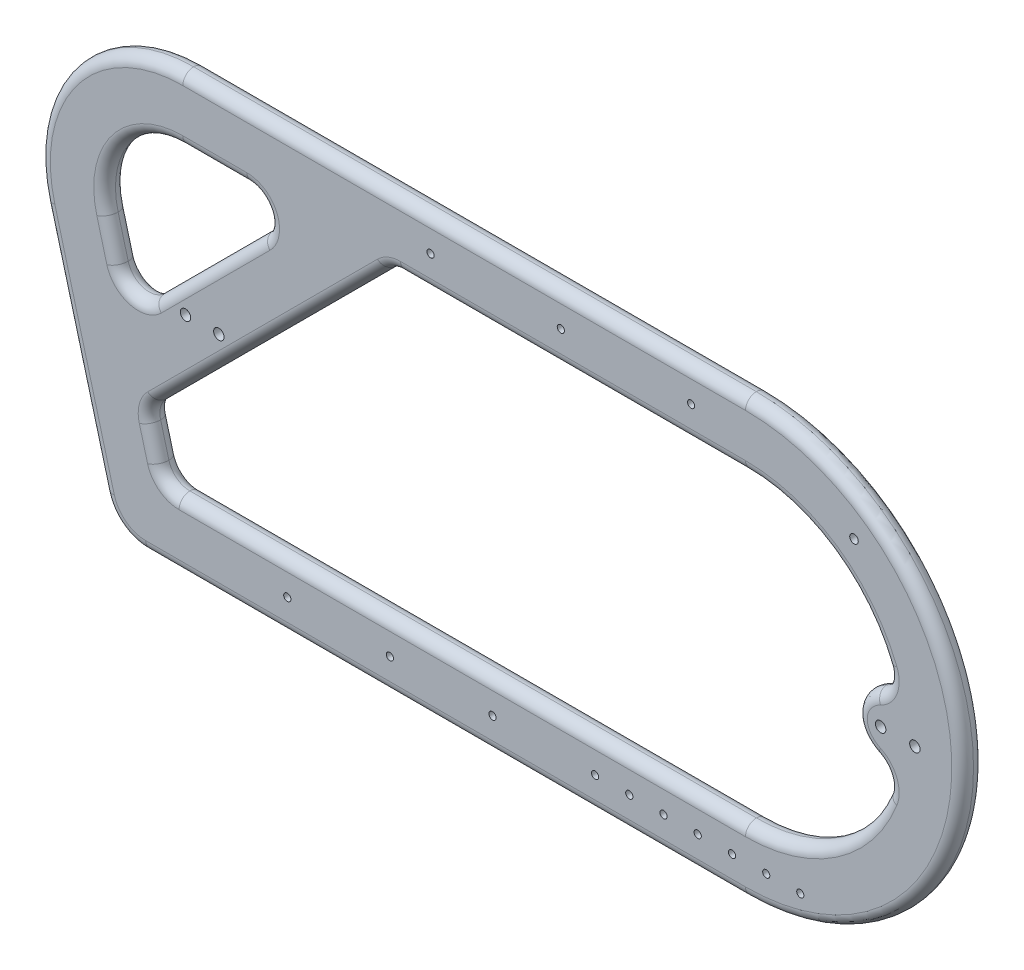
ISO-10303-21;
HEADER;
FILE_DESCRIPTION(('STEP AP214'),'2;1');
FILE_NAME('part.step','',(''),(''),'','','');
FILE_SCHEMA(('AUTOMOTIVE_DESIGN { 1 0 10303 214 1 1 1 1 }'));
ENDSEC;
DATA;
#1=APPLICATION_CONTEXT('core data for automotive mechanical design processes');
#2=APPLICATION_PROTOCOL_DEFINITION('international standard','automotive_design',2000,#1);
#3=PRODUCT_CONTEXT('',#1,'mechanical');
#4=PRODUCT('Part','Part','',(#3));
#5=PRODUCT_RELATED_PRODUCT_CATEGORY('part','',(#4));
#6=PRODUCT_DEFINITION_FORMATION('','',#4);
#7=PRODUCT_DEFINITION_CONTEXT('part definition',#1,'design');
#8=PRODUCT_DEFINITION('design','',#6,#7);
#9=PRODUCT_DEFINITION_SHAPE('','',#8);
#10=(LENGTH_UNIT() NAMED_UNIT(*) SI_UNIT(.MILLI.,.METRE.));
#11=(NAMED_UNIT(*) PLANE_ANGLE_UNIT() SI_UNIT($,.RADIAN.));
#12=(NAMED_UNIT(*) SI_UNIT($,.STERADIAN.) SOLID_ANGLE_UNIT());
#13=UNCERTAINTY_MEASURE_WITH_UNIT(LENGTH_MEASURE(1.E-05),#10,'distance_accuracy_value','');
#14=(GEOMETRIC_REPRESENTATION_CONTEXT(3) GLOBAL_UNCERTAINTY_ASSIGNED_CONTEXT((#13)) GLOBAL_UNIT_ASSIGNED_CONTEXT((#10,
#11,#12)) REPRESENTATION_CONTEXT('',''));
#15=CARTESIAN_POINT('',(0.,0.,0.));
#16=DIRECTION('',(0.,0.,1.));
#17=DIRECTION('',(1.,0.,0.));
#18=AXIS2_PLACEMENT_3D('',#15,#16,#17);
#19=CARTESIAN_POINT('',(0.,0.,12.7));
#20=DIRECTION('',(0.,0.,1.));
#21=DIRECTION('',(1.,0.,0.));
#22=AXIS2_PLACEMENT_3D('',#19,#20,#21);
#23=PLANE('',#22);
#24=CARTESIAN_POINT('',(-107.980126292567,107.95,12.7));
#25=DIRECTION('',(0.,0.,1.));
#26=DIRECTION('',(1.,0.,0.));
#27=AXIS2_PLACEMENT_3D('',#24,#25,#26);
#28=CIRCLE('',#27,2.09999999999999);
#29=CARTESIAN_POINT('',(-105.880126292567,107.95,12.7));
#30=VERTEX_POINT('',#29);
#31=EDGE_CURVE('E1416',#30,#30,#28,.T.);
#32=ORIENTED_EDGE('',*,*,#31,.F.);
#33=EDGE_LOOP('',(#32));
#34=FACE_BOUND('',#33,.T.);
#35=CARTESIAN_POINT('',(-31.7801262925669,107.95,12.7));
#36=DIRECTION('',(0.,0.,1.));
#37=DIRECTION('',(1.,0.,0.));
#38=AXIS2_PLACEMENT_3D('',#35,#36,#37);
#39=CIRCLE('',#38,2.09999999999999);
#40=CARTESIAN_POINT('',(-29.6801262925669,107.95,12.7));
#41=VERTEX_POINT('',#40);
#42=EDGE_CURVE('E1418',#41,#41,#39,.T.);
#43=ORIENTED_EDGE('',*,*,#42,.F.);
#44=EDGE_LOOP('',(#43));
#45=FACE_BOUND('',#44,.T.);
#46=CARTESIAN_POINT('',(-184.180126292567,107.95,12.7));
#47=DIRECTION('',(0.,0.,1.));
#48=DIRECTION('',(1.,0.,0.));
#49=AXIS2_PLACEMENT_3D('',#46,#47,#48);
#50=CIRCLE('',#49,2.09999999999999);
#51=CARTESIAN_POINT('',(-182.080126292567,107.95,12.7));
#52=VERTEX_POINT('',#51);
#53=EDGE_CURVE('E819',#52,#52,#50,.T.);
#54=ORIENTED_EDGE('',*,*,#53,.F.);
#55=EDGE_LOOP('',(#54));
#56=FACE_BOUND('',#55,.T.);
#57=CARTESIAN_POINT('',(-7.85999999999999,-107.95,12.7));
#58=DIRECTION('',(0.,0.,1.));
#59=DIRECTION('',(1.,0.,0.));
#60=AXIS2_PLACEMENT_3D('',#57,#58,#59);
#61=CIRCLE('',#60,2.1);
#62=CARTESIAN_POINT('',(-9.95999999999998,-107.95,12.7));
#63=VERTEX_POINT('',#62);
#64=EDGE_CURVE('E828',#63,#63,#61,.T.);
#65=ORIENTED_EDGE('',*,*,#64,.F.);
#66=EDGE_LOOP('',(#65));
#67=FACE_BOUND('',#66,.T.);
#68=CARTESIAN_POINT('',(-67.94,-107.95,12.7));
#69=DIRECTION('',(0.,0.,-1.));
#70=DIRECTION('',(-1.,0.,0.));
#71=AXIS2_PLACEMENT_3D('',#68,#69,#70);
#72=CIRCLE('',#71,2.1);
#73=CARTESIAN_POINT('',(-70.04,-107.95,12.7));
#74=VERTEX_POINT('',#73);
#75=EDGE_CURVE('E832',#74,#74,#72,.T.);
#76=ORIENTED_EDGE('',*,*,#75,.T.);
#77=EDGE_LOOP('',(#76));
#78=FACE_BOUND('',#77,.T.);
#79=CARTESIAN_POINT('',(-47.94,-107.95,12.7));
#80=DIRECTION('',(0.,0.,-1.));
#81=DIRECTION('',(-1.,0.,0.));
#82=AXIS2_PLACEMENT_3D('',#79,#80,#81);
#83=CIRCLE('',#82,2.1);
#84=CARTESIAN_POINT('',(-50.04,-107.95,12.7));
#85=VERTEX_POINT('',#84);
#86=EDGE_CURVE('E836',#85,#85,#83,.T.);
#87=ORIENTED_EDGE('',*,*,#86,.T.);
#88=EDGE_LOOP('',(#87));
#89=FACE_BOUND('',#88,.T.);
#90=CARTESIAN_POINT('',(63.4514179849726,87.3333845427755,12.7));
#91=DIRECTION('',(0.,0.,1.));
#92=DIRECTION('',(1.,0.,0.));
#93=AXIS2_PLACEMENT_3D('',#90,#91,#92);
#94=CIRCLE('',#93,2.5);
#95=CARTESIAN_POINT('',(65.9514179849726,87.3333845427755,12.7));
#96=VERTEX_POINT('',#95);
#97=EDGE_CURVE('E840',#96,#96,#94,.T.);
#98=ORIENTED_EDGE('',*,*,#97,.F.);
#99=EDGE_LOOP('',(#98));
#100=FACE_BOUND('',#99,.T.);
#101=CARTESIAN_POINT('',(-267.94,-107.95,12.7));
#102=DIRECTION('',(0.,0.,-1.));
#103=DIRECTION('',(-1.,0.,0.));
#104=AXIS2_PLACEMENT_3D('',#101,#102,#103);
#105=CIRCLE('',#104,2.09999999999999);
#106=CARTESIAN_POINT('',(-270.04,-107.95,12.7));
#107=VERTEX_POINT('',#106);
#108=EDGE_CURVE('E844',#107,#107,#105,.T.);
#109=ORIENTED_EDGE('',*,*,#108,.T.);
#110=EDGE_LOOP('',(#109));
#111=FACE_BOUND('',#110,.T.);
#112=CARTESIAN_POINT('',(-207.94,-107.95,12.7));
#113=DIRECTION('',(0.,0.,-1.));
#114=DIRECTION('',(-1.,0.,0.));
#115=AXIS2_PLACEMENT_3D('',#112,#113,#114);
#116=CIRCLE('',#115,2.09999999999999);
#117=CARTESIAN_POINT('',(-210.04,-107.95,12.7));
#118=VERTEX_POINT('',#117);
#119=EDGE_CURVE('E848',#118,#118,#116,.T.);
#120=ORIENTED_EDGE('',*,*,#119,.T.);
#121=EDGE_LOOP('',(#120));
#122=FACE_BOUND('',#121,.T.);
#123=CARTESIAN_POINT('',(-147.94,-107.95,12.7));
#124=DIRECTION('',(0.,0.,-1.));
#125=DIRECTION('',(-1.,0.,0.));
#126=AXIS2_PLACEMENT_3D('',#123,#124,#125);
#127=CIRCLE('',#126,2.09999999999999);
#128=CARTESIAN_POINT('',(-150.04,-107.95,12.7));
#129=VERTEX_POINT('',#128);
#130=EDGE_CURVE('E852',#129,#129,#127,.T.);
#131=ORIENTED_EDGE('',*,*,#130,.T.);
#132=EDGE_LOOP('',(#131));
#133=FACE_BOUND('',#132,.T.);
#134=CARTESIAN_POINT('',(-87.94,-107.95,12.7));
#135=DIRECTION('',(0.,0.,-1.));
#136=DIRECTION('',(-1.,0.,0.));
#137=AXIS2_PLACEMENT_3D('',#134,#135,#136);
#138=CIRCLE('',#137,2.1);
#139=CARTESIAN_POINT('',(-90.04,-107.95,12.7));
#140=VERTEX_POINT('',#139);
#141=EDGE_CURVE('E856',#140,#140,#138,.T.);
#142=ORIENTED_EDGE('',*,*,#141,.T.);
#143=EDGE_LOOP('',(#142));
#144=FACE_BOUND('',#143,.T.);
#145=CARTESIAN_POINT('',(32.06,-107.95,12.7));
#146=DIRECTION('',(0.,0.,-1.));
#147=DIRECTION('',(-1.,0.,0.));
#148=AXIS2_PLACEMENT_3D('',#145,#146,#147);
#149=CIRCLE('',#148,2.1);
#150=CARTESIAN_POINT('',(29.96,-107.95,12.7));
#151=VERTEX_POINT('',#150);
#152=EDGE_CURVE('E860',#151,#151,#149,.T.);
#153=ORIENTED_EDGE('',*,*,#152,.T.);
#154=EDGE_LOOP('',(#153));
#155=FACE_BOUND('',#154,.T.);
#156=CARTESIAN_POINT('',(-27.94,-107.95,12.7));
#157=DIRECTION('',(0.,0.,-1.));
#158=DIRECTION('',(-1.,0.,0.));
#159=AXIS2_PLACEMENT_3D('',#156,#157,#158);
#160=CIRCLE('',#159,2.1);
#161=CARTESIAN_POINT('',(-30.04,-107.95,12.7));
#162=VERTEX_POINT('',#161);
#163=EDGE_CURVE('E864',#162,#162,#160,.T.);
#164=ORIENTED_EDGE('',*,*,#163,.T.);
#165=EDGE_LOOP('',(#164));
#166=FACE_BOUND('',#165,.T.);
#167=CARTESIAN_POINT('',(-327.459563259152,5.29999999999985,12.7));
#168=DIRECTION('',(0.,0.,1.));
#169=DIRECTION('',(1.,0.,0.));
#170=AXIS2_PLACEMENT_3D('',#167,#168,#169);
#171=CIRCLE('',#170,3.05);
#172=CARTESIAN_POINT('',(-324.409563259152,5.29999999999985,12.7));
#173=VERTEX_POINT('',#172);
#174=EDGE_CURVE('E868',#173,#173,#171,.T.);
#175=ORIENTED_EDGE('',*,*,#174,.F.);
#176=EDGE_LOOP('',(#175));
#177=FACE_BOUND('',#176,.T.);
#178=CARTESIAN_POINT('',(79.0404367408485,0.,12.7));
#179=DIRECTION('',(0.,0.,1.));
#180=DIRECTION('',(1.,0.,0.));
#181=AXIS2_PLACEMENT_3D('',#178,#179,#180);
#182=CIRCLE('',#181,3.04999999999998);
#183=CARTESIAN_POINT('',(82.0904367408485,0.,12.7));
#184=VERTEX_POINT('',#183);
#185=EDGE_CURVE('E872',#184,#184,#182,.T.);
#186=ORIENTED_EDGE('',*,*,#185,.F.);
#187=EDGE_LOOP('',(#186));
#188=FACE_BOUND('',#187,.T.);
#189=CARTESIAN_POINT('',(99.0404367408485,0.,12.7));
#190=DIRECTION('',(0.,0.,1.));
#191=DIRECTION('',(1.,0.,0.));
#192=AXIS2_PLACEMENT_3D('',#189,#190,#191);
#193=CIRCLE('',#192,3.04999999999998);
#194=CARTESIAN_POINT('',(102.090436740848,0.,12.7));
#195=VERTEX_POINT('',#194);
#196=EDGE_CURVE('E876',#195,#195,#193,.T.);
#197=ORIENTED_EDGE('',*,*,#196,.F.);
#198=EDGE_LOOP('',(#197));
#199=FACE_BOUND('',#198,.T.);
#200=CARTESIAN_POINT('',(-307.959563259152,5.29999999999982,12.7));
#201=DIRECTION('',(0.,0.,1.));
#202=DIRECTION('',(1.,0.,0.));
#203=AXIS2_PLACEMENT_3D('',#200,#201,#202);
#204=CIRCLE('',#203,3.05);
#205=CARTESIAN_POINT('',(-304.909563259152,5.29999999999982,12.7));
#206=VERTEX_POINT('',#205);
#207=EDGE_CURVE('E307',#206,#206,#204,.T.);
#208=ORIENTED_EDGE('',*,*,#207,.F.);
#209=EDGE_LOOP('',(#208));
#210=FACE_BOUND('',#209,.T.);
#211=CARTESIAN_POINT('',(-329.03609724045,43.18,12.7));
#212=DIRECTION('',(0.,0.,1.));
#213=DIRECTION('',(1.,0.,0.));
#214=AXIS2_PLACEMENT_3D('',#211,#212,#213);
#215=CIRCLE('',#214,52.07);
#216=CARTESIAN_POINT('',(-379.331855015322,29.7032923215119,12.7));
#217=VERTEX_POINT('',#216);
#218=CARTESIAN_POINT('',(-329.03609724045,95.25,12.7));
#219=VERTEX_POINT('',#218);
#220=EDGE_CURVE('E478',#217,#219,#215,.F.);
#221=ORIENTED_EDGE('',*,*,#220,.T.);
#222=DIRECTION('',(-1.,0.,0.));
#223=VECTOR('',#222,1.);
#224=CARTESIAN_POINT('',(0.,95.25,12.7));
#225=LINE('',#224,#223);
#226=CARTESIAN_POINT('',(-291.509880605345,95.25,12.7));
#227=VERTEX_POINT('',#226);
#228=EDGE_CURVE('E11',#219,#227,#225,.F.);
#229=ORIENTED_EDGE('',*,*,#228,.T.);
#230=CARTESIAN_POINT('',(-291.509880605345,76.2,12.7));
#231=DIRECTION('',(0.,0.,1.));
#232=DIRECTION('',(1.,0.,0.));
#233=AXIS2_PLACEMENT_3D('',#230,#231,#232);
#234=CIRCLE('',#233,19.05);
#235=CARTESIAN_POINT('',(-278.039496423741,62.7296158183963,12.7));
#236=VERTEX_POINT('',#235);
#237=EDGE_CURVE('E49',#227,#236,#234,.F.);
#238=ORIENTED_EDGE('',*,*,#237,.T.);
#239=DIRECTION('',(0.707106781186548,0.707106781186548,0.));
#240=VECTOR('',#239,1.);
#241=CARTESIAN_POINT('',(-170.384556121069,170.384556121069,12.7));
#242=LINE('',#241,#240);
#243=CARTESIAN_POINT('',(-341.57415453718,-0.805042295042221,12.7));
#244=VERTEX_POINT('',#243);
#245=EDGE_CURVE('E484',#236,#244,#242,.F.);
#246=ORIENTED_EDGE('',*,*,#245,.T.);
#247=CARTESIAN_POINT('',(-355.044538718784,12.6653418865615,12.7));
#248=DIRECTION('',(0.,0.,1.));
#249=DIRECTION('',(1.,0.,0.));
#250=AXIS2_PLACEMENT_3D('',#247,#248,#249);
#251=CIRCLE('',#250,19.05);
#252=CARTESIAN_POINT('',(-373.44542570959,7.7348390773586,12.7));
#253=VERTEX_POINT('',#252);
#254=EDGE_CURVE('E482',#244,#253,#251,.F.);
#255=ORIENTED_EDGE('',*,*,#254,.T.);
#256=DIRECTION('',(0.258819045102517,-0.96592582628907,0.));
#257=VECTOR('',#256,1.);
#258=CARTESIAN_POINT('',(-346.495615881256,-92.8432204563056,12.7));
#259=LINE('',#258,#257);
#260=EDGE_CURVE('E480',#253,#217,#259,.F.);
#261=ORIENTED_EDGE('',*,*,#260,.T.);
#262=EDGE_LOOP('',(#221,#229,#238,#246,#255,#261));
#263=FACE_BOUND('',#262,.T.);
#264=CARTESIAN_POINT('',(-331.233142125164,-76.2000000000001,12.7));
#265=DIRECTION('',(0.,0.,1.));
#266=DIRECTION('',(1.,0.,0.));
#267=AXIS2_PLACEMENT_3D('',#264,#265,#266);
#268=CIRCLE('',#267,19.05);
#269=CARTESIAN_POINT('',(-331.233142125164,-95.2500000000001,12.7));
#270=VERTEX_POINT('',#269);
#271=CARTESIAN_POINT('',(-349.634029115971,-81.1305028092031,12.7));
#272=VERTEX_POINT('',#271);
#273=EDGE_CURVE('E463',#270,#272,#268,.F.);
#274=ORIENTED_EDGE('',*,*,#273,.T.);
#275=DIRECTION('',(0.258819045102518,-0.965925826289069,0.));
#276=VECTOR('',#275,1.);
#277=CARTESIAN_POINT('',(-346.495615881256,-92.8432204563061,12.7));
#278=LINE('',#277,#276);
#279=CARTESIAN_POINT('',(-354.4679115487,-63.0902079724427,12.7));
#280=VERTEX_POINT('',#279);
#281=EDGE_CURVE('E476',#272,#280,#278,.F.);
#282=ORIENTED_EDGE('',*,*,#281,.T.);
#283=CARTESIAN_POINT('',(-336.067024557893,-58.1597051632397,12.7));
#284=DIRECTION('',(0.,0.,1.));
#285=DIRECTION('',(1.,0.,0.));
#286=AXIS2_PLACEMENT_3D('',#283,#284,#285);
#287=CIRCLE('',#286,19.05);
#288=CARTESIAN_POINT('',(-349.537408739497,-44.689320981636,12.7));
#289=VERTEX_POINT('',#288);
#290=EDGE_CURVE('E474',#280,#289,#287,.F.);
#291=ORIENTED_EDGE('',*,*,#290,.T.);
#292=DIRECTION('',(-0.707106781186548,-0.707106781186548,0.));
#293=VECTOR('',#292,1.);
#294=CARTESIAN_POINT('',(-152.42404387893,152.42404387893,12.7));
#295=LINE('',#294,#293);
#296=CARTESIAN_POINT('',(-215.177703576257,89.6703841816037,12.7));
#297=VERTEX_POINT('',#296);
#298=EDGE_CURVE('E472',#289,#297,#295,.F.);
#299=ORIENTED_EDGE('',*,*,#298,.T.);
#300=CARTESIAN_POINT('',(-201.707319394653,76.2,12.7));
#301=DIRECTION('',(0.,0.,1.));
#302=DIRECTION('',(1.,0.,0.));
#303=AXIS2_PLACEMENT_3D('',#300,#301,#302);
#304=CIRCLE('',#303,19.05);
#305=CARTESIAN_POINT('',(-201.707319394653,95.25,12.7));
#306=VERTEX_POINT('',#305);
#307=EDGE_CURVE('E470',#297,#306,#304,.F.);
#308=ORIENTED_EDGE('',*,*,#307,.T.);
#309=DIRECTION('',(-1.,0.,0.));
#310=VECTOR('',#309,1.);
#311=CARTESIAN_POINT('',(0.,95.25,12.7));
#312=LINE('',#311,#310);
#313=CARTESIAN_POINT('',(0.,95.25,12.7));
#314=VERTEX_POINT('',#313);
#315=EDGE_CURVE('E468',#306,#314,#312,.F.);
#316=ORIENTED_EDGE('',*,*,#315,.T.);
#317=CARTESIAN_POINT('',(0.,0.,12.7));
#318=DIRECTION('',(0.,0.,1.));
#319=DIRECTION('',(1.,0.,0.));
#320=AXIS2_PLACEMENT_3D('',#317,#318,#319);
#321=CIRCLE('',#320,95.25);
#322=CARTESIAN_POINT('',(88.5218235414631,35.1631804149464,12.7));
#323=VERTEX_POINT('',#322);
#324=EDGE_CURVE('E466',#314,#323,#321,.F.);
#325=ORIENTED_EDGE('',*,*,#324,.T.);
#326=CARTESIAN_POINT('',(70.8174588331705,28.1305443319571,12.7));
#327=DIRECTION('',(0.,0.,1.));
#328=DIRECTION('',(1.,0.,0.));
#329=AXIS2_PLACEMENT_3D('',#326,#327,#328);
#330=CIRCLE('',#329,19.05);
#331=CARTESIAN_POINT('',(78.9789138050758,10.9173763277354,12.7));
#332=VERTEX_POINT('',#331);
#333=EDGE_CURVE('E459',#323,#332,#330,.F.);
#334=ORIENTED_EDGE('',*,*,#333,.T.);
#335=CARTESIAN_POINT('',(84.3295159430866,-12.4833859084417,12.7));
#336=CARTESIAN_POINT('',(83.4906462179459,-18.7777323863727,12.7));
#337=CARTESIAN_POINT('',(83.4906462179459,-18.7777323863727,6.35));
#338=CARTESIAN_POINT('',(83.8693085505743,-12.4220413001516,12.7));
#339=CARTESIAN_POINT('',(82.8758110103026,-18.6957238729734,12.7));
#340=CARTESIAN_POINT('',(82.8758110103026,-18.6957238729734,6.35));
#341=CARTESIAN_POINT('',(83.4113041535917,-12.3437499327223,12.7));
#342=CARTESIAN_POINT('',(82.2628925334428,-18.5910393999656,12.7));
#343=CARTESIAN_POINT('',(82.2628925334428,-18.5910393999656,6.35));
#344=CARTESIAN_POINT('',(82.5022226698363,-12.1530564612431,12.7));
#345=CARTESIAN_POINT('',(81.0431917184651,-18.3352176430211,12.7));
#346=CARTESIAN_POINT('',(81.0431917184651,-18.3352176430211,6.35));
#347=CARTESIAN_POINT('',(82.051149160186,-12.0406373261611,12.7));
#348=CARTESIAN_POINT('',(80.4364126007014,-18.1840571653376,12.7));
#349=CARTESIAN_POINT('',(80.4364126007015,-18.1840571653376,6.35));
#350=CARTESIAN_POINT('',(81.1551248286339,-11.7804310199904,12.7));
#351=CARTESIAN_POINT('',(79.2267945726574,-17.8327759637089,12.7));
#352=CARTESIAN_POINT('',(79.2267945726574,-17.8327759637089,6.35));
#353=CARTESIAN_POINT('',(80.7102586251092,-11.6323513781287,12.7));
#354=CARTESIAN_POINT('',(78.6240329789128,-17.6322500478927,12.7));
#355=CARTESIAN_POINT('',(78.6240329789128,-17.6322500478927,6.35));
#356=CARTESIAN_POINT('',(79.8337948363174,-11.3011691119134,12.7));
#357=CARTESIAN_POINT('',(77.4309755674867,-17.1814419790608,12.7));
#358=CARTESIAN_POINT('',(77.4309755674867,-17.1814419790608,6.35));
#359=CARTESIAN_POINT('',(79.402195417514,-11.1180713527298,12.7));
#360=CARTESIAN_POINT('',(76.8406780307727,-16.9311667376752,12.7));
#361=CARTESIAN_POINT('',(76.8406780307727,-16.9311667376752,6.35));
#362=CARTESIAN_POINT('',(78.5546039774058,-10.7161937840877,12.7));
#363=CARTESIAN_POINT('',(75.6747652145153,-16.3783606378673,12.7));
#364=CARTESIAN_POINT('',(75.6747652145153,-16.3783606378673,6.35));
#365=CARTESIAN_POINT('',(78.1386524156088,-10.4973283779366,12.7));
#366=CARTESIAN_POINT('',(75.0991890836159,-16.0757043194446,12.7));
#367=CARTESIAN_POINT('',(75.0991890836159,-16.0757043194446,6.35));
#368=CARTESIAN_POINT('',(77.3272844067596,-10.0241386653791,12.7));
#369=CARTESIAN_POINT('',(73.9686751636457,-15.4163902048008,12.7));
#370=CARTESIAN_POINT('',(73.9686751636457,-15.4163902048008,6.35));
#371=CARTESIAN_POINT('',(76.9318706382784,-9.76980974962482,12.7));
#372=CARTESIAN_POINT('',(73.4137400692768,-15.0597253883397,12.7));
#373=CARTESIAN_POINT('',(73.4137400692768,-15.0597253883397,6.35));
#374=CARTESIAN_POINT('',(76.167337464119,-9.22681110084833,12.7));
#375=CARTESIAN_POINT('',(72.3320685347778,-14.291484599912,12.7));
#376=CARTESIAN_POINT('',(72.3320685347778,-14.291484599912,6.35));
#377=CARTESIAN_POINT('',(75.7981326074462,-8.93826201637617,12.7));
#378=CARTESIAN_POINT('',(71.8052419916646,-13.8801009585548,12.7));
#379=CARTESIAN_POINT('',(71.8052419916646,-13.8801009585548,6.35));
#380=CARTESIAN_POINT('',(75.089522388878,-8.32669186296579,12.7));
#381=CARTESIAN_POINT('',(70.7847790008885,-12.9993872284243,12.7));
#382=CARTESIAN_POINT('',(70.7847790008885,-12.9993872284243,6.35));
#383=CARTESIAN_POINT('',(74.7501050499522,-8.00368476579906,12.7));
#384=CARTESIAN_POINT('',(70.2911292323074,-12.5300806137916,12.7));
#385=CARTESIAN_POINT('',(70.2911292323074,-12.5300806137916,6.35));
#386=CARTESIAN_POINT('',(74.1971522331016,-7.41998167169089,12.7));
#387=CARTESIAN_POINT('',(69.4787465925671,-11.6725099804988,12.7));
#388=CARTESIAN_POINT('',(69.4787465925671,-11.6725099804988,6.35));
#389=CARTESIAN_POINT('',(73.9750754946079,-7.16733777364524,12.7));
#390=CARTESIAN_POINT('',(69.1498898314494,-11.2986165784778,12.7));
#391=CARTESIAN_POINT('',(69.1498898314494,-11.2986165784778,6.35));
#392=CARTESIAN_POINT('',(73.5513395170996,-6.64550120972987,12.7));
#393=CARTESIAN_POINT('',(68.5175688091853,-10.5199065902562,12.7));
#394=CARTESIAN_POINT('',(68.5175688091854,-10.5199065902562,6.35));
#395=CARTESIAN_POINT('',(73.3496753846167,-6.37631253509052,12.7));
#396=CARTESIAN_POINT('',(68.214098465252,-10.1150974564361,12.7));
#397=CARTESIAN_POINT('',(68.214098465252,-10.1150974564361,6.35));
#398=CARTESIAN_POINT('',(72.969058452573,-5.82228023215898,12.7));
#399=CARTESIAN_POINT('',(67.6368304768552,-9.27481373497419,12.7));
#400=CARTESIAN_POINT('',(67.6368304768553,-9.27481373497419,6.35));
#401=CARTESIAN_POINT('',(72.7901065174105,-5.53743600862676,12.7));
#402=CARTESIAN_POINT('',(67.3630339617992,-8.8393379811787,12.7));
#403=CARTESIAN_POINT('',(67.3630339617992,-8.83933798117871,6.35));
#404=CARTESIAN_POINT('',(72.457315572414,-4.9533803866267,12.7));
#405=CARTESIAN_POINT('',(66.8499478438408,-7.93885685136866,12.7));
#406=CARTESIAN_POINT('',(66.8499478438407,-7.93885685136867,6.35));
#407=CARTESIAN_POINT('',(72.3034773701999,-4.65416852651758,12.7));
#408=CARTESIAN_POINT('',(66.6106593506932,-7.47385052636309,12.7));
#409=CARTESIAN_POINT('',(66.6106593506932,-7.4738505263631,6.35));
#410=CARTESIAN_POINT('',(72.022222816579,-4.0407513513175,12.7));
#411=CARTESIAN_POINT('',(66.1700716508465,-6.51292047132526,12.7));
#412=CARTESIAN_POINT('',(66.1700716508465,-6.51292047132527,6.35));
#413=CARTESIAN_POINT('',(71.895017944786,-3.72644872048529,12.7));
#414=CARTESIAN_POINT('',(65.9690775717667,-6.01678714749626,12.7));
#415=CARTESIAN_POINT('',(65.9690775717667,-6.01678714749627,6.35));
#416=CARTESIAN_POINT('',(71.6707910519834,-3.08721407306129,12.7));
#417=CARTESIAN_POINT('',(65.6126384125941,-5.00062571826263,12.7));
#418=CARTESIAN_POINT('',(65.612638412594,-5.00062571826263,6.35));
#419=CARTESIAN_POINT('',(71.5737691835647,-2.76228200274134,12.7));
#420=CARTESIAN_POINT('',(65.4571935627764,-4.48059749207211,12.7));
#421=CARTESIAN_POINT('',(65.4571935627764,-4.48059749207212,6.35));
#422=CARTESIAN_POINT('',(71.4118947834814,-2.1047436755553,12.7));
#423=CARTESIAN_POINT('',(65.1967053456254,-3.42247341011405,12.7));
#424=CARTESIAN_POINT('',(65.1967053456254,-3.42247341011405,6.35));
#425=CARTESIAN_POINT('',(71.3470172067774,-1.77214360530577,12.7));
#426=CARTESIAN_POINT('',(65.0916227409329,-2.88439197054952,12.7));
#427=CARTESIAN_POINT('',(65.0916227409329,-2.88439197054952,6.35));
#428=CARTESIAN_POINT('',(71.2507218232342,-1.10214582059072,12.7));
#429=CARTESIAN_POINT('',(64.9353039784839,-1.79673941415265,12.7));
#430=CARTESIAN_POINT('',(64.9353039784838,-1.79673941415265,6.35));
#431=CARTESIAN_POINT('',(71.219299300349,-0.764748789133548,12.7));
#432=CARTESIAN_POINT('',(64.8840602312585,-1.24716992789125,12.7));
#433=CARTESIAN_POINT('',(64.8840602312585,-1.24716992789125,6.35));
#434=CARTESIAN_POINT('',(71.1924207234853,-0.131503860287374,12.7));
#435=CARTESIAN_POINT('',(64.8402297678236,-0.214628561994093,12.7));
#436=CARTESIAN_POINT('',(64.8402297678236,-0.214628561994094,6.35));
#437=CARTESIAN_POINT('',(71.1929034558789,0.164178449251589,12.7));
#438=CARTESIAN_POINT('',(64.8410196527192,0.267936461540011,12.7));
#439=CARTESIAN_POINT('',(64.8410196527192,0.267936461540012,6.35));
#440=CARTESIAN_POINT('',(71.2198667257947,0.754335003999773,12.7));
#441=CARTESIAN_POINT('',(64.8849823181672,1.23015646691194,12.7));
#442=CARTESIAN_POINT('',(64.8849823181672,1.23015646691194,6.35));
#443=CARTESIAN_POINT('',(71.2463447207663,1.04880936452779,12.7));
#444=CARTESIAN_POINT('',(64.9281509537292,1.70981172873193,12.7));
#445=CARTESIAN_POINT('',(64.9281509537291,1.70981172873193,6.35));
#446=CARTESIAN_POINT('',(71.3248389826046,1.63429521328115,12.7));
#447=CARTESIAN_POINT('',(65.0556532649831,2.66085846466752,12.7));
#448=CARTESIAN_POINT('',(65.0556532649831,2.66085846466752,6.35));
#449=CARTESIAN_POINT('',(71.3768531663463,1.92530698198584,12.7));
#450=CARTESIAN_POINT('',(65.139983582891,3.13225060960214,12.7));
#451=CARTESIAN_POINT('',(65.139983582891,3.13225060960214,6.35));
#452=CARTESIAN_POINT('',(71.5055609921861,2.50181268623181,12.7));
#453=CARTESIAN_POINT('',(65.3475743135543,4.06209478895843,12.7));
#454=CARTESIAN_POINT('',(65.3475743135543,4.06209478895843,6.35));
#455=CARTESIAN_POINT('',(71.5822551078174,2.7873065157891,12.7));
#456=CARTESIAN_POINT('',(65.470835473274,4.52054657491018,12.7));
#457=CARTESIAN_POINT('',(65.470835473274,4.52054657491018,6.35));
#458=CARTESIAN_POINT('',(71.7564946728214,3.34248743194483,12.7));
#459=CARTESIAN_POINT('',(65.7490955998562,5.40717571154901,12.7));
#460=CARTESIAN_POINT('',(65.7490955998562,5.407175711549,6.35));
#461=CARTESIAN_POINT('',(71.8533499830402,3.61239199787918,12.7));
#462=CARTESIAN_POINT('',(65.9030383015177,5.83584819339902,12.7));
#463=CARTESIAN_POINT('',(65.9030383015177,5.83584819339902,6.35));
#464=CARTESIAN_POINT('',(72.0678729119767,4.14376918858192,12.7));
#465=CARTESIAN_POINT('',(66.241664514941,6.67463469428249,12.7));
#466=CARTESIAN_POINT('',(66.241664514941,6.67463469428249,6.35));
#467=CARTESIAN_POINT('',(72.1855398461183,4.40524209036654,12.7));
#468=CARTESIAN_POINT('',(66.426347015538,7.08474932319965,12.7));
#469=CARTESIAN_POINT('',(66.426347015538,7.08474932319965,6.35));
#470=CARTESIAN_POINT('',(72.440276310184,4.9185615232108,12.7));
#471=CARTESIAN_POINT('',(66.823255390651,7.88456230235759,12.7));
#472=CARTESIAN_POINT('',(66.823255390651,7.88456230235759,6.35));
#473=CARTESIAN_POINT('',(72.5773472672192,5.17040734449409,12.7));
#474=CARTESIAN_POINT('',(67.0354832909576,8.27425914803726,12.7));
#475=CARTESIAN_POINT('',(67.0354832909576,8.27425914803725,6.35));
#476=CARTESIAN_POINT('',(72.869450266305,5.66355093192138,12.7));
#477=CARTESIAN_POINT('',(67.4843936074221,9.03213340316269,12.7));
#478=CARTESIAN_POINT('',(67.4843936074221,9.03213340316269,6.35));
#479=CARTESIAN_POINT('',(73.0244889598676,5.90484474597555,12.7));
#480=CARTESIAN_POINT('',(67.7210850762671,9.40030276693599,12.7));
#481=CARTESIAN_POINT('',(67.7210850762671,9.40030276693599,6.35));
#482=CARTESIAN_POINT('',(73.3691088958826,6.40213456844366,12.7));
#483=CARTESIAN_POINT('',(68.2433300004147,10.1539116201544,12.7));
#484=CARTESIAN_POINT('',(68.2433300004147,10.1539116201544,6.35));
#485=CARTESIAN_POINT('',(73.560614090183,6.65679898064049,12.7));
#486=CARTESIAN_POINT('',(68.5313917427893,10.536747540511,12.7));
#487=CARTESIAN_POINT('',(68.5313917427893,10.536747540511,6.35));
#488=CARTESIAN_POINT('',(73.961953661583,7.15130097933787,12.7));
#489=CARTESIAN_POINT('',(69.1303257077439,11.2747036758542,12.7));
#490=CARTESIAN_POINT('',(69.1303257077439,11.2747036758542,6.35));
#491=CARTESIAN_POINT('',(74.1717950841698,7.3911328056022,12.7));
#492=CARTESIAN_POINT('',(69.4412066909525,11.6298131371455,12.7));
#493=CARTESIAN_POINT('',(69.4412066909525,11.6298131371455,6.35));
#494=CARTESIAN_POINT('',(74.8258473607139,8.08729251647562,12.7));
#495=CARTESIAN_POINT('',(70.4029061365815,12.6534653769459,12.7));
#496=CARTESIAN_POINT('',(70.4029061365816,12.6534653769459,6.35));
#497=CARTESIAN_POINT('',(75.2948539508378,8.52066496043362,12.7));
#498=CARTESIAN_POINT('',(71.083188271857,13.2809054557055,12.7));
#499=CARTESIAN_POINT('',(71.083188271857,13.2809054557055,6.35));
#500=CARTESIAN_POINT('',(76.2778610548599,9.31737894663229,12.7));
#501=CARTESIAN_POINT('',(72.4904393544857,14.4214485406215,12.7));
#502=CARTESIAN_POINT('',(72.4904393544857,14.4214485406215,6.35));
#503=CARTESIAN_POINT('',(76.7911746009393,9.68158091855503,12.7));
#504=CARTESIAN_POINT('',(73.2166607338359,14.9359707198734,12.7));
#505=CARTESIAN_POINT('',(73.2166607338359,14.9359707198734,6.35));
#506=CARTESIAN_POINT('',(77.8576682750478,10.3469384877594,12.7));
#507=CARTESIAN_POINT('',(74.7099543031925,15.8675963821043,12.7));
#508=CARTESIAN_POINT('',(74.7099543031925,15.8675963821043,6.35));
#509=CARTESIAN_POINT('',(78.4108803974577,10.6480427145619,12.7));
#510=CARTESIAN_POINT('',(75.4770591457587,16.2846205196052,12.7));
#511=CARTESIAN_POINT('',(75.4770591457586,16.2846205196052,6.35));
#512=CARTESIAN_POINT('',(79.400642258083,11.1173392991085,12.7));
#513=CARTESIAN_POINT('',(76.8385457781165,16.9301555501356,12.7));
#514=CARTESIAN_POINT('',(76.8385457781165,16.9301555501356,6.35));
#515=CARTESIAN_POINT('',(79.8305403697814,11.2997899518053,12.7));
#516=CARTESIAN_POINT('',(77.4265256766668,17.1795556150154,12.7));
#517=CARTESIAN_POINT('',(77.4265256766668,17.1795556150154,6.35));
#518=CARTESIAN_POINT('',(80.7036930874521,11.6300182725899,12.7));
#519=CARTESIAN_POINT('',(78.6151154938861,17.6290831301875,12.7));
#520=CARTESIAN_POINT('',(78.6151154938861,17.6290831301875,6.35));
#521=CARTESIAN_POINT('',(81.1469535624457,11.7777804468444,12.7));
#522=CARTESIAN_POINT('',(79.2157309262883,17.8291885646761,12.7));
#523=CARTESIAN_POINT('',(79.2157309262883,17.8291885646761,6.35));
#524=CARTESIAN_POINT('',(82.0429720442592,12.0385340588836,12.7));
#525=CARTESIAN_POINT('',(80.4254054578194,18.1812267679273,12.7));
#526=CARTESIAN_POINT('',(80.4254054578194,18.1812267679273,6.35));
#527=CARTESIAN_POINT('',(82.4957182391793,12.1515662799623,12.7));
#528=CARTESIAN_POINT('',(81.0344537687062,18.3332160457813,12.7));
#529=CARTESIAN_POINT('',(81.0344537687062,18.3332160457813,6.35));
#530=CARTESIAN_POINT('',(83.4080779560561,12.3431974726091,12.7));
#531=CARTESIAN_POINT('',(82.2585749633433,18.5903004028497,12.7));
#532=CARTESIAN_POINT('',(82.2585749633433,18.5903004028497,6.35));
#533=CARTESIAN_POINT('',(83.8676858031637,12.421823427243,12.7));
#534=CARTESIAN_POINT('',(82.8736427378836,18.6954322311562,12.7));
#535=CARTESIAN_POINT('',(82.8736427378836,18.6954322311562,6.35));
#536=CARTESIAN_POINT('',(84.3295159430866,12.4833859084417,12.7));
#537=CARTESIAN_POINT('',(83.4906463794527,18.7777324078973,12.7));
#538=CARTESIAN_POINT('',(83.4906463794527,18.7777324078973,6.35));
#539=(BOUNDED_SURFACE() B_SPLINE_SURFACE(3,2,((#335,#336,#337),(#338,#339,#340),(#341,#342,
#343),(#344,#345,#346),(#347,#348,#349),(#350,#351,#352),(#353,#354,#355),(#356,#357,#358),
(#359,#360,#361),(#362,#363,#364),(#365,#366,#367),(#368,#369,#370),(#371,#372,#373),(#374,#375,
#376),(#377,#378,#379),(#380,#381,#382),(#383,#384,#385),(#386,#387,#388),(#389,#390,#391),
(#392,#393,#394),(#395,#396,#397),(#398,#399,#400),(#401,#402,#403),(#404,#405,#406),(#407,#408,
#409),(#410,#411,#412),(#413,#414,#415),(#416,#417,#418),(#419,#420,#421),(#422,#423,#424),
(#425,#426,#427),(#428,#429,#430),(#431,#432,#433),(#434,#435,#436),(#437,#438,#439),(#440,#441,
#442),(#443,#444,#445),(#446,#447,#448),(#449,#450,#451),(#452,#453,#454),(#455,#456,#457),
(#458,#459,#460),(#461,#462,#463),(#464,#465,#466),(#467,#468,#469),(#470,#471,#472),(#473,#474,
#475),(#476,#477,#478),(#479,#480,#481),(#482,#483,#484),(#485,#486,#487),(#488,#489,#490),
(#491,#492,#493),(#494,#495,#496),(#497,#498,#499),(#500,#501,#502),(#503,#504,#505),(#506,#507,
#508),(#509,#510,#511),(#512,#513,#514),(#515,#516,#517),(#518,#519,#520),(#521,#522,#523),
(#524,#525,#526),(#527,#528,#529),(#530,#531,#532),(#533,#534,#535),(#536,#537,#538)),
.UNSPECIFIED.,.F.,.F.,.F.) B_SPLINE_SURFACE_WITH_KNOTS((4,2,2,2,2,2,2,2,2,2,2,2,2,2,2,2,2,2,2,2,
2,2,2,2,2,2,2,2,2,2,2,2,2,4),(3,3),(0.,1.3926030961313,2.78590229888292,4.19104307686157,
5.59598877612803,7.00434730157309,8.41288904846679,9.8166046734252,11.2197532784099,
12.2279523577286,13.2359091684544,14.2439043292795,15.251931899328,16.2676831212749,
17.2834394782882,18.2984031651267,19.3132237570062,20.1991517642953,21.0849931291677,
21.9707622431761,22.8565483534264,23.7159149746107,24.5752533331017,25.4346549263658,
26.294375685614,27.2493162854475,28.2046254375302,30.1138613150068,31.997518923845,
33.8827041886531,35.2823336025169,36.6825869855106,38.0811897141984,39.4786936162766),(0.,1.),
.UNSPECIFIED.) GEOMETRIC_REPRESENTATION_ITEM() RATIONAL_B_SPLINE_SURFACE(((1.,0.707106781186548,
1.),(1.,0.707106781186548,1.),(1.,0.707106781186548,1.),(1.,0.707106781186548,1.),(1.,
0.707106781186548,1.),(1.,0.707106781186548,1.),(1.,0.707106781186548,1.),(1.,0.707106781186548,
1.),(1.,0.707106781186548,1.),(1.,0.707106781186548,1.),(1.,0.707106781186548,1.),(1.,
0.707106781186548,1.),(1.,0.707106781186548,1.),(1.,0.707106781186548,1.),(1.,0.707106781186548,
1.),(1.,0.707106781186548,1.),(1.,0.707106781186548,1.),(1.,0.707106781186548,1.),(1.,
0.707106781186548,1.),(1.,0.707106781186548,1.),(1.,0.707106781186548,1.),(1.,0.707106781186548,
1.),(1.,0.707106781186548,1.),(1.,0.707106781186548,1.),(1.,0.707106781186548,1.),(1.,
0.707106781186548,1.),(1.,0.707106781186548,1.),(1.,0.707106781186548,1.),(1.,0.707106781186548,
1.),(1.,0.707106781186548,1.),(1.,0.707106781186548,1.),(1.,0.707106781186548,1.),(1.,
0.707106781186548,1.),(1.,0.707106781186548,1.),(1.,0.707106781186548,1.),(1.,0.707106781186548,
1.),(1.,0.707106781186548,1.),(1.,0.707106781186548,1.),(1.,0.707106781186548,1.),(1.,
0.707106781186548,1.),(1.,0.707106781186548,1.),(1.,0.707106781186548,1.),(1.,0.707106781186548,
1.),(1.,0.707106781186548,1.),(1.,0.707106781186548,1.),(1.,0.707106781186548,1.),(1.,
0.707106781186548,1.),(1.,0.707106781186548,1.),(1.,0.707106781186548,1.),(1.,0.707106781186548,
1.),(1.,0.707106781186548,1.),(1.,0.707106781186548,1.),(1.,0.707106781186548,1.),(1.,
0.707106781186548,1.),(1.,0.707106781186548,1.),(1.,0.707106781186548,1.),(1.,0.707106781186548,
1.),(1.,0.707106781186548,1.),(1.,0.707106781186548,1.),(1.,0.707106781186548,1.),(1.,
0.707106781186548,1.),(1.,0.707106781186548,1.),(1.,0.707106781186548,1.),(1.,0.707106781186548,
1.),(1.,0.707106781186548,1.),(1.,0.707106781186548,1.),(1.,0.707106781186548,1.),(1.,
0.707106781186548,1.))) REPRESENTATION_ITEM('') SURFACE());
#540=CARTESIAN_POINT('',(84.3295159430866,12.4833859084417,12.7));
#541=CARTESIAN_POINT('',(83.8676858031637,12.421823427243,12.7));
#542=CARTESIAN_POINT('',(83.4080779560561,12.3431974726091,12.7));
#543=CARTESIAN_POINT('',(82.4957182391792,12.1515662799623,12.7));
#544=CARTESIAN_POINT('',(82.0429720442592,12.0385340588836,12.7));
#545=CARTESIAN_POINT('',(81.1469535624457,11.7777804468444,12.7));
#546=CARTESIAN_POINT('',(80.7036930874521,11.6300182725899,12.7));
#547=CARTESIAN_POINT('',(79.8305403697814,11.2997899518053,12.7));
#548=CARTESIAN_POINT('',(79.400642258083,11.1173392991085,12.7));
#549=CARTESIAN_POINT('',(78.4108803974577,10.6480427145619,12.7));
#550=CARTESIAN_POINT('',(77.8576682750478,10.3469384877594,12.7));
#551=CARTESIAN_POINT('',(76.7911746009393,9.68158091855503,12.7));
#552=CARTESIAN_POINT('',(76.2778610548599,9.31737894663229,12.7));
#553=CARTESIAN_POINT('',(75.2948539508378,8.52066496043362,12.7));
#554=CARTESIAN_POINT('',(74.8258473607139,8.08729251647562,12.7));
#555=CARTESIAN_POINT('',(74.1717950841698,7.3911328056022,12.7));
#556=CARTESIAN_POINT('',(73.961953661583,7.15130097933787,12.7));
#557=CARTESIAN_POINT('',(73.560614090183,6.65679898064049,12.7));
#558=CARTESIAN_POINT('',(73.3691088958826,6.40213456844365,12.7));
#559=CARTESIAN_POINT('',(73.0244889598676,5.90484474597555,12.7));
#560=CARTESIAN_POINT('',(72.869450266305,5.66355093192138,12.7));
#561=CARTESIAN_POINT('',(72.5773472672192,5.17040734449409,12.7));
#562=CARTESIAN_POINT('',(72.440276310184,4.9185615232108,12.7));
#563=CARTESIAN_POINT('',(72.1855398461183,4.40524209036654,12.7));
#564=CARTESIAN_POINT('',(72.0678729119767,4.14376918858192,12.7));
#565=CARTESIAN_POINT('',(71.8533499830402,3.61239199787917,12.7));
#566=CARTESIAN_POINT('',(71.7564946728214,3.34248743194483,12.7));
#567=CARTESIAN_POINT('',(71.5822551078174,2.7873065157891,12.7));
#568=CARTESIAN_POINT('',(71.5055609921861,2.50181268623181,12.7));
#569=CARTESIAN_POINT('',(71.3768531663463,1.92530698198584,12.7));
#570=CARTESIAN_POINT('',(71.3248389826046,1.63429521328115,12.7));
#571=CARTESIAN_POINT('',(71.2463447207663,1.04880936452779,12.7));
#572=CARTESIAN_POINT('',(71.2198667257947,0.754335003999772,12.7));
#573=CARTESIAN_POINT('',(71.1929034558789,0.164178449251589,12.7));
#574=CARTESIAN_POINT('',(71.1924207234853,-0.131503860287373,12.7));
#575=CARTESIAN_POINT('',(71.2192993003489,-0.764748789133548,12.7));
#576=CARTESIAN_POINT('',(71.2507218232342,-1.10214582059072,12.7));
#577=CARTESIAN_POINT('',(71.3470172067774,-1.77214360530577,12.7));
#578=CARTESIAN_POINT('',(71.4118947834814,-2.1047436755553,12.7));
#579=CARTESIAN_POINT('',(71.5737691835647,-2.76228200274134,12.7));
#580=CARTESIAN_POINT('',(71.6707910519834,-3.08721407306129,12.7));
#581=CARTESIAN_POINT('',(71.895017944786,-3.72644872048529,12.7));
#582=CARTESIAN_POINT('',(72.022222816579,-4.04075135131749,12.7));
#583=CARTESIAN_POINT('',(72.3034773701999,-4.65416852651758,12.7));
#584=CARTESIAN_POINT('',(72.457315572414,-4.9533803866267,12.7));
#585=CARTESIAN_POINT('',(72.7901065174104,-5.53743600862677,12.7));
#586=CARTESIAN_POINT('',(72.969058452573,-5.82228023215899,12.7));
#587=CARTESIAN_POINT('',(73.3496753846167,-6.37631253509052,12.7));
#588=CARTESIAN_POINT('',(73.5513395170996,-6.64550120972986,12.7));
#589=CARTESIAN_POINT('',(73.9750754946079,-7.16733777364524,12.7));
#590=CARTESIAN_POINT('',(74.1971522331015,-7.41998167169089,12.7));
#591=CARTESIAN_POINT('',(74.7501050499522,-8.00368476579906,12.7));
#592=CARTESIAN_POINT('',(75.089522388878,-8.3266918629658,12.7));
#593=CARTESIAN_POINT('',(75.7981326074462,-8.93826201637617,12.7));
#594=CARTESIAN_POINT('',(76.167337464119,-9.22681110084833,12.7));
#595=CARTESIAN_POINT('',(76.9318706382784,-9.76980974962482,12.7));
#596=CARTESIAN_POINT('',(77.3272844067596,-10.0241386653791,12.7));
#597=CARTESIAN_POINT('',(78.1386524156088,-10.4973283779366,12.7));
#598=CARTESIAN_POINT('',(78.5546039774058,-10.7161937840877,12.7));
#599=CARTESIAN_POINT('',(79.402195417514,-11.1180713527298,12.7));
#600=CARTESIAN_POINT('',(79.8337948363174,-11.3011691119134,12.7));
#601=CARTESIAN_POINT('',(80.7102586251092,-11.6323513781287,12.7));
#602=CARTESIAN_POINT('',(81.1551248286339,-11.7804310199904,12.7));
#603=CARTESIAN_POINT('',(82.051149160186,-12.0406373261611,12.7));
#604=CARTESIAN_POINT('',(82.5022226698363,-12.1530564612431,12.7));
#605=CARTESIAN_POINT('',(83.4113041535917,-12.3437499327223,12.7));
#606=CARTESIAN_POINT('',(83.8693085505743,-12.4220413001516,12.7));
#607=CARTESIAN_POINT('',(84.3295159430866,-12.4833859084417,12.7));
#608=B_SPLINE_CURVE_WITH_KNOTS('',3,(#540,#541,#542,#543,#544,#545,#546,#547,#548,#549,#550,
#551,#552,#553,#554,#555,#556,#557,#558,#559,#560,#561,#562,#563,#564,#565,#566,#567,#568,#569,
#570,#571,#572,#573,#574,#575,#576,#577,#578,#579,#580,#581,#582,#583,#584,#585,#586,#587,#588,
#589,#590,#591,#592,#593,#594,#595,#596,#597,#598,#599,#600,#601,#602,#603,#604,#605,#606,#607),
.UNSPECIFIED.,.F.,.F.,(4,2,2,2,2,2,2,2,2,2,2,2,2,2,2,2,2,2,2,2,2,2,2,2,2,2,2,2,2,2,2,2,2,4),(0.,
1.39750390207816,2.796106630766,4.1963600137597,5.5959894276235,7.48117469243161,
9.36483230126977,11.2740681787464,12.229377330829,13.1843179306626,14.0440386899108,
14.9034402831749,15.7627786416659,16.6221452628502,17.5079313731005,18.3937004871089,
19.2795418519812,20.1654698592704,21.1802904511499,22.1952541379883,23.2110104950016,
24.2267617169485,25.2347892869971,26.2427844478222,27.250741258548,28.2589403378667,
29.6620889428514,31.0658045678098,32.4743463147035,33.8827048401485,35.287650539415,
36.6927913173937,38.0860905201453,39.4786936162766),.UNSPECIFIED.);
#609=CARTESIAN_POINT('',(78.9789138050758,-10.9173763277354,12.7));
#610=VERTEX_POINT('',#609);
#611=EDGE_CURVE('E453',#332,#610,#608,.T.);
#612=ORIENTED_EDGE('',*,*,#611,.T.);
#613=CARTESIAN_POINT('',(70.8174588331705,-28.1305443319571,12.7));
#614=DIRECTION('',(0.,0.,1.));
#615=DIRECTION('',(1.,0.,0.));
#616=AXIS2_PLACEMENT_3D('',#613,#614,#615);
#617=CIRCLE('',#616,19.05);
#618=CARTESIAN_POINT('',(88.5218235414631,-35.1631804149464,12.7));
#619=VERTEX_POINT('',#618);
#620=EDGE_CURVE('E460',#610,#619,#617,.F.);
#621=ORIENTED_EDGE('',*,*,#620,.T.);
#622=CARTESIAN_POINT('',(0.,0.,12.7));
#623=DIRECTION('',(0.,0.,1.));
#624=DIRECTION('',(1.,0.,0.));
#625=AXIS2_PLACEMENT_3D('',#622,#623,#624);
#626=CIRCLE('',#625,95.25);
#627=CARTESIAN_POINT('',(0.,-95.25,12.7));
#628=VERTEX_POINT('',#627);
#629=EDGE_CURVE('E574',#619,#628,#626,.F.);
#630=ORIENTED_EDGE('',*,*,#629,.T.);
#631=DIRECTION('',(1.,0.,0.));
#632=VECTOR('',#631,1.);
#633=CARTESIAN_POINT('',(0.,-95.25,12.7));
#634=LINE('',#633,#632);
#635=EDGE_CURVE('E573',#628,#270,#634,.F.);
#636=ORIENTED_EDGE('',*,*,#635,.T.);
#637=EDGE_LOOP('',(#274,#282,#291,#299,#308,#316,#325,#334,#612,#621,#630,#636));
#638=FACE_BOUND('',#637,.T.);
#639=DIRECTION('',(1.,0.,0.));
#640=VECTOR('',#639,1.);
#641=CARTESIAN_POINT('',(0.,-120.65,12.7));
#642=LINE('',#641,#640);
#643=CARTESIAN_POINT('',(-350.72324761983,-120.65,12.7));
#644=VERTEX_POINT('',#643);
#645=CARTESIAN_POINT('',(0.,-120.65,12.7));
#646=VERTEX_POINT('',#645);
#647=EDGE_CURVE('E561',#644,#646,#642,.T.);
#648=ORIENTED_EDGE('',*,*,#647,.T.);
#649=CARTESIAN_POINT('',(0.,0.,12.7));
#650=DIRECTION('',(0.,0.,1.));
#651=DIRECTION('',(1.,0.,0.));
#652=AXIS2_PLACEMENT_3D('',#649,#650,#651);
#653=CIRCLE('',#652,120.65);
#654=CARTESIAN_POINT('',(0.,120.65,12.7));
#655=VERTEX_POINT('',#654);
#656=EDGE_CURVE('E570',#646,#655,#653,.T.);
#657=ORIENTED_EDGE('',*,*,#656,.T.);
#658=DIRECTION('',(-1.,0.,0.));
#659=VECTOR('',#658,1.);
#660=CARTESIAN_POINT('',(-329.03609724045,120.65,12.7));
#661=LINE('',#660,#659);
#662=CARTESIAN_POINT('',(-329.03609724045,120.65,12.7));
#663=VERTEX_POINT('',#662);
#664=EDGE_CURVE('E568',#655,#663,#661,.T.);
#665=ORIENTED_EDGE('',*,*,#664,.T.);
#666=CARTESIAN_POINT('',(-329.03609724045,43.18,12.7));
#667=DIRECTION('',(0.,0.,1.));
#668=DIRECTION('',(1.,0.,0.));
#669=AXIS2_PLACEMENT_3D('',#666,#667,#668);
#670=CIRCLE('',#669,77.47);
#671=CARTESIAN_POINT('',(-403.866371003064,23.1292885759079,12.7));
#672=VERTEX_POINT('',#671);
#673=EDGE_CURVE('E280',#663,#672,#670,.T.);
#674=ORIENTED_EDGE('',*,*,#673,.T.);
#675=DIRECTION('',(0.258819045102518,-0.965925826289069,0.));
#676=VECTOR('',#675,1.);
#677=CARTESIAN_POINT('',(-369.124134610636,-106.530502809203,12.7));
#678=LINE('',#677,#676);
#679=CARTESIAN_POINT('',(-369.124134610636,-106.530502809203,12.7));
#680=VERTEX_POINT('',#679);
#681=EDGE_CURVE('E565',#672,#680,#678,.T.);
#682=ORIENTED_EDGE('',*,*,#681,.T.);
#683=CARTESIAN_POINT('',(-350.72324761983,-101.6,12.7));
#684=DIRECTION('',(0.,0.,1.));
#685=DIRECTION('',(1.,0.,0.));
#686=AXIS2_PLACEMENT_3D('',#683,#684,#685);
#687=CIRCLE('',#686,19.0499999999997);
#688=EDGE_CURVE('E563',#680,#644,#687,.T.);
#689=ORIENTED_EDGE('',*,*,#688,.T.);
#690=EDGE_LOOP('',(#648,#657,#665,#674,#682,#689));
#691=FACE_BOUND('',#690,.T.);
#692=CARTESIAN_POINT('',(12.14,-107.95,12.7));
#693=DIRECTION('',(0.,0.,1.));
#694=DIRECTION('',(1.,0.,0.));
#695=AXIS2_PLACEMENT_3D('',#692,#693,#694);
#696=CIRCLE('',#695,2.1);
#697=CARTESIAN_POINT('',(10.04,-107.95,12.7));
#698=VERTEX_POINT('',#697);
#699=EDGE_CURVE('E818',#698,#698,#696,.T.);
#700=ORIENTED_EDGE('',*,*,#699,.F.);
#701=EDGE_LOOP('',(#700));
#702=FACE_BOUND('',#701,.T.);
#703=ADVANCED_FACE('F40',(#34,#45,#56,#67,#78,#89,#100,#111,#122,#133,#144,#155,#166,#177,#188,
#199,#210,#263,#638,#691,#702),#23,.T.);
#704=CARTESIAN_POINT('',(0.,0.,0.));
#705=DIRECTION('',(0.,0.,1.));
#706=DIRECTION('',(1.,0.,0.));
#707=AXIS2_PLACEMENT_3D('',#704,#705,#706);
#708=PLANE('',#707);
#709=CARTESIAN_POINT('',(-107.980126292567,107.95,0.));
#710=DIRECTION('',(0.,0.,1.));
#711=DIRECTION('',(1.,0.,0.));
#712=AXIS2_PLACEMENT_3D('',#709,#710,#711);
#713=CIRCLE('',#712,2.09999999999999);
#714=CARTESIAN_POINT('',(-105.880126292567,107.95,0.));
#715=VERTEX_POINT('',#714);
#716=EDGE_CURVE('E746',#715,#715,#713,.T.);
#717=ORIENTED_EDGE('',*,*,#716,.T.);
#718=EDGE_LOOP('',(#717));
#719=FACE_BOUND('',#718,.T.);
#720=CARTESIAN_POINT('',(-31.7801262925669,107.95,0.));
#721=DIRECTION('',(0.,0.,1.));
#722=DIRECTION('',(1.,0.,0.));
#723=AXIS2_PLACEMENT_3D('',#720,#721,#722);
#724=CIRCLE('',#723,2.1);
#725=CARTESIAN_POINT('',(-29.6801262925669,107.95,0.));
#726=VERTEX_POINT('',#725);
#727=EDGE_CURVE('E750',#726,#726,#724,.T.);
#728=ORIENTED_EDGE('',*,*,#727,.T.);
#729=EDGE_LOOP('',(#728));
#730=FACE_BOUND('',#729,.T.);
#731=CARTESIAN_POINT('',(-184.180126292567,107.95,0.));
#732=DIRECTION('',(0.,0.,1.));
#733=DIRECTION('',(1.,0.,0.));
#734=AXIS2_PLACEMENT_3D('',#731,#732,#733);
#735=CIRCLE('',#734,2.09999999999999);
#736=CARTESIAN_POINT('',(-182.080126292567,107.95,0.));
#737=VERTEX_POINT('',#736);
#738=EDGE_CURVE('E754',#737,#737,#735,.T.);
#739=ORIENTED_EDGE('',*,*,#738,.T.);
#740=EDGE_LOOP('',(#739));
#741=FACE_BOUND('',#740,.T.);
#742=CARTESIAN_POINT('',(-7.85999999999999,-107.95,0.));
#743=DIRECTION('',(0.,0.,1.));
#744=DIRECTION('',(1.,0.,0.));
#745=AXIS2_PLACEMENT_3D('',#742,#743,#744);
#746=CIRCLE('',#745,2.1);
#747=CARTESIAN_POINT('',(-9.95999999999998,-107.95,0.));
#748=VERTEX_POINT('',#747);
#749=EDGE_CURVE('E758',#748,#748,#746,.T.);
#750=ORIENTED_EDGE('',*,*,#749,.T.);
#751=EDGE_LOOP('',(#750));
#752=FACE_BOUND('',#751,.T.);
#753=CARTESIAN_POINT('',(-67.94,-107.95,0.));
#754=DIRECTION('',(0.,0.,-1.));
#755=DIRECTION('',(-1.,0.,0.));
#756=AXIS2_PLACEMENT_3D('',#753,#754,#755);
#757=CIRCLE('',#756,2.1);
#758=CARTESIAN_POINT('',(-70.04,-107.95,0.));
#759=VERTEX_POINT('',#758);
#760=EDGE_CURVE('E762',#759,#759,#757,.T.);
#761=ORIENTED_EDGE('',*,*,#760,.F.);
#762=EDGE_LOOP('',(#761));
#763=FACE_BOUND('',#762,.T.);
#764=CARTESIAN_POINT('',(-47.94,-107.95,0.));
#765=DIRECTION('',(0.,0.,-1.));
#766=DIRECTION('',(-1.,0.,0.));
#767=AXIS2_PLACEMENT_3D('',#764,#765,#766);
#768=CIRCLE('',#767,2.1);
#769=CARTESIAN_POINT('',(-50.04,-107.95,0.));
#770=VERTEX_POINT('',#769);
#771=EDGE_CURVE('E766',#770,#770,#768,.T.);
#772=ORIENTED_EDGE('',*,*,#771,.F.);
#773=EDGE_LOOP('',(#772));
#774=FACE_BOUND('',#773,.T.);
#775=CARTESIAN_POINT('',(63.4514179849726,87.3333845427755,0.));
#776=DIRECTION('',(0.,0.,1.));
#777=DIRECTION('',(1.,0.,0.));
#778=AXIS2_PLACEMENT_3D('',#775,#776,#777);
#779=CIRCLE('',#778,2.5);
#780=CARTESIAN_POINT('',(65.9514179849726,87.3333845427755,0.));
#781=VERTEX_POINT('',#780);
#782=EDGE_CURVE('E770',#781,#781,#779,.T.);
#783=ORIENTED_EDGE('',*,*,#782,.T.);
#784=EDGE_LOOP('',(#783));
#785=FACE_BOUND('',#784,.T.);
#786=CARTESIAN_POINT('',(-267.94,-107.95,0.));
#787=DIRECTION('',(0.,0.,-1.));
#788=DIRECTION('',(-1.,0.,0.));
#789=AXIS2_PLACEMENT_3D('',#786,#787,#788);
#790=CIRCLE('',#789,2.09999999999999);
#791=CARTESIAN_POINT('',(-270.04,-107.95,0.));
#792=VERTEX_POINT('',#791);
#793=EDGE_CURVE('E774',#792,#792,#790,.T.);
#794=ORIENTED_EDGE('',*,*,#793,.F.);
#795=EDGE_LOOP('',(#794));
#796=FACE_BOUND('',#795,.T.);
#797=CARTESIAN_POINT('',(-207.94,-107.95,0.));
#798=DIRECTION('',(0.,0.,-1.));
#799=DIRECTION('',(-1.,0.,0.));
#800=AXIS2_PLACEMENT_3D('',#797,#798,#799);
#801=CIRCLE('',#800,2.09999999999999);
#802=CARTESIAN_POINT('',(-210.04,-107.95,0.));
#803=VERTEX_POINT('',#802);
#804=EDGE_CURVE('E778',#803,#803,#801,.T.);
#805=ORIENTED_EDGE('',*,*,#804,.F.);
#806=EDGE_LOOP('',(#805));
#807=FACE_BOUND('',#806,.T.);
#808=CARTESIAN_POINT('',(-147.94,-107.95,0.));
#809=DIRECTION('',(0.,0.,-1.));
#810=DIRECTION('',(-1.,0.,0.));
#811=AXIS2_PLACEMENT_3D('',#808,#809,#810);
#812=CIRCLE('',#811,2.09999999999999);
#813=CARTESIAN_POINT('',(-150.04,-107.95,0.));
#814=VERTEX_POINT('',#813);
#815=EDGE_CURVE('E782',#814,#814,#812,.T.);
#816=ORIENTED_EDGE('',*,*,#815,.F.);
#817=EDGE_LOOP('',(#816));
#818=FACE_BOUND('',#817,.T.);
#819=CARTESIAN_POINT('',(-87.94,-107.95,0.));
#820=DIRECTION('',(0.,0.,-1.));
#821=DIRECTION('',(-1.,0.,0.));
#822=AXIS2_PLACEMENT_3D('',#819,#820,#821);
#823=CIRCLE('',#822,2.1);
#824=CARTESIAN_POINT('',(-90.04,-107.95,0.));
#825=VERTEX_POINT('',#824);
#826=EDGE_CURVE('E786',#825,#825,#823,.T.);
#827=ORIENTED_EDGE('',*,*,#826,.F.);
#828=EDGE_LOOP('',(#827));
#829=FACE_BOUND('',#828,.T.);
#830=CARTESIAN_POINT('',(32.06,-107.95,0.));
#831=DIRECTION('',(0.,0.,-1.));
#832=DIRECTION('',(-1.,0.,0.));
#833=AXIS2_PLACEMENT_3D('',#830,#831,#832);
#834=CIRCLE('',#833,2.1);
#835=CARTESIAN_POINT('',(29.96,-107.95,0.));
#836=VERTEX_POINT('',#835);
#837=EDGE_CURVE('E790',#836,#836,#834,.T.);
#838=ORIENTED_EDGE('',*,*,#837,.F.);
#839=EDGE_LOOP('',(#838));
#840=FACE_BOUND('',#839,.T.);
#841=CARTESIAN_POINT('',(-27.94,-107.95,0.));
#842=DIRECTION('',(0.,0.,-1.));
#843=DIRECTION('',(-1.,0.,0.));
#844=AXIS2_PLACEMENT_3D('',#841,#842,#843);
#845=CIRCLE('',#844,2.1);
#846=CARTESIAN_POINT('',(-30.04,-107.95,0.));
#847=VERTEX_POINT('',#846);
#848=EDGE_CURVE('E794',#847,#847,#845,.T.);
#849=ORIENTED_EDGE('',*,*,#848,.F.);
#850=EDGE_LOOP('',(#849));
#851=FACE_BOUND('',#850,.T.);
#852=CARTESIAN_POINT('',(-327.459563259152,5.29999999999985,0.));
#853=DIRECTION('',(0.,0.,1.));
#854=DIRECTION('',(1.,0.,0.));
#855=AXIS2_PLACEMENT_3D('',#852,#853,#854);
#856=CIRCLE('',#855,3.05);
#857=CARTESIAN_POINT('',(-324.409563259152,5.29999999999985,0.));
#858=VERTEX_POINT('',#857);
#859=EDGE_CURVE('E798',#858,#858,#856,.T.);
#860=ORIENTED_EDGE('',*,*,#859,.T.);
#861=EDGE_LOOP('',(#860));
#862=FACE_BOUND('',#861,.T.);
#863=CARTESIAN_POINT('',(79.0404367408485,0.,0.));
#864=DIRECTION('',(0.,0.,1.));
#865=DIRECTION('',(1.,0.,0.));
#866=AXIS2_PLACEMENT_3D('',#863,#864,#865);
#867=CIRCLE('',#866,3.05);
#868=CARTESIAN_POINT('',(82.0904367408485,0.,0.));
#869=VERTEX_POINT('',#868);
#870=EDGE_CURVE('E802',#869,#869,#867,.T.);
#871=ORIENTED_EDGE('',*,*,#870,.T.);
#872=EDGE_LOOP('',(#871));
#873=FACE_BOUND('',#872,.T.);
#874=CARTESIAN_POINT('',(99.0404367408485,0.,0.));
#875=DIRECTION('',(0.,0.,1.));
#876=DIRECTION('',(1.,0.,0.));
#877=AXIS2_PLACEMENT_3D('',#874,#875,#876);
#878=CIRCLE('',#877,3.05);
#879=CARTESIAN_POINT('',(102.090436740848,0.,0.));
#880=VERTEX_POINT('',#879);
#881=EDGE_CURVE('E806',#880,#880,#878,.T.);
#882=ORIENTED_EDGE('',*,*,#881,.T.);
#883=EDGE_LOOP('',(#882));
#884=FACE_BOUND('',#883,.T.);
#885=CARTESIAN_POINT('',(-307.959563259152,5.29999999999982,0.));
#886=DIRECTION('',(0.,0.,1.));
#887=DIRECTION('',(1.,0.,0.));
#888=AXIS2_PLACEMENT_3D('',#885,#886,#887);
#889=CIRCLE('',#888,3.05);
#890=CARTESIAN_POINT('',(-304.909563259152,5.29999999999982,0.));
#891=VERTEX_POINT('',#890);
#892=EDGE_CURVE('E310',#891,#891,#889,.T.);
#893=ORIENTED_EDGE('',*,*,#892,.T.);
#894=EDGE_LOOP('',(#893));
#895=FACE_BOUND('',#894,.T.);
#896=CARTESIAN_POINT('',(-291.509880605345,76.2,0.));
#897=DIRECTION('',(0.,0.,1.));
#898=DIRECTION('',(1.,0.,0.));
#899=AXIS2_PLACEMENT_3D('',#896,#897,#898);
#900=CIRCLE('',#899,19.05);
#901=CARTESIAN_POINT('',(-278.039496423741,62.7296158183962,0.));
#902=VERTEX_POINT('',#901);
#903=CARTESIAN_POINT('',(-291.509880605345,95.25,0.));
#904=VERTEX_POINT('',#903);
#905=EDGE_CURVE('E556',#902,#904,#900,.T.);
#906=ORIENTED_EDGE('',*,*,#905,.T.);
#907=DIRECTION('',(-1.,0.,0.));
#908=VECTOR('',#907,1.);
#909=CARTESIAN_POINT('',(-329.03609724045,95.25,0.));
#910=LINE('',#909,#908);
#911=CARTESIAN_POINT('',(-329.03609724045,95.25,0.));
#912=VERTEX_POINT('',#911);
#913=EDGE_CURVE('E558',#904,#912,#910,.T.);
#914=ORIENTED_EDGE('',*,*,#913,.T.);
#915=CARTESIAN_POINT('',(-329.03609724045,43.18,0.));
#916=DIRECTION('',(0.,0.,1.));
#917=DIRECTION('',(1.,0.,0.));
#918=AXIS2_PLACEMENT_3D('',#915,#916,#917);
#919=CIRCLE('',#918,52.07);
#920=CARTESIAN_POINT('',(-379.331855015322,29.7032923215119,0.));
#921=VERTEX_POINT('',#920);
#922=EDGE_CURVE('E548',#912,#921,#919,.T.);
#923=ORIENTED_EDGE('',*,*,#922,.T.);
#924=DIRECTION('',(0.258819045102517,-0.96592582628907,0.));
#925=VECTOR('',#924,1.);
#926=CARTESIAN_POINT('',(-373.44542570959,7.73483907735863,0.));
#927=LINE('',#926,#925);
#928=CARTESIAN_POINT('',(-373.44542570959,7.7348390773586,0.));
#929=VERTEX_POINT('',#928);
#930=EDGE_CURVE('E550',#921,#929,#927,.T.);
#931=ORIENTED_EDGE('',*,*,#930,.T.);
#932=CARTESIAN_POINT('',(-355.044538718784,12.6653418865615,0.));
#933=DIRECTION('',(0.,0.,1.));
#934=DIRECTION('',(1.,0.,0.));
#935=AXIS2_PLACEMENT_3D('',#932,#933,#934);
#936=CIRCLE('',#935,19.05);
#937=CARTESIAN_POINT('',(-341.57415453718,-0.805042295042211,0.));
#938=VERTEX_POINT('',#937);
#939=EDGE_CURVE('E552',#929,#938,#936,.T.);
#940=ORIENTED_EDGE('',*,*,#939,.T.);
#941=DIRECTION('',(0.707106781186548,0.707106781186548,0.));
#942=VECTOR('',#941,1.);
#943=CARTESIAN_POINT('',(-278.039496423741,62.7296158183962,0.));
#944=LINE('',#943,#942);
#945=EDGE_CURVE('E554',#938,#902,#944,.T.);
#946=ORIENTED_EDGE('',*,*,#945,.T.);
#947=EDGE_LOOP('',(#906,#914,#923,#931,#940,#946));
#948=FACE_BOUND('',#947,.T.);
#949=CARTESIAN_POINT('',(-336.067024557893,-58.1597051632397,0.));
#950=DIRECTION('',(0.,0.,1.));
#951=DIRECTION('',(1.,0.,0.));
#952=AXIS2_PLACEMENT_3D('',#949,#950,#951);
#953=CIRCLE('',#952,19.05);
#954=CARTESIAN_POINT('',(-349.537408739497,-44.689320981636,0.));
#955=VERTEX_POINT('',#954);
#956=CARTESIAN_POINT('',(-354.4679115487,-63.0902079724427,0.));
#957=VERTEX_POINT('',#956);
#958=EDGE_CURVE('E544',#955,#957,#953,.T.);
#959=ORIENTED_EDGE('',*,*,#958,.T.);
#960=DIRECTION('',(0.258819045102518,-0.965925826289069,0.));
#961=VECTOR('',#960,1.);
#962=CARTESIAN_POINT('',(-349.634029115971,-81.1305028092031,0.));
#963=LINE('',#962,#961);
#964=CARTESIAN_POINT('',(-349.634029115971,-81.1305028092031,0.));
#965=VERTEX_POINT('',#964);
#966=EDGE_CURVE('E546',#957,#965,#963,.T.);
#967=ORIENTED_EDGE('',*,*,#966,.T.);
#968=CARTESIAN_POINT('',(-331.233142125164,-76.2000000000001,0.));
#969=DIRECTION('',(0.,0.,1.));
#970=DIRECTION('',(1.,0.,0.));
#971=AXIS2_PLACEMENT_3D('',#968,#969,#970);
#972=CIRCLE('',#971,19.05);
#973=CARTESIAN_POINT('',(-331.233142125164,-95.2500000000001,0.));
#974=VERTEX_POINT('',#973);
#975=EDGE_CURVE('E533',#965,#974,#972,.T.);
#976=ORIENTED_EDGE('',*,*,#975,.T.);
#977=DIRECTION('',(1.,0.,0.));
#978=VECTOR('',#977,1.);
#979=CARTESIAN_POINT('',(0.,-95.25,0.));
#980=LINE('',#979,#978);
#981=CARTESIAN_POINT('',(0.,-95.25,0.));
#982=VERTEX_POINT('',#981);
#983=EDGE_CURVE('E522',#974,#982,#980,.T.);
#984=ORIENTED_EDGE('',*,*,#983,.T.);
#985=CARTESIAN_POINT('',(0.,0.,0.));
#986=DIRECTION('',(0.,0.,1.));
#987=DIRECTION('',(1.,0.,0.));
#988=AXIS2_PLACEMENT_3D('',#985,#986,#987);
#989=CIRCLE('',#988,95.25);
#990=CARTESIAN_POINT('',(88.5218235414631,-35.1631804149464,0.));
#991=VERTEX_POINT('',#990);
#992=EDGE_CURVE('E520',#982,#991,#989,.T.);
#993=ORIENTED_EDGE('',*,*,#992,.T.);
#994=CARTESIAN_POINT('',(70.8174588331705,-28.1305443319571,0.));
#995=DIRECTION('',(0.,0.,1.));
#996=DIRECTION('',(1.,0.,0.));
#997=AXIS2_PLACEMENT_3D('',#994,#995,#996);
#998=CIRCLE('',#997,19.05);
#999=CARTESIAN_POINT('',(78.9789138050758,-10.9173763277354,0.));
#1000=VERTEX_POINT('',#999);
#1001=EDGE_CURVE('E524',#991,#1000,#998,.T.);
#1002=ORIENTED_EDGE('',*,*,#1001,.T.);
#1003=CARTESIAN_POINT('',(84.3295159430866,12.4833859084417,0.));
#1004=CARTESIAN_POINT('',(83.4906463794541,18.7777324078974,0.));
#1005=CARTESIAN_POINT('',(83.4906463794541,18.7777324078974,6.35));
#1006=CARTESIAN_POINT('',(83.8693085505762,12.4220413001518,0.));
#1007=CARTESIAN_POINT('',(82.8758110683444,18.6957238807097,0.));
#1008=CARTESIAN_POINT('',(82.8758110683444,18.6957238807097,6.35));
#1009=CARTESIAN_POINT('',(83.4113041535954,12.343749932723,0.));
#1010=CARTESIAN_POINT('',(82.2628925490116,18.5910394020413,0.));
#1011=CARTESIAN_POINT('',(82.2628925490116,18.5910394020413,6.35));
#1012=CARTESIAN_POINT('',(82.5022226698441,12.1530564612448,0.));
#1013=CARTESIAN_POINT('',(81.0431917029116,18.3352176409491,0.));
#1014=CARTESIAN_POINT('',(81.0431917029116,18.3352176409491,6.35));
#1015=CARTESIAN_POINT('',(82.0511491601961,12.0406373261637,0.));
#1016=CARTESIAN_POINT('',(80.4364125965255,18.1840571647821,0.));
#1017=CARTESIAN_POINT('',(80.4364125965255,18.1840571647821,6.35));
#1018=CARTESIAN_POINT('',(81.155124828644,11.7804310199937,0.));
#1019=CARTESIAN_POINT('',(79.2267945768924,17.8327759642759,0.));
#1020=CARTESIAN_POINT('',(79.2267945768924,17.8327759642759,6.35));
#1021=CARTESIAN_POINT('',(80.7102586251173,11.6323513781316,0.));
#1022=CARTESIAN_POINT('',(78.6240329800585,17.632250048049,0.));
#1023=CARTESIAN_POINT('',(78.6240329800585,17.632250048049,6.35));
#1024=CARTESIAN_POINT('',(79.8337948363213,11.3011691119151,0.));
#1025=CARTESIAN_POINT('',(77.4309755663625,17.1814419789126,0.));
#1026=CARTESIAN_POINT('',(77.4309755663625,17.1814419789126,6.35));
#1027=CARTESIAN_POINT('',(79.4021954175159,11.1180713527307,0.));
#1028=CARTESIAN_POINT('',(76.8406780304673,16.9311667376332,0.));
#1029=CARTESIAN_POINT('',(76.8406780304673,16.9311667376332,6.35));
#1030=CARTESIAN_POINT('',(78.5546039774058,10.7161937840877,0.));
#1031=CARTESIAN_POINT('',(75.6747652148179,16.3783606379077,0.));
#1032=CARTESIAN_POINT('',(75.6747652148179,16.3783606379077,6.35));
#1033=CARTESIAN_POINT('',(78.1386524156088,10.4973283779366,0.));
#1034=CARTESIAN_POINT('',(75.0991890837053,16.075704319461,0.));
#1035=CARTESIAN_POINT('',(75.0991890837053,16.075704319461,6.35));
#1036=CARTESIAN_POINT('',(77.3272844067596,10.0241386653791,0.));
#1037=CARTESIAN_POINT('',(73.9686751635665,15.4163902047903,0.));
#1038=CARTESIAN_POINT('',(73.9686751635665,15.4163902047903,6.35));
#1039=CARTESIAN_POINT('',(76.9318706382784,9.76980974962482,0.));
#1040=CARTESIAN_POINT('',(73.4137400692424,15.0597253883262,0.));
#1041=CARTESIAN_POINT('',(73.4137400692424,15.0597253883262,6.35));
#1042=CARTESIAN_POINT('',(76.167337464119,9.22681110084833,0.));
#1043=CARTESIAN_POINT('',(72.3320685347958,14.2914845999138,0.));
#1044=CARTESIAN_POINT('',(72.3320685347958,14.2914845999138,6.35));
#1045=CARTESIAN_POINT('',(75.7981326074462,8.93826201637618,0.));
#1046=CARTESIAN_POINT('',(71.8052419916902,13.8801009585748,0.));
#1047=CARTESIAN_POINT('',(71.8052419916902,13.8801009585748,6.35));
#1048=CARTESIAN_POINT('',(75.089522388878,8.3266918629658,0.));
#1049=CARTESIAN_POINT('',(70.7847790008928,12.9993872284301,0.));
#1050=CARTESIAN_POINT('',(70.7847790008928,12.9993872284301,6.35));
#1051=CARTESIAN_POINT('',(74.7501050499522,8.00368476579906,0.));
#1052=CARTESIAN_POINT('',(70.2911292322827,12.5300806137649,0.));
#1053=CARTESIAN_POINT('',(70.2911292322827,12.5300806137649,6.35));
#1054=CARTESIAN_POINT('',(74.1971522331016,7.41998167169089,0.));
#1055=CARTESIAN_POINT('',(69.4787465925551,11.6725099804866,0.));
#1056=CARTESIAN_POINT('',(69.4787465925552,11.6725099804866,6.35));
#1057=CARTESIAN_POINT('',(73.9750754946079,7.16733777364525,0.));
#1058=CARTESIAN_POINT('',(69.1498898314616,11.2986165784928,0.));
#1059=CARTESIAN_POINT('',(69.1498898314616,11.2986165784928,6.35));
#1060=CARTESIAN_POINT('',(73.5513395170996,6.64550120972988,0.));
#1061=CARTESIAN_POINT('',(68.5175688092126,10.5199065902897,0.));
#1062=CARTESIAN_POINT('',(68.5175688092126,10.5199065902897,6.35));
#1063=CARTESIAN_POINT('',(73.3496753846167,6.37631253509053,0.));
#1064=CARTESIAN_POINT('',(68.2140984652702,10.1150974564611,0.));
#1065=CARTESIAN_POINT('',(68.2140984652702,10.1150974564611,6.35));
#1066=CARTESIAN_POINT('',(72.969058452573,5.822280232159,0.));
#1067=CARTESIAN_POINT('',(67.6368304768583,9.27481373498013,0.));
#1068=CARTESIAN_POINT('',(67.6368304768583,9.27481373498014,6.35));
#1069=CARTESIAN_POINT('',(72.7901065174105,5.53743600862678,0.));
#1070=CARTESIAN_POINT('',(67.363033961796,8.83933798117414,0.));
#1071=CARTESIAN_POINT('',(67.363033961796,8.83933798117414,6.35));
#1072=CARTESIAN_POINT('',(72.457315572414,4.95338038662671,0.));
#1073=CARTESIAN_POINT('',(66.8499478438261,7.93885685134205,0.));
#1074=CARTESIAN_POINT('',(66.8499478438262,7.93885685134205,6.35));
#1075=CARTESIAN_POINT('',(72.3034773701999,4.65416852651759,0.));
#1076=CARTESIAN_POINT('',(66.6106593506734,7.47385052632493,0.));
#1077=CARTESIAN_POINT('',(66.6106593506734,7.47385052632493,6.35));
#1078=CARTESIAN_POINT('',(72.022222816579,4.04075135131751,0.));
#1079=CARTESIAN_POINT('',(66.1700716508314,6.5129204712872,0.));
#1080=CARTESIAN_POINT('',(66.1700716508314,6.5129204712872,6.35));
#1081=CARTESIAN_POINT('',(71.895017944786,3.72644872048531,0.));
#1082=CARTESIAN_POINT('',(65.9690775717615,6.01678714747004,0.));
#1083=CARTESIAN_POINT('',(65.9690775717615,6.01678714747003,6.35));
#1084=CARTESIAN_POINT('',(71.6707910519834,3.08721407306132,0.));
#1085=CARTESIAN_POINT('',(65.6126384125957,5.0006257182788,0.));
#1086=CARTESIAN_POINT('',(65.6126384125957,5.00062571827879,6.35));
#1087=CARTESIAN_POINT('',(71.5737691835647,2.76228200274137,0.));
#1088=CARTESIAN_POINT('',(65.4571935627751,4.48059749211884,0.));
#1089=CARTESIAN_POINT('',(65.4571935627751,4.48059749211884,6.35));
#1090=CARTESIAN_POINT('',(71.4118947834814,2.10474367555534,0.));
#1091=CARTESIAN_POINT('',(65.1967053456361,3.42247341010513,0.));
#1092=CARTESIAN_POINT('',(65.1967053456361,3.42247341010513,6.35));
#1093=CARTESIAN_POINT('',(71.3470172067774,1.7721436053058,0.));
#1094=CARTESIAN_POINT('',(65.0916227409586,2.8843919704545,0.));
#1095=CARTESIAN_POINT('',(65.0916227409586,2.8843919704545,6.35));
#1096=CARTESIAN_POINT('',(71.2507218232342,1.10214582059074,0.));
#1097=CARTESIAN_POINT('',(64.9353039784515,1.79673941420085,0.));
#1098=CARTESIAN_POINT('',(64.9353039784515,1.79673941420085,6.35));
#1099=CARTESIAN_POINT('',(71.219299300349,0.764748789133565,0.));
#1100=CARTESIAN_POINT('',(64.8840602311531,1.24716992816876,0.));
#1101=CARTESIAN_POINT('',(64.8840602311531,1.24716992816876,6.35));
#1102=CARTESIAN_POINT('',(71.1924207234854,0.131503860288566,0.));
#1103=CARTESIAN_POINT('',(64.8402297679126,0.214628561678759,0.));
#1104=CARTESIAN_POINT('',(64.8402297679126,0.214628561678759,6.35));
#1105=CARTESIAN_POINT('',(71.1929034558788,-0.164178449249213,0.));
#1106=CARTESIAN_POINT('',(64.8410196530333,-0.267936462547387,0.));
#1107=CARTESIAN_POINT('',(64.8410196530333,-0.267936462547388,6.35));
#1108=CARTESIAN_POINT('',(71.2198667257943,-0.754335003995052,0.));
#1109=CARTESIAN_POINT('',(64.8849823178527,-1.23015646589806,0.));
#1110=CARTESIAN_POINT('',(64.8849823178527,-1.23015646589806,6.35));
#1111=CARTESIAN_POINT('',(71.2463447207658,-1.0488093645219,0.));
#1112=CARTESIAN_POINT('',(64.928150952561,-1.70981172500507,0.));
#1113=CARTESIAN_POINT('',(64.928150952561,-1.70981172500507,6.35));
#1114=CARTESIAN_POINT('',(71.3248389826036,-1.63429521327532,0.));
#1115=CARTESIAN_POINT('',(65.0556532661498,-2.66085846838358,0.));
#1116=CARTESIAN_POINT('',(65.0556532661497,-2.66085846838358,6.35));
#1117=CARTESIAN_POINT('',(71.3768531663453,-1.92530698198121,0.));
#1118=CARTESIAN_POINT('',(65.139983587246,-3.13225062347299,0.));
#1119=CARTESIAN_POINT('',(65.139983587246,-3.13225062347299,6.35));
#1120=CARTESIAN_POINT('',(71.5055609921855,-2.50181268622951,0.));
#1121=CARTESIAN_POINT('',(65.3475743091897,-4.06209477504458,0.));
#1122=CARTESIAN_POINT('',(65.3475743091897,-4.06209477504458,6.35));
#1123=CARTESIAN_POINT('',(71.5822551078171,-2.78730651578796,0.));
#1124=CARTESIAN_POINT('',(65.4708354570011,-4.52054652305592,0.));
#1125=CARTESIAN_POINT('',(65.470835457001,-4.52054652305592,6.35));
#1126=CARTESIAN_POINT('',(71.7564946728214,-3.34248743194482,0.));
#1127=CARTESIAN_POINT('',(65.7490955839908,-5.40717566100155,0.));
#1128=CARTESIAN_POINT('',(65.7490955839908,-5.40717566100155,6.35));
#1129=CARTESIAN_POINT('',(71.8533499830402,-3.61239199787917,0.));
#1130=CARTESIAN_POINT('',(65.9030382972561,-5.83584817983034,0.));
#1131=CARTESIAN_POINT('',(65.9030382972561,-5.83584817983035,6.35));
#1132=CARTESIAN_POINT('',(72.0678729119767,-4.14376918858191,0.));
#1133=CARTESIAN_POINT('',(66.2416645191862,-6.67463470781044,0.));
#1134=CARTESIAN_POINT('',(66.2416645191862,-6.67463470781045,6.35));
#1135=CARTESIAN_POINT('',(72.1855398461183,-4.40524209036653,0.));
#1136=CARTESIAN_POINT('',(66.4263470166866,-7.08474932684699,0.));
#1137=CARTESIAN_POINT('',(66.4263470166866,-7.084749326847,6.35));
#1138=CARTESIAN_POINT('',(72.440276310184,-4.91856152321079,0.));
#1139=CARTESIAN_POINT('',(66.8232553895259,-7.88456229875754,0.));
#1140=CARTESIAN_POINT('',(66.8232553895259,-7.88456229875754,6.35));
#1141=CARTESIAN_POINT('',(72.5773472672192,-5.17040734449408,0.));
#1142=CARTESIAN_POINT('',(67.0354832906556,-8.27425914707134,0.));
#1143=CARTESIAN_POINT('',(67.0354832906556,-8.27425914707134,6.35));
#1144=CARTESIAN_POINT('',(72.869450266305,-5.66355093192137,0.));
#1145=CARTESIAN_POINT('',(67.4843936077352,-9.0321334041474,0.));
#1146=CARTESIAN_POINT('',(67.4843936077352,-9.0321334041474,6.35));
#1147=CARTESIAN_POINT('',(73.0244889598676,-5.90484474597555,0.));
#1148=CARTESIAN_POINT('',(67.7210850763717,-9.40030276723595,0.));
#1149=CARTESIAN_POINT('',(67.7210850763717,-9.40030276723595,6.35));
#1150=CARTESIAN_POINT('',(73.3691088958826,-6.40213456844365,0.));
#1151=CARTESIAN_POINT('',(68.2433300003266,-10.1539116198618,0.));
#1152=CARTESIAN_POINT('',(68.2433300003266,-10.1539116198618,6.35));
#1153=CARTESIAN_POINT('',(73.560614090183,-6.65679898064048,0.));
#1154=CARTESIAN_POINT('',(68.5313917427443,-10.536747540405,0.));
#1155=CARTESIAN_POINT('',(68.5313917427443,-10.536747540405,6.35));
#1156=CARTESIAN_POINT('',(73.961953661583,-7.15130097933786,0.));
#1157=CARTESIAN_POINT('',(69.1303257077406,-11.2747036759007,0.));
#1158=CARTESIAN_POINT('',(69.1303257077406,-11.2747036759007,6.35));
#1159=CARTESIAN_POINT('',(74.1717950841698,-7.39113280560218,0.));
#1160=CARTESIAN_POINT('',(69.4412066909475,-11.629813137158,0.));
#1161=CARTESIAN_POINT('',(69.4412066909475,-11.629813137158,6.35));
#1162=CARTESIAN_POINT('',(74.8258473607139,-8.08729251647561,0.));
#1163=CARTESIAN_POINT('',(70.40290613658,-12.6534653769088,0.));
#1164=CARTESIAN_POINT('',(70.4029061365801,-12.6534653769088,6.35));
#1165=CARTESIAN_POINT('',(75.2948539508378,-8.52066496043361,0.));
#1166=CARTESIAN_POINT('',(71.0831882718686,-13.2809054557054,0.));
#1167=CARTESIAN_POINT('',(71.0831882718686,-13.2809054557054,6.35));
#1168=CARTESIAN_POINT('',(76.2778610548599,-9.31737894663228,0.));
#1169=CARTESIAN_POINT('',(72.4904393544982,-14.4214485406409,0.));
#1170=CARTESIAN_POINT('',(72.4904393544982,-14.4214485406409,6.35));
#1171=CARTESIAN_POINT('',(76.7911746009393,-9.68158091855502,0.));
#1172=CARTESIAN_POINT('',(73.2166607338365,-14.9359707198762,0.));
#1173=CARTESIAN_POINT('',(73.2166607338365,-14.9359707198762,6.35));
#1174=CARTESIAN_POINT('',(77.8576682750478,-10.3469384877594,0.));
#1175=CARTESIAN_POINT('',(74.7099543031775,-15.8675963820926,0.));
#1176=CARTESIAN_POINT('',(74.7099543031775,-15.8675963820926,6.35));
#1177=CARTESIAN_POINT('',(78.4108803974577,-10.6480427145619,0.));
#1178=CARTESIAN_POINT('',(75.4770591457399,-16.2846205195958,0.));
#1179=CARTESIAN_POINT('',(75.4770591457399,-16.2846205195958,6.35));
#1180=CARTESIAN_POINT('',(79.400642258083,-11.1173392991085,0.));
#1181=CARTESIAN_POINT('',(76.8385457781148,-16.9301555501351,0.));
#1182=CARTESIAN_POINT('',(76.8385457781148,-16.9301555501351,6.35));
#1183=CARTESIAN_POINT('',(79.8305403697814,-11.2997899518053,0.));
#1184=CARTESIAN_POINT('',(77.4265256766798,-17.1795556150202,0.));
#1185=CARTESIAN_POINT('',(77.4265256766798,-17.1795556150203,6.35));
#1186=CARTESIAN_POINT('',(80.7036930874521,-11.6300182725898,0.));
#1187=CARTESIAN_POINT('',(78.6151154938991,-17.6290831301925,0.));
#1188=CARTESIAN_POINT('',(78.6151154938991,-17.6290831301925,6.35));
#1189=CARTESIAN_POINT('',(81.1469535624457,-11.7777804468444,0.));
#1190=CARTESIAN_POINT('',(79.2157309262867,-17.8291885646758,0.));
#1191=CARTESIAN_POINT('',(79.2157309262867,-17.8291885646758,6.35));
#1192=CARTESIAN_POINT('',(82.0429720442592,-12.0385340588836,0.));
#1193=CARTESIAN_POINT('',(80.4254054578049,-18.1812267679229,0.));
#1194=CARTESIAN_POINT('',(80.4254054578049,-18.1812267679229,6.35));
#1195=CARTESIAN_POINT('',(82.4957182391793,-12.1515662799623,0.));
#1196=CARTESIAN_POINT('',(81.0344537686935,-18.3332160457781,0.));
#1197=CARTESIAN_POINT('',(81.0344537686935,-18.3332160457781,6.35));
#1198=CARTESIAN_POINT('',(83.4080779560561,-12.3431974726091,0.));
#1199=CARTESIAN_POINT('',(82.2585749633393,-18.5903004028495,0.));
#1200=CARTESIAN_POINT('',(82.2585749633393,-18.5903004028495,6.35));
#1201=CARTESIAN_POINT('',(83.8676858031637,-12.421823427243,0.));
#1202=CARTESIAN_POINT('',(82.8736427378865,-18.6954322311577,0.));
#1203=CARTESIAN_POINT('',(82.8736427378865,-18.6954322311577,6.35));
#1204=CARTESIAN_POINT('',(84.3295159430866,-12.4833859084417,0.));
#1205=CARTESIAN_POINT('',(83.4906463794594,-18.7777324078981,0.));
#1206=CARTESIAN_POINT('',(83.4906463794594,-18.7777324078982,6.35));
#1207=(BOUNDED_SURFACE() B_SPLINE_SURFACE(3,2,((#1003,#1004,#1005),(#1006,#1007,#1008),(#1009,
#1010,#1011),(#1012,#1013,#1014),(#1015,#1016,#1017),(#1018,#1019,#1020),(#1021,#1022,#1023),
(#1024,#1025,#1026),(#1027,#1028,#1029),(#1030,#1031,#1032),(#1033,#1034,#1035),(#1036,#1037,
#1038),(#1039,#1040,#1041),(#1042,#1043,#1044),(#1045,#1046,#1047),(#1048,#1049,#1050),(#1051,
#1052,#1053),(#1054,#1055,#1056),(#1057,#1058,#1059),(#1060,#1061,#1062),(#1063,#1064,#1065),
(#1066,#1067,#1068),(#1069,#1070,#1071),(#1072,#1073,#1074),(#1075,#1076,#1077),(#1078,#1079,
#1080),(#1081,#1082,#1083),(#1084,#1085,#1086),(#1087,#1088,#1089),(#1090,#1091,#1092),(#1093,
#1094,#1095),(#1096,#1097,#1098),(#1099,#1100,#1101),(#1102,#1103,#1104),(#1105,#1106,#1107),
(#1108,#1109,#1110),(#1111,#1112,#1113),(#1114,#1115,#1116),(#1117,#1118,#1119),(#1120,#1121,
#1122),(#1123,#1124,#1125),(#1126,#1127,#1128),(#1129,#1130,#1131),(#1132,#1133,#1134),(#1135,
#1136,#1137),(#1138,#1139,#1140),(#1141,#1142,#1143),(#1144,#1145,#1146),(#1147,#1148,#1149),
(#1150,#1151,#1152),(#1153,#1154,#1155),(#1156,#1157,#1158),(#1159,#1160,#1161),(#1162,#1163,
#1164),(#1165,#1166,#1167),(#1168,#1169,#1170),(#1171,#1172,#1173),(#1174,#1175,#1176),(#1177,
#1178,#1179),(#1180,#1181,#1182),(#1183,#1184,#1185),(#1186,#1187,#1188),(#1189,#1190,#1191),
(#1192,#1193,#1194),(#1195,#1196,#1197),(#1198,#1199,#1200),(#1201,#1202,#1203),(#1204,#1205,
#1206)),.UNSPECIFIED.,.F.,.F.,.F.) B_SPLINE_SURFACE_WITH_KNOTS((4,2,2,2,2,2,2,2,2,2,2,2,2,2,2,2,
2,2,2,2,2,2,2,2,2,2,2,2,2,2,2,2,2,4),(3,3),(0.,1.39260309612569,2.78590229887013,
4.19104307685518,5.59598877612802,7.00434730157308,8.41288904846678,9.81660467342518,
11.2197532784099,12.2279523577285,13.2359091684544,14.2439043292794,15.251931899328,
16.2676831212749,17.2834394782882,18.2984031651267,19.3132237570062,20.1991517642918,
21.0849931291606,21.9707622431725,22.8565483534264,23.7159149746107,24.5752533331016,
25.4346549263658,26.294375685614,27.2493162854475,28.2046254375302,30.1138613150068,
31.997518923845,33.8827041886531,35.2823336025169,36.6825869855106,38.0811897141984,
39.4786936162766),(0.,1.),
.UNSPECIFIED.) GEOMETRIC_REPRESENTATION_ITEM() RATIONAL_B_SPLINE_SURFACE(((1.,0.707106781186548,
1.),(1.,0.707106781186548,1.),(1.,0.707106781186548,1.),(1.,0.707106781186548,1.),(1.,
0.707106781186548,1.),(1.,0.707106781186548,1.),(1.,0.707106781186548,1.),(1.,0.707106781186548,
1.),(1.,0.707106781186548,1.),(1.,0.707106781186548,1.),(1.,0.707106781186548,1.),(1.,
0.707106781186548,1.),(1.,0.707106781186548,1.),(1.,0.707106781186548,1.),(1.,0.707106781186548,
1.),(1.,0.707106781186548,1.),(1.,0.707106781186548,1.),(1.,0.707106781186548,1.),(1.,
0.707106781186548,1.),(1.,0.707106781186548,1.),(1.,0.707106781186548,1.),(1.,0.707106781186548,
1.),(1.,0.707106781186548,1.),(1.,0.707106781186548,1.),(1.,0.707106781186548,1.),(1.,
0.707106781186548,1.),(1.,0.707106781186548,1.),(1.,0.707106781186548,1.),(1.,0.707106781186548,
1.),(1.,0.707106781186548,1.),(1.,0.707106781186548,1.),(1.,0.707106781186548,1.),(1.,
0.707106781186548,1.),(1.,0.707106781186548,1.),(1.,0.707106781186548,1.),(1.,0.707106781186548,
1.),(1.,0.707106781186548,1.),(1.,0.707106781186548,1.),(1.,0.707106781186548,1.),(1.,
0.707106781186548,1.),(1.,0.707106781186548,1.),(1.,0.707106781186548,1.),(1.,0.707106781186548,
1.),(1.,0.707106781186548,1.),(1.,0.707106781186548,1.),(1.,0.707106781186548,1.),(1.,
0.707106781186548,1.),(1.,0.707106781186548,1.),(1.,0.707106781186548,1.),(1.,0.707106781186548,
1.),(1.,0.707106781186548,1.),(1.,0.707106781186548,1.),(1.,0.707106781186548,1.),(1.,
0.707106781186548,1.),(1.,0.707106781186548,1.),(1.,0.707106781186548,1.),(1.,0.707106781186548,
1.),(1.,0.707106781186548,1.),(1.,0.707106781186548,1.),(1.,0.707106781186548,1.),(1.,
0.707106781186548,1.),(1.,0.707106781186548,1.),(1.,0.707106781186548,1.),(1.,0.707106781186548,
1.),(1.,0.707106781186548,1.),(1.,0.707106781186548,1.),(1.,0.707106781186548,1.),(1.,
0.707106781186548,1.))) REPRESENTATION_ITEM('') SURFACE());
#1208=CARTESIAN_POINT('',(84.3295159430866,-12.4833859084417,0.));
#1209=CARTESIAN_POINT('',(83.8676858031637,-12.421823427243,0.));
#1210=CARTESIAN_POINT('',(83.4080779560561,-12.3431974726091,0.));
#1211=CARTESIAN_POINT('',(82.4957182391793,-12.1515662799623,0.));
#1212=CARTESIAN_POINT('',(82.0429720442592,-12.0385340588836,0.));
#1213=CARTESIAN_POINT('',(81.1469535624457,-11.7777804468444,0.));
#1214=CARTESIAN_POINT('',(80.7036930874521,-11.6300182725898,0.));
#1215=CARTESIAN_POINT('',(79.8305403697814,-11.2997899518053,0.));
#1216=CARTESIAN_POINT('',(79.400642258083,-11.1173392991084,0.));
#1217=CARTESIAN_POINT('',(78.4108803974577,-10.6480427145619,0.));
#1218=CARTESIAN_POINT('',(77.8576682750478,-10.3469384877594,0.));
#1219=CARTESIAN_POINT('',(76.7911746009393,-9.68158091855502,0.));
#1220=CARTESIAN_POINT('',(76.2778610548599,-9.31737894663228,0.));
#1221=CARTESIAN_POINT('',(75.2948539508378,-8.52066496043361,0.));
#1222=CARTESIAN_POINT('',(74.8258473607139,-8.08729251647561,0.));
#1223=CARTESIAN_POINT('',(74.1717950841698,-7.39113280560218,0.));
#1224=CARTESIAN_POINT('',(73.961953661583,-7.15130097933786,0.));
#1225=CARTESIAN_POINT('',(73.560614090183,-6.65679898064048,0.));
#1226=CARTESIAN_POINT('',(73.3691088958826,-6.40213456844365,0.));
#1227=CARTESIAN_POINT('',(73.0244889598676,-5.90484474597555,0.));
#1228=CARTESIAN_POINT('',(72.869450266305,-5.66355093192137,0.));
#1229=CARTESIAN_POINT('',(72.5773472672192,-5.17040734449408,0.));
#1230=CARTESIAN_POINT('',(72.440276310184,-4.91856152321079,0.));
#1231=CARTESIAN_POINT('',(72.1855398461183,-4.40524209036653,0.));
#1232=CARTESIAN_POINT('',(72.0678729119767,-4.14376918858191,0.));
#1233=CARTESIAN_POINT('',(71.8533499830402,-3.61239199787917,0.));
#1234=CARTESIAN_POINT('',(71.7564946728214,-3.34248743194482,0.));
#1235=CARTESIAN_POINT('',(71.5822551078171,-2.78730651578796,0.));
#1236=CARTESIAN_POINT('',(71.5055609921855,-2.50181268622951,0.));
#1237=CARTESIAN_POINT('',(71.3768531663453,-1.92530698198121,0.));
#1238=CARTESIAN_POINT('',(71.3248389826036,-1.63429521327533,0.));
#1239=CARTESIAN_POINT('',(71.2463447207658,-1.0488093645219,0.));
#1240=CARTESIAN_POINT('',(71.2198667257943,-0.754335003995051,0.));
#1241=CARTESIAN_POINT('',(71.1929034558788,-0.164178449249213,0.));
#1242=CARTESIAN_POINT('',(71.1924207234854,0.131503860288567,0.));
#1243=CARTESIAN_POINT('',(71.219299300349,0.764748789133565,0.));
#1244=CARTESIAN_POINT('',(71.2507218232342,1.10214582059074,0.));
#1245=CARTESIAN_POINT('',(71.3470172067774,1.7721436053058,0.));
#1246=CARTESIAN_POINT('',(71.4118947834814,2.10474367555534,0.));
#1247=CARTESIAN_POINT('',(71.5737691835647,2.76228200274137,0.));
#1248=CARTESIAN_POINT('',(71.6707910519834,3.08721407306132,0.));
#1249=CARTESIAN_POINT('',(71.8950179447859,3.72644872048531,0.));
#1250=CARTESIAN_POINT('',(72.022222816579,4.04075135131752,0.));
#1251=CARTESIAN_POINT('',(72.3034773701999,4.65416852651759,0.));
#1252=CARTESIAN_POINT('',(72.457315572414,4.95338038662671,0.));
#1253=CARTESIAN_POINT('',(72.7901065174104,5.53743600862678,0.));
#1254=CARTESIAN_POINT('',(72.969058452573,5.822280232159,0.));
#1255=CARTESIAN_POINT('',(73.3496753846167,6.37631253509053,0.));
#1256=CARTESIAN_POINT('',(73.5513395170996,6.64550120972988,0.));
#1257=CARTESIAN_POINT('',(73.9750754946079,7.16733777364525,0.));
#1258=CARTESIAN_POINT('',(74.1971522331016,7.41998167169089,0.));
#1259=CARTESIAN_POINT('',(74.7501050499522,8.00368476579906,0.));
#1260=CARTESIAN_POINT('',(75.089522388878,8.3266918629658,0.));
#1261=CARTESIAN_POINT('',(75.7981326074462,8.93826201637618,0.));
#1262=CARTESIAN_POINT('',(76.167337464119,9.22681110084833,0.));
#1263=CARTESIAN_POINT('',(76.9318706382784,9.76980974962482,0.));
#1264=CARTESIAN_POINT('',(77.3272844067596,10.0241386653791,0.));
#1265=CARTESIAN_POINT('',(78.1386524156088,10.4973283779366,0.));
#1266=CARTESIAN_POINT('',(78.5546039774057,10.7161937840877,0.));
#1267=CARTESIAN_POINT('',(79.4021954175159,11.1180713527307,0.));
#1268=CARTESIAN_POINT('',(79.8337948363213,11.3011691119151,0.));
#1269=CARTESIAN_POINT('',(80.7102586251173,11.6323513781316,0.));
#1270=CARTESIAN_POINT('',(81.155124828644,11.7804310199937,0.));
#1271=CARTESIAN_POINT('',(82.0511491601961,12.0406373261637,0.));
#1272=CARTESIAN_POINT('',(82.5022226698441,12.1530564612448,0.));
#1273=CARTESIAN_POINT('',(83.4113041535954,12.343749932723,0.));
#1274=CARTESIAN_POINT('',(83.8693085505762,12.4220413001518,0.));
#1275=CARTESIAN_POINT('',(84.3295159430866,12.4833859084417,0.));
#1276=B_SPLINE_CURVE_WITH_KNOTS('',3,(#1208,#1209,#1210,#1211,#1212,#1213,#1214,#1215,#1216,
#1217,#1218,#1219,#1220,#1221,#1222,#1223,#1224,#1225,#1226,#1227,#1228,#1229,#1230,#1231,#1232,
#1233,#1234,#1235,#1236,#1237,#1238,#1239,#1240,#1241,#1242,#1243,#1244,#1245,#1246,#1247,#1248,
#1249,#1250,#1251,#1252,#1253,#1254,#1255,#1256,#1257,#1258,#1259,#1260,#1261,#1262,#1263,#1264,
#1265,#1266,#1267,#1268,#1269,#1270,#1271,#1272,#1273,#1274,#1275),.UNSPECIFIED.,.F.,.F.,(4,2,2,
2,2,2,2,2,2,2,2,2,2,2,2,2,2,2,2,2,2,2,2,2,2,2,2,2,2,2,2,2,2,4),(0.,1.39750390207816,
2.79610663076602,4.19636001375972,5.59598942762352,7.48117469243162,9.3648323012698,
11.2740681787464,12.2293773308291,13.1843179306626,14.0440386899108,14.9034402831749,
15.7627786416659,16.6221452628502,17.507931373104,18.393700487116,19.2795418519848,
20.1654698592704,21.1802904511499,22.1952541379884,23.2110104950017,24.2267617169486,
25.2347892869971,26.2427844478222,27.250741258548,28.2589403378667,29.6620889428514,
31.0658045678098,32.4743463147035,33.8827048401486,35.2876505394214,36.6927913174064,
38.0860905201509,39.4786936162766),.UNSPECIFIED.);
#1277=CARTESIAN_POINT('',(78.9789138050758,10.9173763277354,0.));
#1278=VERTEX_POINT('',#1277);
#1279=EDGE_CURVE('E526',#1000,#1278,#1276,.T.);
#1280=ORIENTED_EDGE('',*,*,#1279,.T.);
#1281=CARTESIAN_POINT('',(70.8174588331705,28.1305443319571,0.));
#1282=DIRECTION('',(0.,0.,1.));
#1283=DIRECTION('',(1.,0.,0.));
#1284=AXIS2_PLACEMENT_3D('',#1281,#1282,#1283);
#1285=CIRCLE('',#1284,19.05);
#1286=CARTESIAN_POINT('',(88.5218235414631,35.1631804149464,0.));
#1287=VERTEX_POINT('',#1286);
#1288=EDGE_CURVE('E531',#1278,#1287,#1285,.T.);
#1289=ORIENTED_EDGE('',*,*,#1288,.T.);
#1290=CARTESIAN_POINT('',(0.,0.,0.));
#1291=DIRECTION('',(0.,0.,1.));
#1292=DIRECTION('',(1.,0.,0.));
#1293=AXIS2_PLACEMENT_3D('',#1290,#1291,#1292);
#1294=CIRCLE('',#1293,95.25);
#1295=CARTESIAN_POINT('',(0.,95.25,0.));
#1296=VERTEX_POINT('',#1295);
#1297=EDGE_CURVE('E536',#1287,#1296,#1294,.T.);
#1298=ORIENTED_EDGE('',*,*,#1297,.T.);
#1299=DIRECTION('',(-1.,0.,0.));
#1300=VECTOR('',#1299,1.);
#1301=CARTESIAN_POINT('',(-201.707319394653,95.25,0.));
#1302=LINE('',#1301,#1300);
#1303=CARTESIAN_POINT('',(-201.707319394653,95.25,0.));
#1304=VERTEX_POINT('',#1303);
#1305=EDGE_CURVE('E538',#1296,#1304,#1302,.T.);
#1306=ORIENTED_EDGE('',*,*,#1305,.T.);
#1307=CARTESIAN_POINT('',(-201.707319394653,76.2,0.));
#1308=DIRECTION('',(0.,0.,1.));
#1309=DIRECTION('',(1.,0.,0.));
#1310=AXIS2_PLACEMENT_3D('',#1307,#1308,#1309);
#1311=CIRCLE('',#1310,19.05);
#1312=CARTESIAN_POINT('',(-215.177703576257,89.6703841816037,0.));
#1313=VERTEX_POINT('',#1312);
#1314=EDGE_CURVE('E540',#1304,#1313,#1311,.T.);
#1315=ORIENTED_EDGE('',*,*,#1314,.T.);
#1316=DIRECTION('',(-0.707106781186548,-0.707106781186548,0.));
#1317=VECTOR('',#1316,1.);
#1318=CARTESIAN_POINT('',(-349.537408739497,-44.6893209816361,0.));
#1319=LINE('',#1318,#1317);
#1320=EDGE_CURVE('E542',#1313,#955,#1319,.T.);
#1321=ORIENTED_EDGE('',*,*,#1320,.T.);
#1322=EDGE_LOOP('',(#959,#967,#976,#984,#993,#1002,#1280,#1289,#1298,#1306,#1315,#1321));
#1323=FACE_BOUND('',#1322,.T.);
#1324=CARTESIAN_POINT('',(-329.03609724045,43.18,0.));
#1325=DIRECTION('',(0.,0.,1.));
#1326=DIRECTION('',(1.,0.,0.));
#1327=AXIS2_PLACEMENT_3D('',#1324,#1325,#1326);
#1328=CIRCLE('',#1327,77.47);
#1329=CARTESIAN_POINT('',(-403.866371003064,23.1292885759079,0.));
#1330=VERTEX_POINT('',#1329);
#1331=CARTESIAN_POINT('',(-329.03609724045,120.65,0.));
#1332=VERTEX_POINT('',#1331);
#1333=EDGE_CURVE('E515',#1330,#1332,#1328,.F.);
#1334=ORIENTED_EDGE('',*,*,#1333,.T.);
#1335=DIRECTION('',(-1.,0.,0.));
#1336=VECTOR('',#1335,1.);
#1337=CARTESIAN_POINT('',(0.,120.65,0.));
#1338=LINE('',#1337,#1336);
#1339=CARTESIAN_POINT('',(0.,120.65,0.));
#1340=VERTEX_POINT('',#1339);
#1341=EDGE_CURVE('E306',#1332,#1340,#1338,.F.);
#1342=ORIENTED_EDGE('',*,*,#1341,.T.);
#1343=CARTESIAN_POINT('',(0.,0.,0.));
#1344=DIRECTION('',(0.,0.,1.));
#1345=DIRECTION('',(1.,0.,0.));
#1346=AXIS2_PLACEMENT_3D('',#1343,#1344,#1345);
#1347=CIRCLE('',#1346,120.65);
#1348=CARTESIAN_POINT('',(0.,-120.65,0.));
#1349=VERTEX_POINT('',#1348);
#1350=EDGE_CURVE('E517',#1340,#1349,#1347,.F.);
#1351=ORIENTED_EDGE('',*,*,#1350,.T.);
#1352=DIRECTION('',(1.,0.,0.));
#1353=VECTOR('',#1352,1.);
#1354=CARTESIAN_POINT('',(0.,-120.65,0.));
#1355=LINE('',#1354,#1353);
#1356=CARTESIAN_POINT('',(-350.72324761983,-120.65,0.));
#1357=VERTEX_POINT('',#1356);
#1358=EDGE_CURVE('E503',#1349,#1357,#1355,.F.);
#1359=ORIENTED_EDGE('',*,*,#1358,.T.);
#1360=CARTESIAN_POINT('',(-350.72324761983,-101.6,0.));
#1361=DIRECTION('',(0.,0.,1.));
#1362=DIRECTION('',(1.,0.,0.));
#1363=AXIS2_PLACEMENT_3D('',#1360,#1361,#1362);
#1364=CIRCLE('',#1363,19.0499999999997);
#1365=CARTESIAN_POINT('',(-369.124134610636,-106.530502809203,0.));
#1366=VERTEX_POINT('',#1365);
#1367=EDGE_CURVE('E506',#1357,#1366,#1364,.F.);
#1368=ORIENTED_EDGE('',*,*,#1367,.T.);
#1369=DIRECTION('',(0.258819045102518,-0.965925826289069,0.));
#1370=VECTOR('',#1369,1.);
#1371=CARTESIAN_POINT('',(-371.030131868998,-99.41722420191,0.));
#1372=LINE('',#1371,#1370);
#1373=EDGE_CURVE('E513',#1366,#1330,#1372,.F.);
#1374=ORIENTED_EDGE('',*,*,#1373,.T.);
#1375=EDGE_LOOP('',(#1334,#1342,#1351,#1359,#1368,#1374));
#1376=FACE_BOUND('',#1375,.T.);
#1377=CARTESIAN_POINT('',(12.14,-107.95,0.));
#1378=DIRECTION('',(0.,0.,1.));
#1379=DIRECTION('',(1.,0.,0.));
#1380=AXIS2_PLACEMENT_3D('',#1377,#1378,#1379);
#1381=CIRCLE('',#1380,2.1);
#1382=CARTESIAN_POINT('',(10.04,-107.95,0.));
#1383=VERTEX_POINT('',#1382);
#1384=EDGE_CURVE('E816',#1383,#1383,#1381,.T.);
#1385=ORIENTED_EDGE('',*,*,#1384,.T.);
#1386=EDGE_LOOP('',(#1385));
#1387=FACE_BOUND('',#1386,.T.);
#1388=ADVANCED_FACE('F446',(#719,#730,#741,#752,#763,#774,#785,#796,#807,#818,#829,#840,#851,
#862,#873,#884,#895,#948,#1323,#1376,#1387),#708,.F.);
#1389=CARTESIAN_POINT('',(-355.044538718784,12.6653418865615,6.35));
#1390=DIRECTION('',(0.,0.,1.));
#1391=DIRECTION('',(1.,0.,0.));
#1392=AXIS2_PLACEMENT_3D('',#1389,#1390,#1391);
#1393=TOROIDAL_SURFACE('',#1392,19.05,6.35);
#1394=CARTESIAN_POINT('',(-373.44542570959,7.7348390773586,6.35));
#1395=DIRECTION('',(-0.258819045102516,0.96592582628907,0.));
#1396=DIRECTION('',(-0.96592582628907,-0.258819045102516,0.));
#1397=AXIS2_PLACEMENT_3D('',#1394,#1395,#1396);
#1398=CIRCLE('',#1397,6.35);
#1399=CARTESIAN_POINT('',(-367.311796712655,9.37834001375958,6.35));
#1400=VERTEX_POINT('',#1399);
#1401=EDGE_CURVE('E496',#253,#1400,#1398,.T.);
#1402=ORIENTED_EDGE('',*,*,#1401,.F.);
#1403=ORIENTED_EDGE('',*,*,#254,.F.);
#1404=CARTESIAN_POINT('',(-341.57415453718,-0.805042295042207,6.35));
#1405=DIRECTION('',(0.707106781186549,0.707106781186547,0.));
#1406=DIRECTION('',(-0.707106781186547,0.707106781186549,0.));
#1407=AXIS2_PLACEMENT_3D('',#1404,#1405,#1406);
#1408=CIRCLE('',#1407,6.35);
#1409=CARTESIAN_POINT('',(-346.064282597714,3.68508576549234,6.35));
#1410=VERTEX_POINT('',#1409);
#1411=EDGE_CURVE('E493',#1410,#244,#1408,.T.);
#1412=ORIENTED_EDGE('',*,*,#1411,.F.);
#1413=CARTESIAN_POINT('',(-355.044538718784,12.6653418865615,6.35));
#1414=DIRECTION('',(0.,0.,1.));
#1415=DIRECTION('',(1.,0.,0.));
#1416=AXIS2_PLACEMENT_3D('',#1413,#1414,#1415);
#1417=CIRCLE('',#1416,12.7);
#1418=EDGE_CURVE('E504',#1400,#1410,#1417,.T.);
#1419=ORIENTED_EDGE('',*,*,#1418,.F.);
#1420=EDGE_LOOP('',(#1402,#1403,#1412,#1419));
#1421=FACE_BOUND('',#1420,.T.);
#1422=ADVANCED_FACE('F492',(#1421),#1393,.T.);
#1423=CARTESIAN_POINT('',(-256.359240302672,84.4098719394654,6.35));
#1424=DIRECTION('',(0.707106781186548,0.707106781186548,0.));
#1425=DIRECTION('',(-0.707106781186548,0.707106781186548,0.));
#1426=AXIS2_PLACEMENT_3D('',#1423,#1424,#1425);
#1427=CYLINDRICAL_SURFACE('',#1426,6.35);
#1428=ORIENTED_EDGE('',*,*,#1411,.T.);
#1429=ORIENTED_EDGE('',*,*,#245,.F.);
#1430=CARTESIAN_POINT('',(-278.039496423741,62.7296158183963,6.35));
#1431=DIRECTION('',(0.707106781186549,0.707106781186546,0.));
#1432=DIRECTION('',(-0.707106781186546,0.707106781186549,0.));
#1433=AXIS2_PLACEMENT_3D('',#1430,#1431,#1432);
#1434=CIRCLE('',#1433,6.35);
#1435=CARTESIAN_POINT('',(-282.529624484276,67.2197438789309,6.35));
#1436=VERTEX_POINT('',#1435);
#1437=EDGE_CURVE('E682',#1436,#236,#1434,.T.);
#1438=ORIENTED_EDGE('',*,*,#1437,.F.);
#1439=DIRECTION('',(0.707106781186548,0.707106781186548,0.));
#1440=VECTOR('',#1439,1.);
#1441=CARTESIAN_POINT('',(-260.849368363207,88.9,6.35));
#1442=LINE('',#1441,#1440);
#1443=EDGE_CURVE('E501',#1410,#1436,#1442,.T.);
#1444=ORIENTED_EDGE('',*,*,#1443,.F.);
#1445=EDGE_LOOP('',(#1428,#1429,#1438,#1444));
#1446=FACE_BOUND('',#1445,.T.);
#1447=ADVANCED_FACE('F499',(#1446),#1427,.T.);
#1448=CARTESIAN_POINT('',(-355.044538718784,12.6653418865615,6.35));
#1449=DIRECTION('',(0.,0.,1.));
#1450=DIRECTION('',(1.,0.,0.));
#1451=AXIS2_PLACEMENT_3D('',#1448,#1449,#1450);
#1452=TOROIDAL_SURFACE('',#1451,19.05,6.35);
#1453=CARTESIAN_POINT('',(-373.44542570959,7.7348390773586,6.35));
#1454=DIRECTION('',(-0.258819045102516,0.96592582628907,0.));
#1455=DIRECTION('',(-0.96592582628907,-0.258819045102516,0.));
#1456=AXIS2_PLACEMENT_3D('',#1453,#1454,#1455);
#1457=CIRCLE('',#1456,6.35);
#1458=EDGE_CURVE('E676',#1400,#929,#1457,.T.);
#1459=ORIENTED_EDGE('',*,*,#1458,.F.);
#1460=ORIENTED_EDGE('',*,*,#1418,.T.);
#1461=CARTESIAN_POINT('',(-341.57415453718,-0.805042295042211,6.35));
#1462=DIRECTION('',(0.707106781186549,0.707106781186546,0.));
#1463=DIRECTION('',(-0.707106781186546,0.707106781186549,0.));
#1464=AXIS2_PLACEMENT_3D('',#1461,#1462,#1463);
#1465=CIRCLE('',#1464,6.35);
#1466=EDGE_CURVE('E679',#938,#1410,#1465,.T.);
#1467=ORIENTED_EDGE('',*,*,#1466,.F.);
#1468=ORIENTED_EDGE('',*,*,#939,.F.);
#1469=EDGE_LOOP('',(#1459,#1460,#1467,#1468));
#1470=FACE_BOUND('',#1469,.T.);
#1471=ADVANCED_FACE('F689',(#1470),#1452,.T.);
#1472=CARTESIAN_POINT('',(-379.331855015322,29.7032923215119,6.35));
#1473=DIRECTION('',(0.258819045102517,-0.96592582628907,0.));
#1474=DIRECTION('',(0.965925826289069,0.258819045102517,0.));
#1475=AXIS2_PLACEMENT_3D('',#1472,#1473,#1474);
#1476=CYLINDRICAL_SURFACE('',#1475,6.35);
#1477=ORIENTED_EDGE('',*,*,#260,.F.);
#1478=ORIENTED_EDGE('',*,*,#1401,.T.);
#1479=DIRECTION('',(0.258819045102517,-0.96592582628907,0.));
#1480=VECTOR('',#1479,1.);
#1481=CARTESIAN_POINT('',(-373.198226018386,31.3467932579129,6.35));
#1482=LINE('',#1481,#1480);
#1483=CARTESIAN_POINT('',(-373.198226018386,31.3467932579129,6.35));
#1484=VERTEX_POINT('',#1483);
#1485=EDGE_CURVE('E673',#1484,#1400,#1482,.T.);
#1486=ORIENTED_EDGE('',*,*,#1485,.F.);
#1487=CARTESIAN_POINT('',(-379.331855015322,29.7032923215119,6.35));
#1488=DIRECTION('',(-0.258819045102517,0.965925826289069,0.));
#1489=DIRECTION('',(-0.965925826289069,-0.258819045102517,0.));
#1490=AXIS2_PLACEMENT_3D('',#1487,#1488,#1489);
#1491=CIRCLE('',#1490,6.35);
#1492=EDGE_CURVE('E670',#217,#1484,#1491,.T.);
#1493=ORIENTED_EDGE('',*,*,#1492,.F.);
#1494=EDGE_LOOP('',(#1477,#1478,#1486,#1493));
#1495=FACE_BOUND('',#1494,.T.);
#1496=ADVANCED_FACE('F685',(#1495),#1476,.T.);
#1497=CARTESIAN_POINT('',(-291.509880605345,76.2,6.35));
#1498=DIRECTION('',(0.,0.,1.));
#1499=DIRECTION('',(1.,0.,0.));
#1500=AXIS2_PLACEMENT_3D('',#1497,#1498,#1499);
#1501=TOROIDAL_SURFACE('',#1500,19.05,6.35);
#1502=ORIENTED_EDGE('',*,*,#1437,.T.);
#1503=ORIENTED_EDGE('',*,*,#237,.F.);
#1504=CARTESIAN_POINT('',(-291.509880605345,95.25,6.35));
#1505=DIRECTION('',(-1.,0.,0.));
#1506=DIRECTION('',(0.,0.,1.));
#1507=AXIS2_PLACEMENT_3D('',#1504,#1505,#1506);
#1508=CIRCLE('',#1507,6.35);
#1509=CARTESIAN_POINT('',(-291.509880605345,88.9,6.35));
#1510=VERTEX_POINT('',#1509);
#1511=EDGE_CURVE('E56',#1510,#227,#1508,.T.);
#1512=ORIENTED_EDGE('',*,*,#1511,.F.);
#1513=CARTESIAN_POINT('',(-291.509880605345,76.2,6.35));
#1514=DIRECTION('',(0.,0.,1.));
#1515=DIRECTION('',(1.,0.,0.));
#1516=AXIS2_PLACEMENT_3D('',#1513,#1514,#1515);
#1517=CIRCLE('',#1516,12.7);
#1518=EDGE_CURVE('E664',#1436,#1510,#1517,.T.);
#1519=ORIENTED_EDGE('',*,*,#1518,.F.);
#1520=EDGE_LOOP('',(#1502,#1503,#1512,#1519));
#1521=FACE_BOUND('',#1520,.T.);
#1522=ADVANCED_FACE('F726',(#1521),#1501,.T.);
#1523=CARTESIAN_POINT('',(-170.384556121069,170.384556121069,6.35));
#1524=DIRECTION('',(-0.707106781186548,-0.707106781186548,0.));
#1525=DIRECTION('',(0.707106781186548,-0.707106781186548,0.));
#1526=AXIS2_PLACEMENT_3D('',#1523,#1524,#1525);
#1527=CYLINDRICAL_SURFACE('',#1526,6.35);
#1528=ORIENTED_EDGE('',*,*,#1466,.T.);
#1529=ORIENTED_EDGE('',*,*,#1443,.T.);
#1530=CARTESIAN_POINT('',(-278.039496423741,62.7296158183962,6.35));
#1531=DIRECTION('',(0.707106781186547,0.707106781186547,0.));
#1532=DIRECTION('',(-0.707106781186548,0.707106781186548,0.));
#1533=AXIS2_PLACEMENT_3D('',#1530,#1531,#1532);
#1534=CIRCLE('',#1533,6.35);
#1535=EDGE_CURVE('E661',#902,#1436,#1534,.T.);
#1536=ORIENTED_EDGE('',*,*,#1535,.F.);
#1537=ORIENTED_EDGE('',*,*,#945,.F.);
#1538=EDGE_LOOP('',(#1528,#1529,#1536,#1537));
#1539=FACE_BOUND('',#1538,.T.);
#1540=ADVANCED_FACE('F723',(#1539),#1527,.T.);
#1541=CARTESIAN_POINT('',(-346.495615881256,-92.8432204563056,6.35));
#1542=DIRECTION('',(-0.258819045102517,0.96592582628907,0.));
#1543=DIRECTION('',(-0.965925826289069,-0.258819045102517,0.));
#1544=AXIS2_PLACEMENT_3D('',#1541,#1542,#1543);
#1545=CYLINDRICAL_SURFACE('',#1544,6.35);
#1546=ORIENTED_EDGE('',*,*,#1458,.T.);
#1547=ORIENTED_EDGE('',*,*,#930,.F.);
#1548=CARTESIAN_POINT('',(-379.331855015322,29.7032923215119,6.35));
#1549=DIRECTION('',(-0.258819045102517,0.965925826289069,0.));
#1550=DIRECTION('',(-0.965925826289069,-0.258819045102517,0.));
#1551=AXIS2_PLACEMENT_3D('',#1548,#1549,#1550);
#1552=CIRCLE('',#1551,6.35);
#1553=EDGE_CURVE('E658',#1484,#921,#1552,.T.);
#1554=ORIENTED_EDGE('',*,*,#1553,.F.);
#1555=ORIENTED_EDGE('',*,*,#1485,.T.);
#1556=EDGE_LOOP('',(#1546,#1547,#1554,#1555));
#1557=FACE_BOUND('',#1556,.T.);
#1558=ADVANCED_FACE('F694',(#1557),#1545,.T.);
#1559=CARTESIAN_POINT('',(-329.03609724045,43.18,6.35));
#1560=DIRECTION('',(0.,0.,1.));
#1561=DIRECTION('',(1.,0.,0.));
#1562=AXIS2_PLACEMENT_3D('',#1559,#1560,#1561);
#1563=TOROIDAL_SURFACE('',#1562,52.07,6.35);
#1564=CARTESIAN_POINT('',(-329.03609724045,95.25,6.35));
#1565=DIRECTION('',(1.,0.,0.));
#1566=DIRECTION('',(0.,0.,-1.));
#1567=AXIS2_PLACEMENT_3D('',#1564,#1565,#1566);
#1568=CIRCLE('',#1567,6.35);
#1569=CARTESIAN_POINT('',(-329.03609724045,88.9,6.35));
#1570=VERTEX_POINT('',#1569);
#1571=EDGE_CURVE('E668',#219,#1570,#1568,.T.);
#1572=ORIENTED_EDGE('',*,*,#1571,.F.);
#1573=ORIENTED_EDGE('',*,*,#220,.F.);
#1574=ORIENTED_EDGE('',*,*,#1492,.T.);
#1575=CARTESIAN_POINT('',(-329.03609724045,43.18,6.35));
#1576=DIRECTION('',(0.,0.,1.));
#1577=DIRECTION('',(1.,0.,0.));
#1578=AXIS2_PLACEMENT_3D('',#1575,#1576,#1577);
#1579=CIRCLE('',#1578,45.72);
#1580=EDGE_CURVE('E655',#1570,#1484,#1579,.T.);
#1581=ORIENTED_EDGE('',*,*,#1580,.F.);
#1582=EDGE_LOOP('',(#1572,#1573,#1574,#1581));
#1583=FACE_BOUND('',#1582,.T.);
#1584=ADVANCED_FACE('F702',(#1583),#1563,.T.);
#1585=CARTESIAN_POINT('',(-260.849368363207,95.25,6.35));
#1586=DIRECTION('',(-1.,0.,0.));
#1587=DIRECTION('',(0.,0.,1.));
#1588=AXIS2_PLACEMENT_3D('',#1585,#1586,#1587);
#1589=CYLINDRICAL_SURFACE('',#1588,6.35);
#1590=ORIENTED_EDGE('',*,*,#228,.F.);
#1591=ORIENTED_EDGE('',*,*,#1571,.T.);
#1592=DIRECTION('',(-1.,0.,0.));
#1593=VECTOR('',#1592,1.);
#1594=CARTESIAN_POINT('',(-260.849368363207,88.9,6.35));
#1595=LINE('',#1594,#1593);
#1596=EDGE_CURVE('E652',#1510,#1570,#1595,.T.);
#1597=ORIENTED_EDGE('',*,*,#1596,.F.);
#1598=ORIENTED_EDGE('',*,*,#1511,.T.);
#1599=EDGE_LOOP('',(#1590,#1591,#1597,#1598));
#1600=FACE_BOUND('',#1599,.T.);
#1601=ADVANCED_FACE('F708',(#1600),#1589,.T.);
#1602=CARTESIAN_POINT('',(-291.509880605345,76.2,6.35));
#1603=DIRECTION('',(0.,0.,1.));
#1604=DIRECTION('',(1.,0.,0.));
#1605=AXIS2_PLACEMENT_3D('',#1602,#1603,#1604);
#1606=TOROIDAL_SURFACE('',#1605,19.05,6.35);
#1607=ORIENTED_EDGE('',*,*,#1535,.T.);
#1608=ORIENTED_EDGE('',*,*,#1518,.T.);
#1609=CARTESIAN_POINT('',(-291.509880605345,95.25,6.35));
#1610=DIRECTION('',(-1.,0.,0.));
#1611=DIRECTION('',(0.,0.,1.));
#1612=AXIS2_PLACEMENT_3D('',#1609,#1610,#1611);
#1613=CIRCLE('',#1612,6.35);
#1614=EDGE_CURVE('E649',#904,#1510,#1613,.T.);
#1615=ORIENTED_EDGE('',*,*,#1614,.F.);
#1616=ORIENTED_EDGE('',*,*,#905,.F.);
#1617=EDGE_LOOP('',(#1607,#1608,#1615,#1616));
#1618=FACE_BOUND('',#1617,.T.);
#1619=ADVANCED_FACE('F710',(#1618),#1606,.T.);
#1620=CARTESIAN_POINT('',(-329.03609724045,43.18,6.35));
#1621=DIRECTION('',(0.,0.,1.));
#1622=DIRECTION('',(1.,0.,0.));
#1623=AXIS2_PLACEMENT_3D('',#1620,#1621,#1622);
#1624=TOROIDAL_SURFACE('',#1623,52.07,6.35);
#1625=ORIENTED_EDGE('',*,*,#1553,.T.);
#1626=ORIENTED_EDGE('',*,*,#922,.F.);
#1627=CARTESIAN_POINT('',(-329.03609724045,95.25,6.35));
#1628=DIRECTION('',(1.,0.,0.));
#1629=DIRECTION('',(0.,0.,-1.));
#1630=AXIS2_PLACEMENT_3D('',#1627,#1628,#1629);
#1631=CIRCLE('',#1630,6.35);
#1632=EDGE_CURVE('E647',#1570,#912,#1631,.T.);
#1633=ORIENTED_EDGE('',*,*,#1632,.F.);
#1634=ORIENTED_EDGE('',*,*,#1580,.T.);
#1635=EDGE_LOOP('',(#1625,#1626,#1633,#1634));
#1636=FACE_BOUND('',#1635,.T.);
#1637=ADVANCED_FACE('F699',(#1636),#1624,.T.);
#1638=CARTESIAN_POINT('',(0.,95.25,6.35));
#1639=DIRECTION('',(1.,0.,0.));
#1640=DIRECTION('',(0.,0.,-1.));
#1641=AXIS2_PLACEMENT_3D('',#1638,#1639,#1640);
#1642=CYLINDRICAL_SURFACE('',#1641,6.35);
#1643=ORIENTED_EDGE('',*,*,#1614,.T.);
#1644=ORIENTED_EDGE('',*,*,#1596,.T.);
#1645=ORIENTED_EDGE('',*,*,#1632,.T.);
#1646=ORIENTED_EDGE('',*,*,#913,.F.);
#1647=EDGE_LOOP('',(#1643,#1644,#1645,#1646));
#1648=FACE_BOUND('',#1647,.T.);
#1649=ADVANCED_FACE('F705',(#1648),#1642,.T.);
#1650=CARTESIAN_POINT('',(0.,0.,6.35));
#1651=DIRECTION('',(0.,0.,1.));
#1652=DIRECTION('',(1.,0.,0.));
#1653=AXIS2_PLACEMENT_3D('',#1650,#1651,#1652);
#1654=TOROIDAL_SURFACE('',#1653,95.25,6.35);
#1655=CARTESIAN_POINT('',(88.5218235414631,35.1631804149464,6.35));
#1656=DIRECTION('',(0.369167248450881,-0.929362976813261,0.));
#1657=DIRECTION('',(0.929362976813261,0.369167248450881,0.));
#1658=AXIS2_PLACEMENT_3D('',#1655,#1656,#1657);
#1659=CIRCLE('',#1658,6.35);
#1660=CARTESIAN_POINT('',(82.6203686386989,32.8189683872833,6.35));
#1661=VERTEX_POINT('',#1660);
#1662=EDGE_CURVE('E632',#323,#1661,#1659,.T.);
#1663=ORIENTED_EDGE('',*,*,#1662,.F.);
#1664=ORIENTED_EDGE('',*,*,#324,.F.);
#1665=CARTESIAN_POINT('',(0.,95.25,6.35));
#1666=DIRECTION('',(-1.,0.,0.));
#1667=DIRECTION('',(0.,0.,1.));
#1668=AXIS2_PLACEMENT_3D('',#1665,#1666,#1667);
#1669=CIRCLE('',#1668,6.35);
#1670=CARTESIAN_POINT('',(0.,88.9,6.35));
#1671=VERTEX_POINT('',#1670);
#1672=EDGE_CURVE('E644',#1671,#314,#1669,.T.);
#1673=ORIENTED_EDGE('',*,*,#1672,.F.);
#1674=CARTESIAN_POINT('',(0.,0.,6.35));
#1675=DIRECTION('',(0.,0.,1.));
#1676=DIRECTION('',(1.,0.,0.));
#1677=AXIS2_PLACEMENT_3D('',#1674,#1675,#1676);
#1678=CIRCLE('',#1677,88.9);
#1679=EDGE_CURVE('E636',#1661,#1671,#1678,.T.);
#1680=ORIENTED_EDGE('',*,*,#1679,.F.);
#1681=EDGE_LOOP('',(#1663,#1664,#1673,#1680));
#1682=FACE_BOUND('',#1681,.T.);
#1683=ADVANCED_FACE('F1021',(#1682),#1654,.T.);
#1684=CARTESIAN_POINT('',(0.,95.25,6.35));
#1685=DIRECTION('',(-1.,0.,0.));
#1686=DIRECTION('',(0.,0.,1.));
#1687=AXIS2_PLACEMENT_3D('',#1684,#1685,#1686);
#1688=CYLINDRICAL_SURFACE('',#1687,6.35);
#1689=ORIENTED_EDGE('',*,*,#1672,.T.);
#1690=ORIENTED_EDGE('',*,*,#315,.F.);
#1691=CARTESIAN_POINT('',(-201.707319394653,95.25,6.35));
#1692=DIRECTION('',(-1.,0.,0.));
#1693=DIRECTION('',(0.,0.,1.));
#1694=AXIS2_PLACEMENT_3D('',#1691,#1692,#1693);
#1695=CIRCLE('',#1694,6.35);
#1696=CARTESIAN_POINT('',(-201.707319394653,88.9,6.35));
#1697=VERTEX_POINT('',#1696);
#1698=EDGE_CURVE('E626',#1697,#306,#1695,.T.);
#1699=ORIENTED_EDGE('',*,*,#1698,.F.);
#1700=DIRECTION('',(-1.,0.,0.));
#1701=VECTOR('',#1700,1.);
#1702=CARTESIAN_POINT('',(0.,88.9,6.35));
#1703=LINE('',#1702,#1701);
#1704=EDGE_CURVE('E633',#1671,#1697,#1703,.T.);
#1705=ORIENTED_EDGE('',*,*,#1704,.F.);
#1706=EDGE_LOOP('',(#1689,#1690,#1699,#1705));
#1707=FACE_BOUND('',#1706,.T.);
#1708=ADVANCED_FACE('F1017',(#1707),#1688,.T.);
#1709=CARTESIAN_POINT('',(0.,0.,6.35));
#1710=DIRECTION('',(0.,0.,1.));
#1711=DIRECTION('',(1.,0.,0.));
#1712=AXIS2_PLACEMENT_3D('',#1709,#1710,#1711);
#1713=TOROIDAL_SURFACE('',#1712,95.25,6.35);
#1714=CARTESIAN_POINT('',(88.5218235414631,35.1631804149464,6.35));
#1715=DIRECTION('',(0.36916724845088,-0.929362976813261,0.));
#1716=DIRECTION('',(0.929362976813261,0.36916724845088,0.));
#1717=AXIS2_PLACEMENT_3D('',#1714,#1715,#1716);
#1718=CIRCLE('',#1717,6.35);
#1719=EDGE_CURVE('E1561',#1661,#1287,#1718,.T.);
#1720=ORIENTED_EDGE('',*,*,#1719,.F.);
#1721=ORIENTED_EDGE('',*,*,#1679,.T.);
#1722=CARTESIAN_POINT('',(0.,95.25,6.35));
#1723=DIRECTION('',(-1.,0.,0.));
#1724=DIRECTION('',(0.,0.,1.));
#1725=AXIS2_PLACEMENT_3D('',#1722,#1723,#1724);
#1726=CIRCLE('',#1725,6.35);
#1727=EDGE_CURVE('E638',#1296,#1671,#1726,.T.);
#1728=ORIENTED_EDGE('',*,*,#1727,.F.);
#1729=ORIENTED_EDGE('',*,*,#1297,.F.);
#1730=EDGE_LOOP('',(#1720,#1721,#1728,#1729));
#1731=FACE_BOUND('',#1730,.T.);
#1732=ADVANCED_FACE('F1013',(#1731),#1713,.T.);
#1733=CARTESIAN_POINT('',(70.8174588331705,28.1305443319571,6.35));
#1734=DIRECTION('',(0.,0.,1.));
#1735=DIRECTION('',(1.,0.,0.));
#1736=AXIS2_PLACEMENT_3D('',#1733,#1734,#1735);
#1737=TOROIDAL_SURFACE('',#1736,19.05,6.35);
#1738=ORIENTED_EDGE('',*,*,#333,.F.);
#1739=ORIENTED_EDGE('',*,*,#1662,.T.);
#1740=CARTESIAN_POINT('',(70.8174588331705,28.1305443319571,6.35));
#1741=DIRECTION('',(0.,0.,1.));
#1742=DIRECTION('',(1.,0.,0.));
#1743=AXIS2_PLACEMENT_3D('',#1740,#1741,#1742);
#1744=CIRCLE('',#1743,12.7);
#1745=CARTESIAN_POINT('',(76.2584288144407,16.6550989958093,6.35));
#1746=VERTEX_POINT('',#1745);
#1747=EDGE_CURVE('E1564',#1746,#1661,#1744,.T.);
#1748=ORIENTED_EDGE('',*,*,#1747,.F.);
#1749=CARTESIAN_POINT('',(78.9789138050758,10.9173763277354,6.35));
#1750=DIRECTION('',(-0.903578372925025,-0.428422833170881,0.));
#1751=DIRECTION('',(0.428422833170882,-0.903578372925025,0.));
#1752=AXIS2_PLACEMENT_3D('',#1749,#1750,#1751);
#1753=CIRCLE('',#1752,6.35);
#1754=EDGE_CURVE('E1555',#332,#1746,#1753,.T.);
#1755=ORIENTED_EDGE('',*,*,#1754,.F.);
#1756=EDGE_LOOP('',(#1738,#1739,#1748,#1755));
#1757=FACE_BOUND('',#1756,.T.);
#1758=ADVANCED_FACE('F1010',(#1757),#1737,.T.);
#1759=CARTESIAN_POINT('',(-201.707319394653,76.2,6.35));
#1760=DIRECTION('',(0.,0.,1.));
#1761=DIRECTION('',(1.,0.,0.));
#1762=AXIS2_PLACEMENT_3D('',#1759,#1760,#1761);
#1763=TOROIDAL_SURFACE('',#1762,19.05,6.35);
#1764=ORIENTED_EDGE('',*,*,#1698,.T.);
#1765=ORIENTED_EDGE('',*,*,#307,.F.);
#1766=CARTESIAN_POINT('',(-215.177703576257,89.6703841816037,6.35));
#1767=DIRECTION('',(-0.707106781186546,-0.707106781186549,0.));
#1768=DIRECTION('',(0.707106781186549,-0.707106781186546,0.));
#1769=AXIS2_PLACEMENT_3D('',#1766,#1767,#1768);
#1770=CIRCLE('',#1769,6.35);
#1771=CARTESIAN_POINT('',(-210.687575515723,85.1802561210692,6.35));
#1772=VERTEX_POINT('',#1771);
#1773=EDGE_CURVE('E618',#1772,#297,#1770,.T.);
#1774=ORIENTED_EDGE('',*,*,#1773,.F.);
#1775=CARTESIAN_POINT('',(-201.707319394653,76.2,6.35));
#1776=DIRECTION('',(0.,0.,1.));
#1777=DIRECTION('',(1.,0.,0.));
#1778=AXIS2_PLACEMENT_3D('',#1775,#1776,#1777);
#1779=CIRCLE('',#1778,12.7);
#1780=EDGE_CURVE('E627',#1697,#1772,#1779,.T.);
#1781=ORIENTED_EDGE('',*,*,#1780,.F.);
#1782=EDGE_LOOP('',(#1764,#1765,#1774,#1781));
#1783=FACE_BOUND('',#1782,.T.);
#1784=ADVANCED_FACE('F623',(#1783),#1763,.T.);
#1785=CARTESIAN_POINT('',(0.,95.25,6.35));
#1786=DIRECTION('',(1.,0.,0.));
#1787=DIRECTION('',(0.,0.,-1.));
#1788=AXIS2_PLACEMENT_3D('',#1785,#1786,#1787);
#1789=CYLINDRICAL_SURFACE('',#1788,6.35);
#1790=ORIENTED_EDGE('',*,*,#1727,.T.);
#1791=ORIENTED_EDGE('',*,*,#1704,.T.);
#1792=CARTESIAN_POINT('',(-201.707319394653,95.25,6.35));
#1793=DIRECTION('',(-1.,0.,0.));
#1794=DIRECTION('',(0.,0.,1.));
#1795=AXIS2_PLACEMENT_3D('',#1792,#1793,#1794);
#1796=CIRCLE('',#1795,6.35);
#1797=EDGE_CURVE('E995',#1304,#1697,#1796,.T.);
#1798=ORIENTED_EDGE('',*,*,#1797,.F.);
#1799=ORIENTED_EDGE('',*,*,#1305,.F.);
#1800=EDGE_LOOP('',(#1790,#1791,#1798,#1799));
#1801=FACE_BOUND('',#1800,.T.);
#1802=ADVANCED_FACE('F1003',(#1801),#1789,.T.);
#1803=CARTESIAN_POINT('',(70.8174588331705,28.1305443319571,6.35));
#1804=DIRECTION('',(0.,0.,1.));
#1805=DIRECTION('',(1.,0.,0.));
#1806=AXIS2_PLACEMENT_3D('',#1803,#1804,#1805);
#1807=TOROIDAL_SURFACE('',#1806,19.05,6.35);
#1808=ORIENTED_EDGE('',*,*,#1719,.T.);
#1809=ORIENTED_EDGE('',*,*,#1288,.F.);
#1810=CARTESIAN_POINT('',(78.9789138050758,10.9173763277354,6.35));
#1811=DIRECTION('',(-0.903578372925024,-0.428422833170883,0.));
#1812=DIRECTION('',(0.428422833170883,-0.903578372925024,0.));
#1813=AXIS2_PLACEMENT_3D('',#1810,#1811,#1812);
#1814=CIRCLE('',#1813,6.35);
#1815=EDGE_CURVE('E419',#1746,#1278,#1814,.T.);
#1816=ORIENTED_EDGE('',*,*,#1815,.F.);
#1817=ORIENTED_EDGE('',*,*,#1747,.T.);
#1818=EDGE_LOOP('',(#1808,#1809,#1816,#1817));
#1819=FACE_BOUND('',#1818,.T.);
#1820=ADVANCED_FACE('F440',(#1819),#1807,.T.);
#1821=ORIENTED_EDGE('',*,*,#611,.F.);
#1822=ORIENTED_EDGE('',*,*,#1754,.T.);
#1823=CARTESIAN_POINT('',(83.4906462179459,-18.7777323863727,6.35));
#1824=CARTESIAN_POINT('',(82.8758110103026,-18.6957238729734,6.35));
#1825=CARTESIAN_POINT('',(82.2628925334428,-18.5910393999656,6.35));
#1826=CARTESIAN_POINT('',(81.0431917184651,-18.3352176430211,6.35));
#1827=CARTESIAN_POINT('',(80.4364126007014,-18.1840571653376,6.35));
#1828=CARTESIAN_POINT('',(79.2267945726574,-17.8327759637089,6.35));
#1829=CARTESIAN_POINT('',(78.6240329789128,-17.6322500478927,6.35));
#1830=CARTESIAN_POINT('',(77.4309755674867,-17.1814419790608,6.35));
#1831=CARTESIAN_POINT('',(76.8406780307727,-16.9311667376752,6.35));
#1832=CARTESIAN_POINT('',(75.6747652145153,-16.3783606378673,6.35));
#1833=CARTESIAN_POINT('',(75.0991890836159,-16.0757043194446,6.35));
#1834=CARTESIAN_POINT('',(73.9686751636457,-15.4163902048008,6.35));
#1835=CARTESIAN_POINT('',(73.4137400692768,-15.0597253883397,6.35));
#1836=CARTESIAN_POINT('',(72.3320685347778,-14.291484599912,6.35));
#1837=CARTESIAN_POINT('',(71.8052419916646,-13.8801009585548,6.35));
#1838=CARTESIAN_POINT('',(70.7847790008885,-12.9993872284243,6.35));
#1839=CARTESIAN_POINT('',(70.2911292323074,-12.5300806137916,6.35));
#1840=CARTESIAN_POINT('',(69.4787465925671,-11.6725099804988,6.35));
#1841=CARTESIAN_POINT('',(69.1498898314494,-11.2986165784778,6.35));
#1842=CARTESIAN_POINT('',(68.5175688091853,-10.5199065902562,6.35));
#1843=CARTESIAN_POINT('',(68.214098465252,-10.1150974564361,6.35));
#1844=CARTESIAN_POINT('',(67.6368304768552,-9.27481373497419,6.35));
#1845=CARTESIAN_POINT('',(67.3630339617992,-8.83933798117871,6.35));
#1846=CARTESIAN_POINT('',(66.8499478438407,-7.93885685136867,6.35));
#1847=CARTESIAN_POINT('',(66.6106593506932,-7.4738505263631,6.35));
#1848=CARTESIAN_POINT('',(66.1700716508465,-6.51292047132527,6.35));
#1849=CARTESIAN_POINT('',(65.9690775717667,-6.01678714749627,6.35));
#1850=CARTESIAN_POINT('',(65.612638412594,-5.00062571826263,6.35));
#1851=CARTESIAN_POINT('',(65.4571935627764,-4.48059749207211,6.35));
#1852=CARTESIAN_POINT('',(65.1967053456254,-3.42247341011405,6.35));
#1853=CARTESIAN_POINT('',(65.0916227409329,-2.88439197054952,6.35));
#1854=CARTESIAN_POINT('',(64.9353039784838,-1.79673941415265,6.35));
#1855=CARTESIAN_POINT('',(64.8840602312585,-1.24716992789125,6.35));
#1856=CARTESIAN_POINT('',(64.8402297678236,-0.214628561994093,6.35));
#1857=CARTESIAN_POINT('',(64.8410196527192,0.267936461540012,6.35));
#1858=CARTESIAN_POINT('',(64.8849823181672,1.23015646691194,6.35));
#1859=CARTESIAN_POINT('',(64.9281509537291,1.70981172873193,6.35));
#1860=CARTESIAN_POINT('',(65.0556532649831,2.66085846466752,6.35));
#1861=CARTESIAN_POINT('',(65.139983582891,3.13225060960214,6.35));
#1862=CARTESIAN_POINT('',(65.3475743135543,4.06209478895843,6.35));
#1863=CARTESIAN_POINT('',(65.470835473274,4.52054657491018,6.35));
#1864=CARTESIAN_POINT('',(65.7490955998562,5.40717571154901,6.35));
#1865=CARTESIAN_POINT('',(65.9030383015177,5.83584819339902,6.35));
#1866=CARTESIAN_POINT('',(66.241664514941,6.67463469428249,6.35));
#1867=CARTESIAN_POINT('',(66.426347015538,7.08474932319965,6.35));
#1868=CARTESIAN_POINT('',(66.823255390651,7.88456230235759,6.35));
#1869=CARTESIAN_POINT('',(67.0354832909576,8.27425914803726,6.35));
#1870=CARTESIAN_POINT('',(67.4843936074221,9.03213340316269,6.35));
#1871=CARTESIAN_POINT('',(67.7210850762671,9.40030276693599,6.35));
#1872=CARTESIAN_POINT('',(68.2433300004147,10.1539116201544,6.35));
#1873=CARTESIAN_POINT('',(68.5313917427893,10.536747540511,6.35));
#1874=CARTESIAN_POINT('',(69.1303257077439,11.2747036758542,6.35));
#1875=CARTESIAN_POINT('',(69.4412066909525,11.6298131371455,6.35));
#1876=CARTESIAN_POINT('',(70.4029061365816,12.6534653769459,6.35));
#1877=CARTESIAN_POINT('',(71.083188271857,13.2809054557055,6.35));
#1878=CARTESIAN_POINT('',(72.4904393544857,14.4214485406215,6.35));
#1879=CARTESIAN_POINT('',(73.2166607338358,14.9359707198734,6.35));
#1880=CARTESIAN_POINT('',(74.7099543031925,15.8675963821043,6.35));
#1881=CARTESIAN_POINT('',(75.4770591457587,16.2846205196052,6.35));
#1882=CARTESIAN_POINT('',(76.8385457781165,16.9301555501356,6.35));
#1883=CARTESIAN_POINT('',(77.4265256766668,17.1795556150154,6.35));
#1884=CARTESIAN_POINT('',(78.615115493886,17.6290831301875,6.35));
#1885=CARTESIAN_POINT('',(79.2157309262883,17.8291885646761,6.35));
#1886=CARTESIAN_POINT('',(80.4254054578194,18.1812267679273,6.35));
#1887=CARTESIAN_POINT('',(81.0344537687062,18.3332160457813,6.35));
#1888=CARTESIAN_POINT('',(82.2585749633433,18.5903004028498,6.35));
#1889=CARTESIAN_POINT('',(82.8736427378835,18.6954322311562,6.35));
#1890=CARTESIAN_POINT('',(83.4906463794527,18.7777324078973,6.35));
#1891=B_SPLINE_CURVE_WITH_KNOTS('',3,(#1823,#1824,#1825,#1826,#1827,#1828,#1829,#1830,#1831,
#1832,#1833,#1834,#1835,#1836,#1837,#1838,#1839,#1840,#1841,#1842,#1843,#1844,#1845,#1846,#1847,
#1848,#1849,#1850,#1851,#1852,#1853,#1854,#1855,#1856,#1857,#1858,#1859,#1860,#1861,#1862,#1863,
#1864,#1865,#1866,#1867,#1868,#1869,#1870,#1871,#1872,#1873,#1874,#1875,#1876,#1877,#1878,#1879,
#1880,#1881,#1882,#1883,#1884,#1885,#1886,#1887,#1888,#1889,#1890),.UNSPECIFIED.,.F.,.F.,(4,2,2,
2,2,2,2,2,2,2,2,2,2,2,2,2,2,2,2,2,2,2,2,2,2,2,2,2,2,2,2,2,2,4),(0.,1.3926030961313,
2.78590229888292,4.19104307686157,5.59598877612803,7.00434730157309,8.41288904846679,
9.8166046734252,11.2197532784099,12.2279523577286,13.2359091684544,14.2439043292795,
15.251931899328,16.2676831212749,17.2834394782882,18.2984031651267,19.3132237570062,
20.1991517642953,21.0849931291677,21.9707622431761,22.8565483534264,23.7159149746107,
24.5752533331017,25.4346549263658,26.294375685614,27.2493162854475,28.2046254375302,
30.1138613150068,31.997518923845,33.8827041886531,35.2823336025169,36.6825869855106,
38.0811897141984,39.4786936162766),.UNSPECIFIED.);
#1892=CARTESIAN_POINT('',(76.2584288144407,-16.6550989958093,6.35));
#1893=VERTEX_POINT('',#1892);
#1894=EDGE_CURVE('E411',#1893,#1746,#1891,.T.);
#1895=ORIENTED_EDGE('',*,*,#1894,.F.);
#1896=CARTESIAN_POINT('',(78.9789138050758,-10.9173763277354,6.35));
#1897=DIRECTION('',(0.903578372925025,-0.428422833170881,0.));
#1898=DIRECTION('',(0.428422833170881,0.903578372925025,0.));
#1899=AXIS2_PLACEMENT_3D('',#1896,#1897,#1898);
#1900=CIRCLE('',#1899,6.35);
#1901=EDGE_CURVE('E408',#610,#1893,#1900,.T.);
#1902=ORIENTED_EDGE('',*,*,#1901,.F.);
#1903=EDGE_LOOP('',(#1821,#1822,#1895,#1902));
#1904=FACE_BOUND('',#1903,.T.);
#1905=ADVANCED_FACE('F435',(#1904),#539,.T.);
#1906=CARTESIAN_POINT('',(-211.457959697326,93.3901280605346,6.35));
#1907=DIRECTION('',(-0.707106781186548,-0.707106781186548,0.));
#1908=DIRECTION('',(0.707106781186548,-0.707106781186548,0.));
#1909=AXIS2_PLACEMENT_3D('',#1906,#1907,#1908);
#1910=CYLINDRICAL_SURFACE('',#1909,6.35);
#1911=ORIENTED_EDGE('',*,*,#1773,.T.);
#1912=ORIENTED_EDGE('',*,*,#298,.F.);
#1913=CARTESIAN_POINT('',(-349.537408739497,-44.689320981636,6.35));
#1914=DIRECTION('',(-0.707106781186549,-0.707106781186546,0.));
#1915=DIRECTION('',(0.707106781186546,-0.707106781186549,0.));
#1916=AXIS2_PLACEMENT_3D('',#1913,#1914,#1915);
#1917=CIRCLE('',#1916,6.35);
#1918=CARTESIAN_POINT('',(-345.047280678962,-49.1794490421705,6.35));
#1919=VERTEX_POINT('',#1918);
#1920=EDGE_CURVE('E405',#1919,#289,#1917,.T.);
#1921=ORIENTED_EDGE('',*,*,#1920,.F.);
#1922=DIRECTION('',(-0.707106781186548,-0.707106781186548,0.));
#1923=VECTOR('',#1922,1.);
#1924=CARTESIAN_POINT('',(-206.967831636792,88.9,6.35));
#1925=LINE('',#1924,#1923);
#1926=EDGE_CURVE('E402',#1772,#1919,#1925,.T.);
#1927=ORIENTED_EDGE('',*,*,#1926,.F.);
#1928=EDGE_LOOP('',(#1911,#1912,#1921,#1927));
#1929=FACE_BOUND('',#1928,.T.);
#1930=ADVANCED_FACE('F439',(#1929),#1910,.T.);
#1931=CARTESIAN_POINT('',(-201.707319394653,76.2,6.35));
#1932=DIRECTION('',(0.,0.,1.));
#1933=DIRECTION('',(1.,0.,0.));
#1934=AXIS2_PLACEMENT_3D('',#1931,#1932,#1933);
#1935=TOROIDAL_SURFACE('',#1934,19.05,6.35);
#1936=ORIENTED_EDGE('',*,*,#1797,.T.);
#1937=ORIENTED_EDGE('',*,*,#1780,.T.);
#1938=CARTESIAN_POINT('',(-215.177703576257,89.6703841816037,6.35));
#1939=DIRECTION('',(-0.707106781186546,-0.707106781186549,0.));
#1940=DIRECTION('',(0.707106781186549,-0.707106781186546,0.));
#1941=AXIS2_PLACEMENT_3D('',#1938,#1939,#1940);
#1942=CIRCLE('',#1941,6.35);
#1943=EDGE_CURVE('E399',#1313,#1772,#1942,.T.);
#1944=ORIENTED_EDGE('',*,*,#1943,.F.);
#1945=ORIENTED_EDGE('',*,*,#1314,.F.);
#1946=EDGE_LOOP('',(#1936,#1937,#1944,#1945));
#1947=FACE_BOUND('',#1946,.T.);
#1948=ADVANCED_FACE('F976',(#1947),#1935,.T.);
#1949=ORIENTED_EDGE('',*,*,#1815,.T.);
#1950=ORIENTED_EDGE('',*,*,#1279,.F.);
#1951=CARTESIAN_POINT('',(78.9789138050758,-10.9173763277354,6.35));
#1952=DIRECTION('',(0.903578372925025,-0.428422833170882,0.));
#1953=DIRECTION('',(0.428422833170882,0.903578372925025,0.));
#1954=AXIS2_PLACEMENT_3D('',#1951,#1952,#1953);
#1955=CIRCLE('',#1954,6.35);
#1956=EDGE_CURVE('E396',#1893,#1000,#1955,.T.);
#1957=ORIENTED_EDGE('',*,*,#1956,.F.);
#1958=ORIENTED_EDGE('',*,*,#1894,.T.);
#1959=EDGE_LOOP('',(#1949,#1950,#1957,#1958));
#1960=FACE_BOUND('',#1959,.T.);
#1961=ADVANCED_FACE('F972',(#1960),#1207,.T.);
#1962=CARTESIAN_POINT('',(70.8174588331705,-28.1305443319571,6.35));
#1963=DIRECTION('',(0.,0.,1.));
#1964=DIRECTION('',(1.,0.,0.));
#1965=AXIS2_PLACEMENT_3D('',#1962,#1963,#1964);
#1966=TOROIDAL_SURFACE('',#1965,19.05,6.35);
#1967=ORIENTED_EDGE('',*,*,#620,.F.);
#1968=ORIENTED_EDGE('',*,*,#1901,.T.);
#1969=CARTESIAN_POINT('',(70.8174588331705,-28.1305443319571,6.35));
#1970=DIRECTION('',(0.,0.,1.));
#1971=DIRECTION('',(1.,0.,0.));
#1972=AXIS2_PLACEMENT_3D('',#1969,#1970,#1971);
#1973=CIRCLE('',#1972,12.7);
#1974=CARTESIAN_POINT('',(82.6203686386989,-32.8189683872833,6.35));
#1975=VERTEX_POINT('',#1974);
#1976=EDGE_CURVE('E393',#1975,#1893,#1973,.T.);
#1977=ORIENTED_EDGE('',*,*,#1976,.F.);
#1978=CARTESIAN_POINT('',(88.5218235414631,-35.1631804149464,6.35));
#1979=DIRECTION('',(-0.36916724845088,-0.929362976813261,0.));
#1980=DIRECTION('',(0.929362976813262,-0.36916724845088,0.));
#1981=AXIS2_PLACEMENT_3D('',#1978,#1979,#1980);
#1982=CIRCLE('',#1981,6.35);
#1983=EDGE_CURVE('E390',#619,#1975,#1982,.T.);
#1984=ORIENTED_EDGE('',*,*,#1983,.F.);
#1985=EDGE_LOOP('',(#1967,#1968,#1977,#1984));
#1986=FACE_BOUND('',#1985,.T.);
#1987=ADVANCED_FACE('F433',(#1986),#1966,.T.);
#1988=CARTESIAN_POINT('',(-336.067024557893,-58.1597051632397,6.35));
#1989=DIRECTION('',(0.,0.,1.));
#1990=DIRECTION('',(1.,0.,0.));
#1991=AXIS2_PLACEMENT_3D('',#1988,#1989,#1990);
#1992=TOROIDAL_SURFACE('',#1991,19.05,6.35);
#1993=ORIENTED_EDGE('',*,*,#1920,.T.);
#1994=ORIENTED_EDGE('',*,*,#290,.F.);
#1995=CARTESIAN_POINT('',(-354.4679115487,-63.0902079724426,6.35));
#1996=DIRECTION('',(0.258819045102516,-0.96592582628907,0.));
#1997=DIRECTION('',(0.96592582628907,0.258819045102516,0.));
#1998=AXIS2_PLACEMENT_3D('',#1995,#1996,#1997);
#1999=CIRCLE('',#1998,6.35);
#2000=CARTESIAN_POINT('',(-348.334282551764,-61.4467070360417,6.35));
#2001=VERTEX_POINT('',#2000);
#2002=EDGE_CURVE('E387',#2001,#280,#1999,.T.);
#2003=ORIENTED_EDGE('',*,*,#2002,.F.);
#2004=CARTESIAN_POINT('',(-336.067024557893,-58.1597051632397,6.35));
#2005=DIRECTION('',(0.,0.,1.));
#2006=DIRECTION('',(1.,0.,0.));
#2007=AXIS2_PLACEMENT_3D('',#2004,#2005,#2006);
#2008=CIRCLE('',#2007,12.7);
#2009=EDGE_CURVE('E384',#1919,#2001,#2008,.T.);
#2010=ORIENTED_EDGE('',*,*,#2009,.F.);
#2011=EDGE_LOOP('',(#1993,#1994,#2003,#2010));
#2012=FACE_BOUND('',#2011,.T.);
#2013=ADVANCED_FACE('F603',(#2012),#1992,.T.);
#2014=CARTESIAN_POINT('',(-152.42404387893,152.42404387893,6.35));
#2015=DIRECTION('',(0.707106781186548,0.707106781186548,0.));
#2016=DIRECTION('',(-0.707106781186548,0.707106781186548,0.));
#2017=AXIS2_PLACEMENT_3D('',#2014,#2015,#2016);
#2018=CYLINDRICAL_SURFACE('',#2017,6.35);
#2019=ORIENTED_EDGE('',*,*,#1943,.T.);
#2020=ORIENTED_EDGE('',*,*,#1926,.T.);
#2021=CARTESIAN_POINT('',(-349.537408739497,-44.689320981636,6.35));
#2022=DIRECTION('',(-0.707106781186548,-0.707106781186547,0.));
#2023=DIRECTION('',(0.707106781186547,-0.707106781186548,0.));
#2024=AXIS2_PLACEMENT_3D('',#2021,#2022,#2023);
#2025=CIRCLE('',#2024,6.35);
#2026=EDGE_CURVE('E381',#955,#1919,#2025,.T.);
#2027=ORIENTED_EDGE('',*,*,#2026,.F.);
#2028=ORIENTED_EDGE('',*,*,#1320,.F.);
#2029=EDGE_LOOP('',(#2019,#2020,#2027,#2028));
#2030=FACE_BOUND('',#2029,.T.);
#2031=ADVANCED_FACE('F612',(#2030),#2018,.T.);
#2032=CARTESIAN_POINT('',(70.8174588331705,-28.1305443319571,6.35));
#2033=DIRECTION('',(0.,0.,1.));
#2034=DIRECTION('',(1.,0.,0.));
#2035=AXIS2_PLACEMENT_3D('',#2032,#2033,#2034);
#2036=TOROIDAL_SURFACE('',#2035,19.05,6.35);
#2037=ORIENTED_EDGE('',*,*,#1956,.T.);
#2038=ORIENTED_EDGE('',*,*,#1001,.F.);
#2039=CARTESIAN_POINT('',(88.5218235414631,-35.1631804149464,6.35));
#2040=DIRECTION('',(-0.36916724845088,-0.929362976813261,0.));
#2041=DIRECTION('',(0.929362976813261,-0.36916724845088,0.));
#2042=AXIS2_PLACEMENT_3D('',#2039,#2040,#2041);
#2043=CIRCLE('',#2042,6.35);
#2044=EDGE_CURVE('E378',#1975,#991,#2043,.T.);
#2045=ORIENTED_EDGE('',*,*,#2044,.F.);
#2046=ORIENTED_EDGE('',*,*,#1976,.T.);
#2047=EDGE_LOOP('',(#2037,#2038,#2045,#2046));
#2048=FACE_BOUND('',#2047,.T.);
#2049=ADVANCED_FACE('F963',(#2048),#2036,.T.);
#2050=CARTESIAN_POINT('',(0.,0.,6.35));
#2051=DIRECTION('',(0.,0.,1.));
#2052=DIRECTION('',(1.,0.,0.));
#2053=AXIS2_PLACEMENT_3D('',#2050,#2051,#2052);
#2054=TOROIDAL_SURFACE('',#2053,95.25,6.35);
#2055=ORIENTED_EDGE('',*,*,#629,.F.);
#2056=ORIENTED_EDGE('',*,*,#1983,.T.);
#2057=CARTESIAN_POINT('',(0.,0.,6.35));
#2058=DIRECTION('',(0.,0.,1.));
#2059=DIRECTION('',(1.,0.,0.));
#2060=AXIS2_PLACEMENT_3D('',#2057,#2058,#2059);
#2061=CIRCLE('',#2060,88.9);
#2062=CARTESIAN_POINT('',(0.,-88.9,6.35));
#2063=VERTEX_POINT('',#2062);
#2064=EDGE_CURVE('E375',#2063,#1975,#2061,.T.);
#2065=ORIENTED_EDGE('',*,*,#2064,.F.);
#2066=CARTESIAN_POINT('',(0.,-95.25,6.35));
#2067=DIRECTION('',(-1.,0.,0.));
#2068=DIRECTION('',(0.,0.,1.));
#2069=AXIS2_PLACEMENT_3D('',#2066,#2067,#2068);
#2070=CIRCLE('',#2069,6.35);
#2071=EDGE_CURVE('E372',#628,#2063,#2070,.T.);
#2072=ORIENTED_EDGE('',*,*,#2071,.F.);
#2073=EDGE_LOOP('',(#2055,#2056,#2065,#2072));
#2074=FACE_BOUND('',#2073,.T.);
#2075=ADVANCED_FACE('F585',(#2074),#2054,.T.);
#2076=CARTESIAN_POINT('',(-356.365662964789,-56.0077032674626,6.35));
#2077=DIRECTION('',(0.258819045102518,-0.965925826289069,0.));
#2078=DIRECTION('',(0.965925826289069,0.258819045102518,0.));
#2079=AXIS2_PLACEMENT_3D('',#2076,#2077,#2078);
#2080=CYLINDRICAL_SURFACE('',#2079,6.35);
#2081=ORIENTED_EDGE('',*,*,#2002,.T.);
#2082=ORIENTED_EDGE('',*,*,#281,.F.);
#2083=CARTESIAN_POINT('',(-349.634029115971,-81.1305028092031,6.35));
#2084=DIRECTION('',(0.258819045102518,-0.965925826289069,0.));
#2085=DIRECTION('',(0.965925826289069,0.258819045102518,0.));
#2086=AXIS2_PLACEMENT_3D('',#2083,#2084,#2085);
#2087=CIRCLE('',#2086,6.35);
#2088=CARTESIAN_POINT('',(-343.500400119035,-79.4870018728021,6.35));
#2089=VERTEX_POINT('',#2088);
#2090=EDGE_CURVE('E368',#2089,#272,#2087,.T.);
#2091=ORIENTED_EDGE('',*,*,#2090,.F.);
#2092=DIRECTION('',(0.258819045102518,-0.965925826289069,0.));
#2093=VECTOR('',#2092,1.);
#2094=CARTESIAN_POINT('',(-350.232033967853,-54.3642023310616,6.35));
#2095=LINE('',#2094,#2093);
#2096=EDGE_CURVE('E365',#2001,#2089,#2095,.T.);
#2097=ORIENTED_EDGE('',*,*,#2096,.F.);
#2098=EDGE_LOOP('',(#2081,#2082,#2091,#2097));
#2099=FACE_BOUND('',#2098,.T.);
#2100=ADVANCED_FACE('F600',(#2099),#2080,.T.);
#2101=CARTESIAN_POINT('',(-336.067024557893,-58.1597051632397,6.35));
#2102=DIRECTION('',(0.,0.,1.));
#2103=DIRECTION('',(1.,0.,0.));
#2104=AXIS2_PLACEMENT_3D('',#2101,#2102,#2103);
#2105=TOROIDAL_SURFACE('',#2104,19.05,6.35);
#2106=ORIENTED_EDGE('',*,*,#2026,.T.);
#2107=ORIENTED_EDGE('',*,*,#2009,.T.);
#2108=CARTESIAN_POINT('',(-354.4679115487,-63.0902079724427,6.35));
#2109=DIRECTION('',(0.25881904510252,-0.965925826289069,0.));
#2110=DIRECTION('',(0.965925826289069,0.25881904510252,0.));
#2111=AXIS2_PLACEMENT_3D('',#2108,#2109,#2110);
#2112=CIRCLE('',#2111,6.35);
#2113=EDGE_CURVE('E362',#957,#2001,#2112,.T.);
#2114=ORIENTED_EDGE('',*,*,#2113,.F.);
#2115=ORIENTED_EDGE('',*,*,#958,.F.);
#2116=EDGE_LOOP('',(#2106,#2107,#2114,#2115));
#2117=FACE_BOUND('',#2116,.T.);
#2118=ADVANCED_FACE('F606',(#2117),#2105,.T.);
#2119=CARTESIAN_POINT('',(0.,0.,6.35));
#2120=DIRECTION('',(0.,0.,1.));
#2121=DIRECTION('',(1.,0.,0.));
#2122=AXIS2_PLACEMENT_3D('',#2119,#2120,#2121);
#2123=TOROIDAL_SURFACE('',#2122,95.25,6.35);
#2124=ORIENTED_EDGE('',*,*,#2044,.T.);
#2125=ORIENTED_EDGE('',*,*,#992,.F.);
#2126=CARTESIAN_POINT('',(0.,-95.25,6.35));
#2127=DIRECTION('',(-1.,0.,0.));
#2128=DIRECTION('',(0.,0.,1.));
#2129=AXIS2_PLACEMENT_3D('',#2126,#2127,#2128);
#2130=CIRCLE('',#2129,6.35);
#2131=EDGE_CURVE('E359',#2063,#982,#2130,.T.);
#2132=ORIENTED_EDGE('',*,*,#2131,.F.);
#2133=ORIENTED_EDGE('',*,*,#2064,.T.);
#2134=EDGE_LOOP('',(#2124,#2125,#2132,#2133));
#2135=FACE_BOUND('',#2134,.T.);
#2136=ADVANCED_FACE('F953',(#2135),#2123,.T.);
#2137=CARTESIAN_POINT('',(0.,-95.25,6.35));
#2138=DIRECTION('',(1.,0.,0.));
#2139=DIRECTION('',(0.,1.,0.));
#2140=AXIS2_PLACEMENT_3D('',#2137,#2138,#2139);
#2141=CYLINDRICAL_SURFACE('',#2140,6.35);
#2142=CARTESIAN_POINT('',(-331.233142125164,-95.2500000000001,6.35));
#2143=DIRECTION('',(-1.,0.,0.));
#2144=DIRECTION('',(0.,0.,1.));
#2145=AXIS2_PLACEMENT_3D('',#2142,#2143,#2144);
#2146=CIRCLE('',#2145,6.35);
#2147=CARTESIAN_POINT('',(-331.233142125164,-88.9000000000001,6.35));
#2148=VERTEX_POINT('',#2147);
#2149=EDGE_CURVE('E370',#270,#2148,#2146,.T.);
#2150=ORIENTED_EDGE('',*,*,#2149,.F.);
#2151=ORIENTED_EDGE('',*,*,#635,.F.);
#2152=ORIENTED_EDGE('',*,*,#2071,.T.);
#2153=DIRECTION('',(1.,0.,0.));
#2154=VECTOR('',#2153,1.);
#2155=CARTESIAN_POINT('',(0.,-88.9,6.35));
#2156=LINE('',#2155,#2154);
#2157=EDGE_CURVE('E356',#2148,#2063,#2156,.T.);
#2158=ORIENTED_EDGE('',*,*,#2157,.F.);
#2159=EDGE_LOOP('',(#2150,#2151,#2152,#2158));
#2160=FACE_BOUND('',#2159,.T.);
#2161=ADVANCED_FACE('F591',(#2160),#2141,.T.);
#2162=CARTESIAN_POINT('',(-331.233142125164,-76.2000000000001,6.35));
#2163=DIRECTION('',(0.,0.,1.));
#2164=DIRECTION('',(1.,0.,0.));
#2165=AXIS2_PLACEMENT_3D('',#2162,#2163,#2164);
#2166=TOROIDAL_SURFACE('',#2165,19.05,6.35);
#2167=ORIENTED_EDGE('',*,*,#273,.F.);
#2168=ORIENTED_EDGE('',*,*,#2149,.T.);
#2169=CARTESIAN_POINT('',(-331.233142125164,-76.2000000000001,6.35));
#2170=DIRECTION('',(0.,0.,1.));
#2171=DIRECTION('',(1.,0.,0.));
#2172=AXIS2_PLACEMENT_3D('',#2169,#2170,#2171);
#2173=CIRCLE('',#2172,12.7);
#2174=EDGE_CURVE('E353',#2089,#2148,#2173,.T.);
#2175=ORIENTED_EDGE('',*,*,#2174,.F.);
#2176=ORIENTED_EDGE('',*,*,#2090,.T.);
#2177=EDGE_LOOP('',(#2167,#2168,#2175,#2176));
#2178=FACE_BOUND('',#2177,.T.);
#2179=ADVANCED_FACE('F596',(#2178),#2166,.T.);
#2180=CARTESIAN_POINT('',(-346.495615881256,-92.8432204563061,6.35));
#2181=DIRECTION('',(-0.258819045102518,0.965925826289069,0.));
#2182=DIRECTION('',(-0.965925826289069,-0.258819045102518,0.));
#2183=AXIS2_PLACEMENT_3D('',#2180,#2181,#2182);
#2184=CYLINDRICAL_SURFACE('',#2183,6.35);
#2185=ORIENTED_EDGE('',*,*,#2113,.T.);
#2186=ORIENTED_EDGE('',*,*,#2096,.T.);
#2187=CARTESIAN_POINT('',(-349.634029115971,-81.1305028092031,6.35));
#2188=DIRECTION('',(0.258819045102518,-0.965925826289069,0.));
#2189=DIRECTION('',(0.965925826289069,0.258819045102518,0.));
#2190=AXIS2_PLACEMENT_3D('',#2187,#2188,#2189);
#2191=CIRCLE('',#2190,6.35);
#2192=EDGE_CURVE('E350',#965,#2089,#2191,.T.);
#2193=ORIENTED_EDGE('',*,*,#2192,.F.);
#2194=ORIENTED_EDGE('',*,*,#966,.F.);
#2195=EDGE_LOOP('',(#2185,#2186,#2193,#2194));
#2196=FACE_BOUND('',#2195,.T.);
#2197=ADVANCED_FACE('F944',(#2196),#2184,.T.);
#2198=CARTESIAN_POINT('',(0.,-95.25,6.35));
#2199=DIRECTION('',(-1.,0.,0.));
#2200=DIRECTION('',(0.,-1.,0.));
#2201=AXIS2_PLACEMENT_3D('',#2198,#2199,#2200);
#2202=CYLINDRICAL_SURFACE('',#2201,6.35);
#2203=ORIENTED_EDGE('',*,*,#2131,.T.);
#2204=ORIENTED_EDGE('',*,*,#983,.F.);
#2205=CARTESIAN_POINT('',(-331.233142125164,-95.2500000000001,6.35));
#2206=DIRECTION('',(-1.,0.,0.));
#2207=DIRECTION('',(0.,0.,1.));
#2208=AXIS2_PLACEMENT_3D('',#2205,#2206,#2207);
#2209=CIRCLE('',#2208,6.35);
#2210=EDGE_CURVE('E348',#2148,#974,#2209,.T.);
#2211=ORIENTED_EDGE('',*,*,#2210,.F.);
#2212=ORIENTED_EDGE('',*,*,#2157,.T.);
#2213=EDGE_LOOP('',(#2203,#2204,#2211,#2212));
#2214=FACE_BOUND('',#2213,.T.);
#2215=ADVANCED_FACE('F940',(#2214),#2202,.T.);
#2216=CARTESIAN_POINT('',(-331.233142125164,-76.2000000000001,6.35));
#2217=DIRECTION('',(0.,0.,1.));
#2218=DIRECTION('',(1.,0.,0.));
#2219=AXIS2_PLACEMENT_3D('',#2216,#2217,#2218);
#2220=TOROIDAL_SURFACE('',#2219,19.05,6.35);
#2221=ORIENTED_EDGE('',*,*,#2192,.T.);
#2222=ORIENTED_EDGE('',*,*,#2174,.T.);
#2223=ORIENTED_EDGE('',*,*,#2210,.T.);
#2224=ORIENTED_EDGE('',*,*,#975,.F.);
#2225=EDGE_LOOP('',(#2221,#2222,#2223,#2224));
#2226=FACE_BOUND('',#2225,.T.);
#2227=ADVANCED_FACE('F936',(#2226),#2220,.T.);
#2228=CARTESIAN_POINT('',(-350.72324761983,-101.6,6.35));
#2229=DIRECTION('',(0.,0.,1.));
#2230=DIRECTION('',(1.,0.,0.));
#2231=AXIS2_PLACEMENT_3D('',#2228,#2229,#2230);
#2232=TOROIDAL_SURFACE('',#2231,19.0499999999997,6.35);
#2233=CARTESIAN_POINT('',(-350.72324761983,-120.65,6.35));
#2234=DIRECTION('',(1.,0.,0.));
#2235=DIRECTION('',(0.,0.,-1.));
#2236=AXIS2_PLACEMENT_3D('',#2233,#2234,#2235);
#2237=CIRCLE('',#2236,6.35);
#2238=CARTESIAN_POINT('',(-350.72324761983,-127.,6.35));
#2239=VERTEX_POINT('',#2238);
#2240=EDGE_CURVE('E346',#644,#2239,#2237,.T.);
#2241=ORIENTED_EDGE('',*,*,#2240,.F.);
#2242=ORIENTED_EDGE('',*,*,#688,.F.);
#2243=CARTESIAN_POINT('',(-369.124134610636,-106.530502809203,6.35));
#2244=DIRECTION('',(-0.258819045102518,0.965925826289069,0.));
#2245=DIRECTION('',(-0.965925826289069,-0.258819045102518,0.));
#2246=AXIS2_PLACEMENT_3D('',#2243,#2244,#2245);
#2247=CIRCLE('',#2246,6.35);
#2248=CARTESIAN_POINT('',(-375.257763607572,-108.174003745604,6.35));
#2249=VERTEX_POINT('',#2248);
#2250=EDGE_CURVE('E343',#2249,#680,#2247,.T.);
#2251=ORIENTED_EDGE('',*,*,#2250,.F.);
#2252=CARTESIAN_POINT('',(-350.72324761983,-101.6,6.35));
#2253=DIRECTION('',(0.,0.,1.));
#2254=DIRECTION('',(1.,0.,0.));
#2255=AXIS2_PLACEMENT_3D('',#2252,#2253,#2254);
#2256=CIRCLE('',#2255,25.3999999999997);
#2257=EDGE_CURVE('E340',#2239,#2249,#2256,.F.);
#2258=ORIENTED_EDGE('',*,*,#2257,.F.);
#2259=EDGE_LOOP('',(#2241,#2242,#2251,#2258));
#2260=FACE_BOUND('',#2259,.T.);
#2261=ADVANCED_FACE('F932',(#2260),#2232,.T.);
#2262=CARTESIAN_POINT('',(0.,-120.65,6.35));
#2263=DIRECTION('',(-1.,0.,0.));
#2264=DIRECTION('',(0.,-1.,0.));
#2265=AXIS2_PLACEMENT_3D('',#2262,#2263,#2264);
#2266=CYLINDRICAL_SURFACE('',#2265,6.35);
#2267=ORIENTED_EDGE('',*,*,#647,.F.);
#2268=ORIENTED_EDGE('',*,*,#2240,.T.);
#2269=DIRECTION('',(1.,0.,0.));
#2270=VECTOR('',#2269,1.);
#2271=CARTESIAN_POINT('',(-350.72324761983,-127.,6.35));
#2272=LINE('',#2271,#2270);
#2273=CARTESIAN_POINT('',(0.,-127.,6.35));
#2274=VERTEX_POINT('',#2273);
#2275=EDGE_CURVE('E334',#2274,#2239,#2272,.F.);
#2276=ORIENTED_EDGE('',*,*,#2275,.F.);
#2277=CARTESIAN_POINT('',(0.,-120.65,6.35));
#2278=DIRECTION('',(1.,0.,0.));
#2279=DIRECTION('',(0.,1.,0.));
#2280=AXIS2_PLACEMENT_3D('',#2277,#2278,#2279);
#2281=CIRCLE('',#2280,6.35);
#2282=EDGE_CURVE('E331',#646,#2274,#2281,.T.);
#2283=ORIENTED_EDGE('',*,*,#2282,.F.);
#2284=EDGE_LOOP('',(#2267,#2268,#2276,#2283));
#2285=FACE_BOUND('',#2284,.T.);
#2286=ADVANCED_FACE('F928',(#2285),#2266,.T.);
#2287=CARTESIAN_POINT('',(-371.030131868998,-99.41722420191,6.35));
#2288=DIRECTION('',(-0.258819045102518,0.965925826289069,0.));
#2289=DIRECTION('',(-0.965925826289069,-0.258819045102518,0.));
#2290=AXIS2_PLACEMENT_3D('',#2287,#2288,#2289);
#2291=CYLINDRICAL_SURFACE('',#2290,6.35);
#2292=ORIENTED_EDGE('',*,*,#2250,.T.);
#2293=ORIENTED_EDGE('',*,*,#681,.F.);
#2294=CARTESIAN_POINT('',(-403.866371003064,23.1292885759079,6.35));
#2295=DIRECTION('',(-0.258819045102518,0.965925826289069,0.));
#2296=DIRECTION('',(-0.965925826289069,-0.258819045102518,0.));
#2297=AXIS2_PLACEMENT_3D('',#2294,#2295,#2296);
#2298=CIRCLE('',#2297,6.35);
#2299=CARTESIAN_POINT('',(-410.,21.4857876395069,6.35));
#2300=VERTEX_POINT('',#2299);
#2301=EDGE_CURVE('E329',#2300,#672,#2298,.T.);
#2302=ORIENTED_EDGE('',*,*,#2301,.F.);
#2303=DIRECTION('',(0.258819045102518,-0.965925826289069,0.));
#2304=VECTOR('',#2303,1.);
#2305=CARTESIAN_POINT('',(-410.,21.4857876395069,6.35));
#2306=LINE('',#2305,#2304);
#2307=EDGE_CURVE('E326',#2249,#2300,#2306,.F.);
#2308=ORIENTED_EDGE('',*,*,#2307,.F.);
#2309=EDGE_LOOP('',(#2292,#2293,#2302,#2308));
#2310=FACE_BOUND('',#2309,.T.);
#2311=ADVANCED_FACE('F924',(#2310),#2291,.T.);
#2312=CARTESIAN_POINT('',(-350.72324761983,-101.6,6.35));
#2313=DIRECTION('',(0.,0.,1.));
#2314=DIRECTION('',(1.,0.,0.));
#2315=AXIS2_PLACEMENT_3D('',#2312,#2313,#2314);
#2316=TOROIDAL_SURFACE('',#2315,19.0499999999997,6.35);
#2317=CARTESIAN_POINT('',(-369.124134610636,-106.530502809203,6.35));
#2318=DIRECTION('',(-0.258819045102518,0.965925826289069,0.));
#2319=DIRECTION('',(-0.965925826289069,-0.258819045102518,0.));
#2320=AXIS2_PLACEMENT_3D('',#2317,#2318,#2319);
#2321=CIRCLE('',#2320,6.35);
#2322=EDGE_CURVE('E323',#1366,#2249,#2321,.T.);
#2323=ORIENTED_EDGE('',*,*,#2322,.F.);
#2324=ORIENTED_EDGE('',*,*,#1367,.F.);
#2325=CARTESIAN_POINT('',(-350.72324761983,-120.65,6.35));
#2326=DIRECTION('',(1.,0.,0.));
#2327=DIRECTION('',(0.,0.,-1.));
#2328=AXIS2_PLACEMENT_3D('',#2325,#2326,#2327);
#2329=CIRCLE('',#2328,6.35);
#2330=EDGE_CURVE('E337',#2239,#1357,#2329,.T.);
#2331=ORIENTED_EDGE('',*,*,#2330,.F.);
#2332=ORIENTED_EDGE('',*,*,#2257,.T.);
#2333=EDGE_LOOP('',(#2323,#2324,#2331,#2332));
#2334=FACE_BOUND('',#2333,.T.);
#2335=ADVANCED_FACE('F920',(#2334),#2316,.T.);
#2336=CARTESIAN_POINT('',(-350.72324761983,-120.65,6.35));
#2337=DIRECTION('',(1.,0.,0.));
#2338=DIRECTION('',(0.,1.,0.));
#2339=AXIS2_PLACEMENT_3D('',#2336,#2337,#2338);
#2340=CYLINDRICAL_SURFACE('',#2339,6.35);
#2341=ORIENTED_EDGE('',*,*,#2330,.T.);
#2342=ORIENTED_EDGE('',*,*,#1358,.F.);
#2343=CARTESIAN_POINT('',(0.,-120.65,6.35));
#2344=DIRECTION('',(1.,0.,0.));
#2345=DIRECTION('',(0.,1.,0.));
#2346=AXIS2_PLACEMENT_3D('',#2343,#2344,#2345);
#2347=CIRCLE('',#2346,6.35);
#2348=EDGE_CURVE('E320',#2274,#1349,#2347,.T.);
#2349=ORIENTED_EDGE('',*,*,#2348,.F.);
#2350=ORIENTED_EDGE('',*,*,#2275,.T.);
#2351=EDGE_LOOP('',(#2341,#2342,#2349,#2350));
#2352=FACE_BOUND('',#2351,.T.);
#2353=ADVANCED_FACE('F916',(#2352),#2340,.T.);
#2354=CARTESIAN_POINT('',(0.,0.,6.35));
#2355=DIRECTION('',(0.,0.,1.));
#2356=DIRECTION('',(1.,0.,0.));
#2357=AXIS2_PLACEMENT_3D('',#2354,#2355,#2356);
#2358=TOROIDAL_SURFACE('',#2357,120.65,6.35);
#2359=ORIENTED_EDGE('',*,*,#656,.F.);
#2360=ORIENTED_EDGE('',*,*,#2282,.T.);
#2361=CARTESIAN_POINT('',(0.,0.,6.35));
#2362=DIRECTION('',(0.,0.,1.));
#2363=DIRECTION('',(1.,0.,0.));
#2364=AXIS2_PLACEMENT_3D('',#2361,#2362,#2363);
#2365=CIRCLE('',#2364,127.);
#2366=CARTESIAN_POINT('',(0.,127.,6.35));
#2367=VERTEX_POINT('',#2366);
#2368=EDGE_CURVE('E317',#2367,#2274,#2365,.F.);
#2369=ORIENTED_EDGE('',*,*,#2368,.F.);
#2370=CARTESIAN_POINT('',(0.,120.65,6.35));
#2371=DIRECTION('',(-1.,0.,0.));
#2372=DIRECTION('',(0.,0.,1.));
#2373=AXIS2_PLACEMENT_3D('',#2370,#2371,#2372);
#2374=CIRCLE('',#2373,6.35);
#2375=EDGE_CURVE('E283',#655,#2367,#2374,.T.);
#2376=ORIENTED_EDGE('',*,*,#2375,.F.);
#2377=EDGE_LOOP('',(#2359,#2360,#2369,#2376));
#2378=FACE_BOUND('',#2377,.T.);
#2379=ADVANCED_FACE('F913',(#2378),#2358,.T.);
#2380=CARTESIAN_POINT('',(-329.03609724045,43.18,6.35));
#2381=DIRECTION('',(0.,0.,1.));
#2382=DIRECTION('',(1.,0.,0.));
#2383=AXIS2_PLACEMENT_3D('',#2380,#2381,#2382);
#2384=TOROIDAL_SURFACE('',#2383,77.47,6.35);
#2385=ORIENTED_EDGE('',*,*,#2301,.T.);
#2386=ORIENTED_EDGE('',*,*,#673,.F.);
#2387=CARTESIAN_POINT('',(-329.03609724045,120.65,6.35));
#2388=DIRECTION('',(1.,0.,0.));
#2389=DIRECTION('',(0.,0.,-1.));
#2390=AXIS2_PLACEMENT_3D('',#2387,#2388,#2389);
#2391=CIRCLE('',#2390,6.35);
#2392=CARTESIAN_POINT('',(-329.03609724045,127.,6.35));
#2393=VERTEX_POINT('',#2392);
#2394=EDGE_CURVE('E274',#2393,#663,#2391,.T.);
#2395=ORIENTED_EDGE('',*,*,#2394,.F.);
#2396=CARTESIAN_POINT('',(-329.03609724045,43.18,6.35));
#2397=DIRECTION('',(0.,0.,1.));
#2398=DIRECTION('',(1.,0.,0.));
#2399=AXIS2_PLACEMENT_3D('',#2396,#2397,#2398);
#2400=CIRCLE('',#2399,83.82);
#2401=EDGE_CURVE('E278',#2300,#2393,#2400,.F.);
#2402=ORIENTED_EDGE('',*,*,#2401,.F.);
#2403=EDGE_LOOP('',(#2385,#2386,#2395,#2402));
#2404=FACE_BOUND('',#2403,.T.);
#2405=ADVANCED_FACE('F277',(#2404),#2384,.T.);
#2406=CARTESIAN_POINT('',(-403.866371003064,23.1292885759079,6.35));
#2407=DIRECTION('',(0.258819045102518,-0.965925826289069,0.));
#2408=DIRECTION('',(0.965925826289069,0.258819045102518,0.));
#2409=AXIS2_PLACEMENT_3D('',#2406,#2407,#2408);
#2410=CYLINDRICAL_SURFACE('',#2409,6.35);
#2411=ORIENTED_EDGE('',*,*,#2322,.T.);
#2412=ORIENTED_EDGE('',*,*,#2307,.T.);
#2413=CARTESIAN_POINT('',(-403.866371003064,23.1292885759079,6.35));
#2414=DIRECTION('',(-0.258819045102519,0.965925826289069,0.));
#2415=DIRECTION('',(-0.965925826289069,-0.258819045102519,0.));
#2416=AXIS2_PLACEMENT_3D('',#2413,#2414,#2415);
#2417=CIRCLE('',#2416,6.35);
#2418=EDGE_CURVE('E292',#1330,#2300,#2417,.T.);
#2419=ORIENTED_EDGE('',*,*,#2418,.F.);
#2420=ORIENTED_EDGE('',*,*,#1373,.F.);
#2421=EDGE_LOOP('',(#2411,#2412,#2419,#2420));
#2422=FACE_BOUND('',#2421,.T.);
#2423=ADVANCED_FACE('F906',(#2422),#2410,.T.);
#2424=CARTESIAN_POINT('',(0.,0.,6.35));
#2425=DIRECTION('',(0.,0.,1.));
#2426=DIRECTION('',(1.,0.,0.));
#2427=AXIS2_PLACEMENT_3D('',#2424,#2425,#2426);
#2428=TOROIDAL_SURFACE('',#2427,120.65,6.35);
#2429=ORIENTED_EDGE('',*,*,#2348,.T.);
#2430=ORIENTED_EDGE('',*,*,#1350,.F.);
#2431=CARTESIAN_POINT('',(0.,120.65,6.35));
#2432=DIRECTION('',(-1.,0.,0.));
#2433=DIRECTION('',(0.,0.,1.));
#2434=AXIS2_PLACEMENT_3D('',#2431,#2432,#2433);
#2435=CIRCLE('',#2434,6.35);
#2436=EDGE_CURVE('E301',#2367,#1340,#2435,.T.);
#2437=ORIENTED_EDGE('',*,*,#2436,.F.);
#2438=ORIENTED_EDGE('',*,*,#2368,.T.);
#2439=EDGE_LOOP('',(#2429,#2430,#2437,#2438));
#2440=FACE_BOUND('',#2439,.T.);
#2441=ADVANCED_FACE('F903',(#2440),#2428,.T.);
#2442=CARTESIAN_POINT('',(0.,120.65,6.35));
#2443=DIRECTION('',(1.,0.,0.));
#2444=DIRECTION('',(0.,0.,-1.));
#2445=AXIS2_PLACEMENT_3D('',#2442,#2443,#2444);
#2446=CYLINDRICAL_SURFACE('',#2445,6.35);
#2447=ORIENTED_EDGE('',*,*,#664,.F.);
#2448=ORIENTED_EDGE('',*,*,#2375,.T.);
#2449=DIRECTION('',(-1.,0.,0.));
#2450=VECTOR('',#2449,1.);
#2451=CARTESIAN_POINT('',(0.,127.,6.35));
#2452=LINE('',#2451,#2450);
#2453=EDGE_CURVE('E296',#2393,#2367,#2452,.F.);
#2454=ORIENTED_EDGE('',*,*,#2453,.F.);
#2455=ORIENTED_EDGE('',*,*,#2394,.T.);
#2456=EDGE_LOOP('',(#2447,#2448,#2454,#2455));
#2457=FACE_BOUND('',#2456,.T.);
#2458=ADVANCED_FACE('F297',(#2457),#2446,.T.);
#2459=CARTESIAN_POINT('',(-329.03609724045,43.18,6.35));
#2460=DIRECTION('',(0.,0.,1.));
#2461=DIRECTION('',(1.,0.,0.));
#2462=AXIS2_PLACEMENT_3D('',#2459,#2460,#2461);
#2463=TOROIDAL_SURFACE('',#2462,77.47,6.35);
#2464=ORIENTED_EDGE('',*,*,#2418,.T.);
#2465=ORIENTED_EDGE('',*,*,#2401,.T.);
#2466=CARTESIAN_POINT('',(-329.03609724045,120.65,6.35));
#2467=DIRECTION('',(1.,0.,0.));
#2468=DIRECTION('',(0.,0.,-1.));
#2469=AXIS2_PLACEMENT_3D('',#2466,#2467,#2468);
#2470=CIRCLE('',#2469,6.35);
#2471=EDGE_CURVE('E290',#1332,#2393,#2470,.T.);
#2472=ORIENTED_EDGE('',*,*,#2471,.F.);
#2473=ORIENTED_EDGE('',*,*,#1333,.F.);
#2474=EDGE_LOOP('',(#2464,#2465,#2472,#2473));
#2475=FACE_BOUND('',#2474,.T.);
#2476=ADVANCED_FACE('F287',(#2475),#2463,.T.);
#2477=CARTESIAN_POINT('',(0.,120.65,6.35));
#2478=DIRECTION('',(-1.,0.,0.));
#2479=DIRECTION('',(0.,0.,1.));
#2480=AXIS2_PLACEMENT_3D('',#2477,#2478,#2479);
#2481=CYLINDRICAL_SURFACE('',#2480,6.35);
#2482=ORIENTED_EDGE('',*,*,#2436,.T.);
#2483=ORIENTED_EDGE('',*,*,#1341,.F.);
#2484=ORIENTED_EDGE('',*,*,#2471,.T.);
#2485=ORIENTED_EDGE('',*,*,#2453,.T.);
#2486=EDGE_LOOP('',(#2482,#2483,#2484,#2485));
#2487=FACE_BOUND('',#2486,.T.);
#2488=ADVANCED_FACE('F304',(#2487),#2481,.T.);
#2489=CARTESIAN_POINT('',(-307.959563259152,5.29999999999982,12.7));
#2490=DIRECTION('',(0.,0.,1.));
#2491=DIRECTION('',(1.,0.,0.));
#2492=AXIS2_PLACEMENT_3D('',#2489,#2490,#2491);
#2493=CYLINDRICAL_SURFACE('',#2492,3.05);
#2494=ORIENTED_EDGE('',*,*,#892,.F.);
#2495=EDGE_LOOP('',(#2494));
#2496=FACE_BOUND('',#2495,.T.);
#2497=ORIENTED_EDGE('',*,*,#207,.T.);
#2498=EDGE_LOOP('',(#2497));
#2499=FACE_BOUND('',#2498,.T.);
#2500=ADVANCED_FACE('F885',(#2496,#2499),#2493,.F.);
#2501=CARTESIAN_POINT('',(99.0404367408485,0.,12.7));
#2502=DIRECTION('',(0.,0.,1.));
#2503=DIRECTION('',(1.,0.,0.));
#2504=AXIS2_PLACEMENT_3D('',#2501,#2502,#2503);
#2505=CYLINDRICAL_SURFACE('',#2504,3.04999999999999);
#2506=ORIENTED_EDGE('',*,*,#881,.F.);
#2507=EDGE_LOOP('',(#2506));
#2508=FACE_BOUND('',#2507,.T.);
#2509=ORIENTED_EDGE('',*,*,#196,.T.);
#2510=EDGE_LOOP('',(#2509));
#2511=FACE_BOUND('',#2510,.T.);
#2512=ADVANCED_FACE('F880',(#2508,#2511),#2505,.F.);
#2513=CARTESIAN_POINT('',(79.0404367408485,0.,12.7));
#2514=DIRECTION('',(0.,0.,1.));
#2515=DIRECTION('',(1.,0.,0.));
#2516=AXIS2_PLACEMENT_3D('',#2513,#2514,#2515);
#2517=CYLINDRICAL_SURFACE('',#2516,3.04999999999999);
#2518=ORIENTED_EDGE('',*,*,#870,.F.);
#2519=EDGE_LOOP('',(#2518));
#2520=FACE_BOUND('',#2519,.T.);
#2521=ORIENTED_EDGE('',*,*,#185,.T.);
#2522=EDGE_LOOP('',(#2521));
#2523=FACE_BOUND('',#2522,.T.);
#2524=ADVANCED_FACE('F893',(#2520,#2523),#2517,.F.);
#2525=CARTESIAN_POINT('',(-327.459563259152,5.29999999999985,12.7));
#2526=DIRECTION('',(0.,0.,1.));
#2527=DIRECTION('',(1.,0.,0.));
#2528=AXIS2_PLACEMENT_3D('',#2525,#2526,#2527);
#2529=CYLINDRICAL_SURFACE('',#2528,3.05);
#2530=ORIENTED_EDGE('',*,*,#859,.F.);
#2531=EDGE_LOOP('',(#2530));
#2532=FACE_BOUND('',#2531,.T.);
#2533=ORIENTED_EDGE('',*,*,#174,.T.);
#2534=EDGE_LOOP('',(#2533));
#2535=FACE_BOUND('',#2534,.T.);
#2536=ADVANCED_FACE('F1244',(#2532,#2535),#2529,.F.);
#2537=CARTESIAN_POINT('',(-27.94,-107.95,12.7));
#2538=DIRECTION('',(0.,0.,-1.));
#2539=DIRECTION('',(-1.,0.,0.));
#2540=AXIS2_PLACEMENT_3D('',#2537,#2538,#2539);
#2541=CYLINDRICAL_SURFACE('',#2540,2.1);
#2542=CARTESIAN_POINT('',(-30.04,-107.95,12.7));
#2543=CARTESIAN_POINT('',(-30.04,-107.95,12.5677083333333));
#2544=CARTESIAN_POINT('',(-30.04,-107.95,12.4354166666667));
#2545=CARTESIAN_POINT('',(-30.04,-107.95,12.1708333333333));
#2546=CARTESIAN_POINT('',(-30.04,-107.95,12.0385416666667));
#2547=CARTESIAN_POINT('',(-30.04,-107.95,11.7739583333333));
#2548=CARTESIAN_POINT('',(-30.04,-107.95,11.6416666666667));
#2549=CARTESIAN_POINT('',(-30.04,-107.95,11.3770833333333));
#2550=CARTESIAN_POINT('',(-30.04,-107.95,11.2447916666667));
#2551=CARTESIAN_POINT('',(-30.04,-107.95,10.9802083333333));
#2552=CARTESIAN_POINT('',(-30.04,-107.95,10.8479166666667));
#2553=CARTESIAN_POINT('',(-30.04,-107.95,10.5833333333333));
#2554=CARTESIAN_POINT('',(-30.04,-107.95,10.4510416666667));
#2555=CARTESIAN_POINT('',(-30.04,-107.95,10.1864583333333));
#2556=CARTESIAN_POINT('',(-30.04,-107.95,10.0541666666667));
#2557=CARTESIAN_POINT('',(-30.04,-107.95,9.78958333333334));
#2558=CARTESIAN_POINT('',(-30.04,-107.95,9.65729166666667));
#2559=CARTESIAN_POINT('',(-30.04,-107.95,9.39270833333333));
#2560=CARTESIAN_POINT('',(-30.04,-107.95,9.26041666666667));
#2561=CARTESIAN_POINT('',(-30.04,-107.95,8.99583333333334));
#2562=CARTESIAN_POINT('',(-30.04,-107.95,8.86354166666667));
#2563=CARTESIAN_POINT('',(-30.04,-107.95,8.59895833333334));
#2564=CARTESIAN_POINT('',(-30.04,-107.95,8.46666666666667));
#2565=CARTESIAN_POINT('',(-30.04,-107.95,8.20208333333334));
#2566=CARTESIAN_POINT('',(-30.04,-107.95,8.06979166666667));
#2567=CARTESIAN_POINT('',(-30.04,-107.95,7.80520833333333));
#2568=CARTESIAN_POINT('',(-30.04,-107.95,7.67291666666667));
#2569=CARTESIAN_POINT('',(-30.04,-107.95,7.40833333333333));
#2570=CARTESIAN_POINT('',(-30.04,-107.95,7.27604166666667));
#2571=CARTESIAN_POINT('',(-30.04,-107.95,7.01145833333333));
#2572=CARTESIAN_POINT('',(-30.04,-107.95,6.87916666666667));
#2573=CARTESIAN_POINT('',(-30.04,-107.95,6.61458333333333));
#2574=CARTESIAN_POINT('',(-30.04,-107.95,6.48229166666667));
#2575=CARTESIAN_POINT('',(-30.04,-107.95,6.21770833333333));
#2576=CARTESIAN_POINT('',(-30.04,-107.95,6.08541666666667));
#2577=CARTESIAN_POINT('',(-30.04,-107.95,5.82083333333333));
#2578=CARTESIAN_POINT('',(-30.04,-107.95,5.68854166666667));
#2579=CARTESIAN_POINT('',(-30.04,-107.95,5.42395833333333));
#2580=CARTESIAN_POINT('',(-30.04,-107.95,5.29166666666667));
#2581=CARTESIAN_POINT('',(-30.04,-107.95,5.02708333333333));
#2582=CARTESIAN_POINT('',(-30.04,-107.95,4.89479166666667));
#2583=CARTESIAN_POINT('',(-30.04,-107.95,4.63020833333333));
#2584=CARTESIAN_POINT('',(-30.04,-107.95,4.49791666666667));
#2585=CARTESIAN_POINT('',(-30.04,-107.95,4.23333333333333));
#2586=CARTESIAN_POINT('',(-30.04,-107.95,4.10104166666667));
#2587=CARTESIAN_POINT('',(-30.04,-107.95,3.83645833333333));
#2588=CARTESIAN_POINT('',(-30.04,-107.95,3.70416666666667));
#2589=CARTESIAN_POINT('',(-30.04,-107.95,3.43958333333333));
#2590=CARTESIAN_POINT('',(-30.04,-107.95,3.30729166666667));
#2591=CARTESIAN_POINT('',(-30.04,-107.95,3.04270833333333));
#2592=CARTESIAN_POINT('',(-30.04,-107.95,2.91041666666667));
#2593=CARTESIAN_POINT('',(-30.04,-107.95,2.64583333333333));
#2594=CARTESIAN_POINT('',(-30.04,-107.95,2.51354166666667));
#2595=CARTESIAN_POINT('',(-30.04,-107.95,2.24895833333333));
#2596=CARTESIAN_POINT('',(-30.04,-107.95,2.11666666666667));
#2597=CARTESIAN_POINT('',(-30.04,-107.95,1.85208333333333));
#2598=CARTESIAN_POINT('',(-30.04,-107.95,1.71979166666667));
#2599=CARTESIAN_POINT('',(-30.04,-107.95,1.45520833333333));
#2600=CARTESIAN_POINT('',(-30.04,-107.95,1.32291666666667));
#2601=CARTESIAN_POINT('',(-30.04,-107.95,1.05833333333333));
#2602=CARTESIAN_POINT('',(-30.04,-107.95,0.926041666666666));
#2603=CARTESIAN_POINT('',(-30.04,-107.95,0.661458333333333));
#2604=CARTESIAN_POINT('',(-30.04,-107.95,0.529166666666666));
#2605=CARTESIAN_POINT('',(-30.04,-107.95,0.264583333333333));
#2606=CARTESIAN_POINT('',(-30.04,-107.95,0.132291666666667));
#2607=CARTESIAN_POINT('',(-30.04,-107.95,0.));
#2608=B_SPLINE_CURVE_WITH_KNOTS('',3,(#2542,#2543,#2544,#2545,#2546,#2547,#2548,#2549,#2550,
#2551,#2552,#2553,#2554,#2555,#2556,#2557,#2558,#2559,#2560,#2561,#2562,#2563,#2564,#2565,#2566,
#2567,#2568,#2569,#2570,#2571,#2572,#2573,#2574,#2575,#2576,#2577,#2578,#2579,#2580,#2581,#2582,
#2583,#2584,#2585,#2586,#2587,#2588,#2589,#2590,#2591,#2592,#2593,#2594,#2595,#2596,#2597,#2598,
#2599,#2600,#2601,#2602,#2603,#2604,#2605,#2606,#2607),.UNSPECIFIED.,.F.,.F.,(4,2,2,2,2,2,2,2,2,
2,2,2,2,2,2,2,2,2,2,2,2,2,2,2,2,2,2,2,2,2,2,2,4),(0.,0.396875,0.793749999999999,1.190625,1.5875,
1.984375,2.38125,2.778125,3.175,3.571875,3.96875,4.365625,4.7625,5.159375,5.55625,5.953125,6.35,
6.746875,7.14375,7.540625,7.9375,8.334375,8.73125,9.128125,9.525,9.921875,10.31875,10.715625,
11.1125,11.509375,11.90625,12.303125,12.7),.UNSPECIFIED.);
#2609=EDGE_CURVE('BSEAM1253',#162,#847,#2608,.T.);
#2610=ORIENTED_EDGE('',*,*,#163,.F.);
#2611=ORIENTED_EDGE('',*,*,#848,.T.);
#2612=ORIENTED_EDGE('',*,*,#2609,.T.);
#2613=ORIENTED_EDGE('',*,*,#2609,.F.);
#2614=EDGE_LOOP('',(#2610,#2612,#2611,#2613));
#2615=FACE_BOUND('',#2614,.T.);
#2616=ADVANCED_FACE('F1253',(#2615),#2541,.F.);
#2617=CARTESIAN_POINT('',(32.06,-107.95,12.7));
#2618=DIRECTION('',(0.,0.,-1.));
#2619=DIRECTION('',(-1.,0.,0.));
#2620=AXIS2_PLACEMENT_3D('',#2617,#2618,#2619);
#2621=CYLINDRICAL_SURFACE('',#2620,2.1);
#2622=CARTESIAN_POINT('',(29.96,-107.95,12.7));
#2623=CARTESIAN_POINT('',(29.96,-107.95,12.5677083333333));
#2624=CARTESIAN_POINT('',(29.96,-107.95,12.4354166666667));
#2625=CARTESIAN_POINT('',(29.96,-107.95,12.1708333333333));
#2626=CARTESIAN_POINT('',(29.96,-107.95,12.0385416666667));
#2627=CARTESIAN_POINT('',(29.96,-107.95,11.7739583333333));
#2628=CARTESIAN_POINT('',(29.96,-107.95,11.6416666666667));
#2629=CARTESIAN_POINT('',(29.96,-107.95,11.3770833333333));
#2630=CARTESIAN_POINT('',(29.96,-107.95,11.2447916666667));
#2631=CARTESIAN_POINT('',(29.96,-107.95,10.9802083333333));
#2632=CARTESIAN_POINT('',(29.96,-107.95,10.8479166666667));
#2633=CARTESIAN_POINT('',(29.96,-107.95,10.5833333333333));
#2634=CARTESIAN_POINT('',(29.96,-107.95,10.4510416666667));
#2635=CARTESIAN_POINT('',(29.96,-107.95,10.1864583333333));
#2636=CARTESIAN_POINT('',(29.96,-107.95,10.0541666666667));
#2637=CARTESIAN_POINT('',(29.96,-107.95,9.78958333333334));
#2638=CARTESIAN_POINT('',(29.96,-107.95,9.65729166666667));
#2639=CARTESIAN_POINT('',(29.96,-107.95,9.39270833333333));
#2640=CARTESIAN_POINT('',(29.96,-107.95,9.26041666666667));
#2641=CARTESIAN_POINT('',(29.96,-107.95,8.99583333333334));
#2642=CARTESIAN_POINT('',(29.96,-107.95,8.86354166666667));
#2643=CARTESIAN_POINT('',(29.96,-107.95,8.59895833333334));
#2644=CARTESIAN_POINT('',(29.96,-107.95,8.46666666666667));
#2645=CARTESIAN_POINT('',(29.96,-107.95,8.20208333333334));
#2646=CARTESIAN_POINT('',(29.96,-107.95,8.06979166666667));
#2647=CARTESIAN_POINT('',(29.96,-107.95,7.80520833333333));
#2648=CARTESIAN_POINT('',(29.96,-107.95,7.67291666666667));
#2649=CARTESIAN_POINT('',(29.96,-107.95,7.40833333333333));
#2650=CARTESIAN_POINT('',(29.96,-107.95,7.27604166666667));
#2651=CARTESIAN_POINT('',(29.96,-107.95,7.01145833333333));
#2652=CARTESIAN_POINT('',(29.96,-107.95,6.87916666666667));
#2653=CARTESIAN_POINT('',(29.96,-107.95,6.61458333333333));
#2654=CARTESIAN_POINT('',(29.96,-107.95,6.48229166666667));
#2655=CARTESIAN_POINT('',(29.96,-107.95,6.21770833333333));
#2656=CARTESIAN_POINT('',(29.96,-107.95,6.08541666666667));
#2657=CARTESIAN_POINT('',(29.96,-107.95,5.82083333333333));
#2658=CARTESIAN_POINT('',(29.96,-107.95,5.68854166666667));
#2659=CARTESIAN_POINT('',(29.96,-107.95,5.42395833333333));
#2660=CARTESIAN_POINT('',(29.96,-107.95,5.29166666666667));
#2661=CARTESIAN_POINT('',(29.96,-107.95,5.02708333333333));
#2662=CARTESIAN_POINT('',(29.96,-107.95,4.89479166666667));
#2663=CARTESIAN_POINT('',(29.96,-107.95,4.63020833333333));
#2664=CARTESIAN_POINT('',(29.96,-107.95,4.49791666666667));
#2665=CARTESIAN_POINT('',(29.96,-107.95,4.23333333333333));
#2666=CARTESIAN_POINT('',(29.96,-107.95,4.10104166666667));
#2667=CARTESIAN_POINT('',(29.96,-107.95,3.83645833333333));
#2668=CARTESIAN_POINT('',(29.96,-107.95,3.70416666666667));
#2669=CARTESIAN_POINT('',(29.96,-107.95,3.43958333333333));
#2670=CARTESIAN_POINT('',(29.96,-107.95,3.30729166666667));
#2671=CARTESIAN_POINT('',(29.96,-107.95,3.04270833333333));
#2672=CARTESIAN_POINT('',(29.96,-107.95,2.91041666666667));
#2673=CARTESIAN_POINT('',(29.96,-107.95,2.64583333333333));
#2674=CARTESIAN_POINT('',(29.96,-107.95,2.51354166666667));
#2675=CARTESIAN_POINT('',(29.96,-107.95,2.24895833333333));
#2676=CARTESIAN_POINT('',(29.96,-107.95,2.11666666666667));
#2677=CARTESIAN_POINT('',(29.96,-107.95,1.85208333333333));
#2678=CARTESIAN_POINT('',(29.96,-107.95,1.71979166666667));
#2679=CARTESIAN_POINT('',(29.96,-107.95,1.45520833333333));
#2680=CARTESIAN_POINT('',(29.96,-107.95,1.32291666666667));
#2681=CARTESIAN_POINT('',(29.96,-107.95,1.05833333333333));
#2682=CARTESIAN_POINT('',(29.96,-107.95,0.926041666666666));
#2683=CARTESIAN_POINT('',(29.96,-107.95,0.661458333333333));
#2684=CARTESIAN_POINT('',(29.96,-107.95,0.529166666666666));
#2685=CARTESIAN_POINT('',(29.96,-107.95,0.264583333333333));
#2686=CARTESIAN_POINT('',(29.96,-107.95,0.132291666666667));
#2687=CARTESIAN_POINT('',(29.96,-107.95,0.));
#2688=B_SPLINE_CURVE_WITH_KNOTS('',3,(#2622,#2623,#2624,#2625,#2626,#2627,#2628,#2629,#2630,
#2631,#2632,#2633,#2634,#2635,#2636,#2637,#2638,#2639,#2640,#2641,#2642,#2643,#2644,#2645,#2646,
#2647,#2648,#2649,#2650,#2651,#2652,#2653,#2654,#2655,#2656,#2657,#2658,#2659,#2660,#2661,#2662,
#2663,#2664,#2665,#2666,#2667,#2668,#2669,#2670,#2671,#2672,#2673,#2674,#2675,#2676,#2677,#2678,
#2679,#2680,#2681,#2682,#2683,#2684,#2685,#2686,#2687),.UNSPECIFIED.,.F.,.F.,(4,2,2,2,2,2,2,2,2,
2,2,2,2,2,2,2,2,2,2,2,2,2,2,2,2,2,2,2,2,2,2,2,4),(0.,0.396875,0.793749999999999,1.190625,1.5875,
1.984375,2.38125,2.778125,3.175,3.571875,3.96875,4.365625,4.7625,5.159375,5.55625,5.953125,6.35,
6.746875,7.14375,7.540625,7.9375,8.334375,8.73125,9.128125,9.525,9.921875,10.31875,10.715625,
11.1125,11.509375,11.90625,12.303125,12.7),.UNSPECIFIED.);
#2689=EDGE_CURVE('BSEAM1264',#151,#836,#2688,.T.);
#2690=ORIENTED_EDGE('',*,*,#152,.F.);
#2691=ORIENTED_EDGE('',*,*,#837,.T.);
#2692=ORIENTED_EDGE('',*,*,#2689,.T.);
#2693=ORIENTED_EDGE('',*,*,#2689,.F.);
#2694=EDGE_LOOP('',(#2690,#2692,#2691,#2693));
#2695=FACE_BOUND('',#2694,.T.);
#2696=ADVANCED_FACE('F1264',(#2695),#2621,.F.);
#2697=CARTESIAN_POINT('',(-87.94,-107.95,12.7));
#2698=DIRECTION('',(0.,0.,-1.));
#2699=DIRECTION('',(-1.,0.,0.));
#2700=AXIS2_PLACEMENT_3D('',#2697,#2698,#2699);
#2701=CYLINDRICAL_SURFACE('',#2700,2.1);
#2702=CARTESIAN_POINT('',(-90.04,-107.95,12.7));
#2703=CARTESIAN_POINT('',(-90.04,-107.95,12.5677083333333));
#2704=CARTESIAN_POINT('',(-90.04,-107.95,12.4354166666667));
#2705=CARTESIAN_POINT('',(-90.04,-107.95,12.1708333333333));
#2706=CARTESIAN_POINT('',(-90.04,-107.95,12.0385416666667));
#2707=CARTESIAN_POINT('',(-90.04,-107.95,11.7739583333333));
#2708=CARTESIAN_POINT('',(-90.04,-107.95,11.6416666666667));
#2709=CARTESIAN_POINT('',(-90.04,-107.95,11.3770833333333));
#2710=CARTESIAN_POINT('',(-90.04,-107.95,11.2447916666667));
#2711=CARTESIAN_POINT('',(-90.04,-107.95,10.9802083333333));
#2712=CARTESIAN_POINT('',(-90.04,-107.95,10.8479166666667));
#2713=CARTESIAN_POINT('',(-90.04,-107.95,10.5833333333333));
#2714=CARTESIAN_POINT('',(-90.04,-107.95,10.4510416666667));
#2715=CARTESIAN_POINT('',(-90.04,-107.95,10.1864583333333));
#2716=CARTESIAN_POINT('',(-90.04,-107.95,10.0541666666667));
#2717=CARTESIAN_POINT('',(-90.04,-107.95,9.78958333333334));
#2718=CARTESIAN_POINT('',(-90.04,-107.95,9.65729166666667));
#2719=CARTESIAN_POINT('',(-90.04,-107.95,9.39270833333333));
#2720=CARTESIAN_POINT('',(-90.04,-107.95,9.26041666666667));
#2721=CARTESIAN_POINT('',(-90.04,-107.95,8.99583333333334));
#2722=CARTESIAN_POINT('',(-90.04,-107.95,8.86354166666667));
#2723=CARTESIAN_POINT('',(-90.04,-107.95,8.59895833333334));
#2724=CARTESIAN_POINT('',(-90.04,-107.95,8.46666666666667));
#2725=CARTESIAN_POINT('',(-90.04,-107.95,8.20208333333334));
#2726=CARTESIAN_POINT('',(-90.04,-107.95,8.06979166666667));
#2727=CARTESIAN_POINT('',(-90.04,-107.95,7.80520833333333));
#2728=CARTESIAN_POINT('',(-90.04,-107.95,7.67291666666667));
#2729=CARTESIAN_POINT('',(-90.04,-107.95,7.40833333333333));
#2730=CARTESIAN_POINT('',(-90.04,-107.95,7.27604166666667));
#2731=CARTESIAN_POINT('',(-90.04,-107.95,7.01145833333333));
#2732=CARTESIAN_POINT('',(-90.04,-107.95,6.87916666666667));
#2733=CARTESIAN_POINT('',(-90.04,-107.95,6.61458333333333));
#2734=CARTESIAN_POINT('',(-90.04,-107.95,6.48229166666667));
#2735=CARTESIAN_POINT('',(-90.04,-107.95,6.21770833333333));
#2736=CARTESIAN_POINT('',(-90.04,-107.95,6.08541666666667));
#2737=CARTESIAN_POINT('',(-90.04,-107.95,5.82083333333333));
#2738=CARTESIAN_POINT('',(-90.04,-107.95,5.68854166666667));
#2739=CARTESIAN_POINT('',(-90.04,-107.95,5.42395833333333));
#2740=CARTESIAN_POINT('',(-90.04,-107.95,5.29166666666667));
#2741=CARTESIAN_POINT('',(-90.04,-107.95,5.02708333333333));
#2742=CARTESIAN_POINT('',(-90.04,-107.95,4.89479166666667));
#2743=CARTESIAN_POINT('',(-90.04,-107.95,4.63020833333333));
#2744=CARTESIAN_POINT('',(-90.04,-107.95,4.49791666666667));
#2745=CARTESIAN_POINT('',(-90.04,-107.95,4.23333333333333));
#2746=CARTESIAN_POINT('',(-90.04,-107.95,4.10104166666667));
#2747=CARTESIAN_POINT('',(-90.04,-107.95,3.83645833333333));
#2748=CARTESIAN_POINT('',(-90.04,-107.95,3.70416666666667));
#2749=CARTESIAN_POINT('',(-90.04,-107.95,3.43958333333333));
#2750=CARTESIAN_POINT('',(-90.04,-107.95,3.30729166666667));
#2751=CARTESIAN_POINT('',(-90.04,-107.95,3.04270833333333));
#2752=CARTESIAN_POINT('',(-90.04,-107.95,2.91041666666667));
#2753=CARTESIAN_POINT('',(-90.04,-107.95,2.64583333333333));
#2754=CARTESIAN_POINT('',(-90.04,-107.95,2.51354166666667));
#2755=CARTESIAN_POINT('',(-90.04,-107.95,2.24895833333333));
#2756=CARTESIAN_POINT('',(-90.04,-107.95,2.11666666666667));
#2757=CARTESIAN_POINT('',(-90.04,-107.95,1.85208333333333));
#2758=CARTESIAN_POINT('',(-90.04,-107.95,1.71979166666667));
#2759=CARTESIAN_POINT('',(-90.04,-107.95,1.45520833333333));
#2760=CARTESIAN_POINT('',(-90.04,-107.95,1.32291666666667));
#2761=CARTESIAN_POINT('',(-90.04,-107.95,1.05833333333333));
#2762=CARTESIAN_POINT('',(-90.04,-107.95,0.926041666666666));
#2763=CARTESIAN_POINT('',(-90.04,-107.95,0.661458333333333));
#2764=CARTESIAN_POINT('',(-90.04,-107.95,0.529166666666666));
#2765=CARTESIAN_POINT('',(-90.04,-107.95,0.264583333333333));
#2766=CARTESIAN_POINT('',(-90.04,-107.95,0.132291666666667));
#2767=CARTESIAN_POINT('',(-90.04,-107.95,0.));
#2768=B_SPLINE_CURVE_WITH_KNOTS('',3,(#2702,#2703,#2704,#2705,#2706,#2707,#2708,#2709,#2710,
#2711,#2712,#2713,#2714,#2715,#2716,#2717,#2718,#2719,#2720,#2721,#2722,#2723,#2724,#2725,#2726,
#2727,#2728,#2729,#2730,#2731,#2732,#2733,#2734,#2735,#2736,#2737,#2738,#2739,#2740,#2741,#2742,
#2743,#2744,#2745,#2746,#2747,#2748,#2749,#2750,#2751,#2752,#2753,#2754,#2755,#2756,#2757,#2758,
#2759,#2760,#2761,#2762,#2763,#2764,#2765,#2766,#2767),.UNSPECIFIED.,.F.,.F.,(4,2,2,2,2,2,2,2,2,
2,2,2,2,2,2,2,2,2,2,2,2,2,2,2,2,2,2,2,2,2,2,2,4),(0.,0.396875,0.793749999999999,1.190625,1.5875,
1.984375,2.38125,2.778125,3.175,3.571875,3.96875,4.365625,4.7625,5.159375,5.55625,5.953125,6.35,
6.746875,7.14375,7.540625,7.9375,8.334375,8.73125,9.128125,9.525,9.921875,10.31875,10.715625,
11.1125,11.509375,11.90625,12.303125,12.7),.UNSPECIFIED.);
#2769=EDGE_CURVE('BSEAM1276',#140,#825,#2768,.T.);
#2770=ORIENTED_EDGE('',*,*,#141,.F.);
#2771=ORIENTED_EDGE('',*,*,#826,.T.);
#2772=ORIENTED_EDGE('',*,*,#2769,.T.);
#2773=ORIENTED_EDGE('',*,*,#2769,.F.);
#2774=EDGE_LOOP('',(#2770,#2772,#2771,#2773));
#2775=FACE_BOUND('',#2774,.T.);
#2776=ADVANCED_FACE('F1276',(#2775),#2701,.F.);
#2777=CARTESIAN_POINT('',(-147.94,-107.95,12.7));
#2778=DIRECTION('',(0.,0.,-1.));
#2779=DIRECTION('',(-1.,0.,0.));
#2780=AXIS2_PLACEMENT_3D('',#2777,#2778,#2779);
#2781=CYLINDRICAL_SURFACE('',#2780,2.09999999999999);
#2782=CARTESIAN_POINT('',(-150.04,-107.95,12.7));
#2783=CARTESIAN_POINT('',(-150.04,-107.95,12.5677083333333));
#2784=CARTESIAN_POINT('',(-150.04,-107.95,12.4354166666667));
#2785=CARTESIAN_POINT('',(-150.04,-107.95,12.1708333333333));
#2786=CARTESIAN_POINT('',(-150.04,-107.95,12.0385416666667));
#2787=CARTESIAN_POINT('',(-150.04,-107.95,11.7739583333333));
#2788=CARTESIAN_POINT('',(-150.04,-107.95,11.6416666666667));
#2789=CARTESIAN_POINT('',(-150.04,-107.95,11.3770833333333));
#2790=CARTESIAN_POINT('',(-150.04,-107.95,11.2447916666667));
#2791=CARTESIAN_POINT('',(-150.04,-107.95,10.9802083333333));
#2792=CARTESIAN_POINT('',(-150.04,-107.95,10.8479166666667));
#2793=CARTESIAN_POINT('',(-150.04,-107.95,10.5833333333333));
#2794=CARTESIAN_POINT('',(-150.04,-107.95,10.4510416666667));
#2795=CARTESIAN_POINT('',(-150.04,-107.95,10.1864583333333));
#2796=CARTESIAN_POINT('',(-150.04,-107.95,10.0541666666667));
#2797=CARTESIAN_POINT('',(-150.04,-107.95,9.78958333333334));
#2798=CARTESIAN_POINT('',(-150.04,-107.95,9.65729166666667));
#2799=CARTESIAN_POINT('',(-150.04,-107.95,9.39270833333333));
#2800=CARTESIAN_POINT('',(-150.04,-107.95,9.26041666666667));
#2801=CARTESIAN_POINT('',(-150.04,-107.95,8.99583333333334));
#2802=CARTESIAN_POINT('',(-150.04,-107.95,8.86354166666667));
#2803=CARTESIAN_POINT('',(-150.04,-107.95,8.59895833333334));
#2804=CARTESIAN_POINT('',(-150.04,-107.95,8.46666666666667));
#2805=CARTESIAN_POINT('',(-150.04,-107.95,8.20208333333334));
#2806=CARTESIAN_POINT('',(-150.04,-107.95,8.06979166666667));
#2807=CARTESIAN_POINT('',(-150.04,-107.95,7.80520833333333));
#2808=CARTESIAN_POINT('',(-150.04,-107.95,7.67291666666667));
#2809=CARTESIAN_POINT('',(-150.04,-107.95,7.40833333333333));
#2810=CARTESIAN_POINT('',(-150.04,-107.95,7.27604166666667));
#2811=CARTESIAN_POINT('',(-150.04,-107.95,7.01145833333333));
#2812=CARTESIAN_POINT('',(-150.04,-107.95,6.87916666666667));
#2813=CARTESIAN_POINT('',(-150.04,-107.95,6.61458333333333));
#2814=CARTESIAN_POINT('',(-150.04,-107.95,6.48229166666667));
#2815=CARTESIAN_POINT('',(-150.04,-107.95,6.21770833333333));
#2816=CARTESIAN_POINT('',(-150.04,-107.95,6.08541666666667));
#2817=CARTESIAN_POINT('',(-150.04,-107.95,5.82083333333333));
#2818=CARTESIAN_POINT('',(-150.04,-107.95,5.68854166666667));
#2819=CARTESIAN_POINT('',(-150.04,-107.95,5.42395833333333));
#2820=CARTESIAN_POINT('',(-150.04,-107.95,5.29166666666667));
#2821=CARTESIAN_POINT('',(-150.04,-107.95,5.02708333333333));
#2822=CARTESIAN_POINT('',(-150.04,-107.95,4.89479166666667));
#2823=CARTESIAN_POINT('',(-150.04,-107.95,4.63020833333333));
#2824=CARTESIAN_POINT('',(-150.04,-107.95,4.49791666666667));
#2825=CARTESIAN_POINT('',(-150.04,-107.95,4.23333333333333));
#2826=CARTESIAN_POINT('',(-150.04,-107.95,4.10104166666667));
#2827=CARTESIAN_POINT('',(-150.04,-107.95,3.83645833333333));
#2828=CARTESIAN_POINT('',(-150.04,-107.95,3.70416666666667));
#2829=CARTESIAN_POINT('',(-150.04,-107.95,3.43958333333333));
#2830=CARTESIAN_POINT('',(-150.04,-107.95,3.30729166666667));
#2831=CARTESIAN_POINT('',(-150.04,-107.95,3.04270833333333));
#2832=CARTESIAN_POINT('',(-150.04,-107.95,2.91041666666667));
#2833=CARTESIAN_POINT('',(-150.04,-107.95,2.64583333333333));
#2834=CARTESIAN_POINT('',(-150.04,-107.95,2.51354166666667));
#2835=CARTESIAN_POINT('',(-150.04,-107.95,2.24895833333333));
#2836=CARTESIAN_POINT('',(-150.04,-107.95,2.11666666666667));
#2837=CARTESIAN_POINT('',(-150.04,-107.95,1.85208333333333));
#2838=CARTESIAN_POINT('',(-150.04,-107.95,1.71979166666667));
#2839=CARTESIAN_POINT('',(-150.04,-107.95,1.45520833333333));
#2840=CARTESIAN_POINT('',(-150.04,-107.95,1.32291666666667));
#2841=CARTESIAN_POINT('',(-150.04,-107.95,1.05833333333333));
#2842=CARTESIAN_POINT('',(-150.04,-107.95,0.926041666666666));
#2843=CARTESIAN_POINT('',(-150.04,-107.95,0.661458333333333));
#2844=CARTESIAN_POINT('',(-150.04,-107.95,0.529166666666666));
#2845=CARTESIAN_POINT('',(-150.04,-107.95,0.264583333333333));
#2846=CARTESIAN_POINT('',(-150.04,-107.95,0.132291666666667));
#2847=CARTESIAN_POINT('',(-150.04,-107.95,0.));
#2848=B_SPLINE_CURVE_WITH_KNOTS('',3,(#2782,#2783,#2784,#2785,#2786,#2787,#2788,#2789,#2790,
#2791,#2792,#2793,#2794,#2795,#2796,#2797,#2798,#2799,#2800,#2801,#2802,#2803,#2804,#2805,#2806,
#2807,#2808,#2809,#2810,#2811,#2812,#2813,#2814,#2815,#2816,#2817,#2818,#2819,#2820,#2821,#2822,
#2823,#2824,#2825,#2826,#2827,#2828,#2829,#2830,#2831,#2832,#2833,#2834,#2835,#2836,#2837,#2838,
#2839,#2840,#2841,#2842,#2843,#2844,#2845,#2846,#2847),.UNSPECIFIED.,.F.,.F.,(4,2,2,2,2,2,2,2,2,
2,2,2,2,2,2,2,2,2,2,2,2,2,2,2,2,2,2,2,2,2,2,2,4),(0.,0.396875,0.793749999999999,1.190625,1.5875,
1.984375,2.38125,2.778125,3.175,3.571875,3.96875,4.365625,4.7625,5.159375,5.55625,5.953125,6.35,
6.746875,7.14375,7.540625,7.9375,8.334375,8.73125,9.128125,9.525,9.921875,10.31875,10.715625,
11.1125,11.509375,11.90625,12.303125,12.7),.UNSPECIFIED.);
#2849=EDGE_CURVE('BSEAM1287',#129,#814,#2848,.T.);
#2850=ORIENTED_EDGE('',*,*,#130,.F.);
#2851=ORIENTED_EDGE('',*,*,#815,.T.);
#2852=ORIENTED_EDGE('',*,*,#2849,.T.);
#2853=ORIENTED_EDGE('',*,*,#2849,.F.);
#2854=EDGE_LOOP('',(#2850,#2852,#2851,#2853));
#2855=FACE_BOUND('',#2854,.T.);
#2856=ADVANCED_FACE('F1287',(#2855),#2781,.F.);
#2857=CARTESIAN_POINT('',(-207.94,-107.95,12.7));
#2858=DIRECTION('',(0.,0.,-1.));
#2859=DIRECTION('',(-1.,0.,0.));
#2860=AXIS2_PLACEMENT_3D('',#2857,#2858,#2859);
#2861=CYLINDRICAL_SURFACE('',#2860,2.09999999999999);
#2862=CARTESIAN_POINT('',(-210.04,-107.95,12.7));
#2863=CARTESIAN_POINT('',(-210.04,-107.95,12.5677083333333));
#2864=CARTESIAN_POINT('',(-210.04,-107.95,12.4354166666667));
#2865=CARTESIAN_POINT('',(-210.04,-107.95,12.1708333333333));
#2866=CARTESIAN_POINT('',(-210.04,-107.95,12.0385416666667));
#2867=CARTESIAN_POINT('',(-210.04,-107.95,11.7739583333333));
#2868=CARTESIAN_POINT('',(-210.04,-107.95,11.6416666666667));
#2869=CARTESIAN_POINT('',(-210.04,-107.95,11.3770833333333));
#2870=CARTESIAN_POINT('',(-210.04,-107.95,11.2447916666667));
#2871=CARTESIAN_POINT('',(-210.04,-107.95,10.9802083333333));
#2872=CARTESIAN_POINT('',(-210.04,-107.95,10.8479166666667));
#2873=CARTESIAN_POINT('',(-210.04,-107.95,10.5833333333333));
#2874=CARTESIAN_POINT('',(-210.04,-107.95,10.4510416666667));
#2875=CARTESIAN_POINT('',(-210.04,-107.95,10.1864583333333));
#2876=CARTESIAN_POINT('',(-210.04,-107.95,10.0541666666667));
#2877=CARTESIAN_POINT('',(-210.04,-107.95,9.78958333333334));
#2878=CARTESIAN_POINT('',(-210.04,-107.95,9.65729166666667));
#2879=CARTESIAN_POINT('',(-210.04,-107.95,9.39270833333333));
#2880=CARTESIAN_POINT('',(-210.04,-107.95,9.26041666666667));
#2881=CARTESIAN_POINT('',(-210.04,-107.95,8.99583333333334));
#2882=CARTESIAN_POINT('',(-210.04,-107.95,8.86354166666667));
#2883=CARTESIAN_POINT('',(-210.04,-107.95,8.59895833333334));
#2884=CARTESIAN_POINT('',(-210.04,-107.95,8.46666666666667));
#2885=CARTESIAN_POINT('',(-210.04,-107.95,8.20208333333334));
#2886=CARTESIAN_POINT('',(-210.04,-107.95,8.06979166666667));
#2887=CARTESIAN_POINT('',(-210.04,-107.95,7.80520833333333));
#2888=CARTESIAN_POINT('',(-210.04,-107.95,7.67291666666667));
#2889=CARTESIAN_POINT('',(-210.04,-107.95,7.40833333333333));
#2890=CARTESIAN_POINT('',(-210.04,-107.95,7.27604166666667));
#2891=CARTESIAN_POINT('',(-210.04,-107.95,7.01145833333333));
#2892=CARTESIAN_POINT('',(-210.04,-107.95,6.87916666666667));
#2893=CARTESIAN_POINT('',(-210.04,-107.95,6.61458333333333));
#2894=CARTESIAN_POINT('',(-210.04,-107.95,6.48229166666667));
#2895=CARTESIAN_POINT('',(-210.04,-107.95,6.21770833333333));
#2896=CARTESIAN_POINT('',(-210.04,-107.95,6.08541666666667));
#2897=CARTESIAN_POINT('',(-210.04,-107.95,5.82083333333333));
#2898=CARTESIAN_POINT('',(-210.04,-107.95,5.68854166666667));
#2899=CARTESIAN_POINT('',(-210.04,-107.95,5.42395833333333));
#2900=CARTESIAN_POINT('',(-210.04,-107.95,5.29166666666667));
#2901=CARTESIAN_POINT('',(-210.04,-107.95,5.02708333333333));
#2902=CARTESIAN_POINT('',(-210.04,-107.95,4.89479166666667));
#2903=CARTESIAN_POINT('',(-210.04,-107.95,4.63020833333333));
#2904=CARTESIAN_POINT('',(-210.04,-107.95,4.49791666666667));
#2905=CARTESIAN_POINT('',(-210.04,-107.95,4.23333333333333));
#2906=CARTESIAN_POINT('',(-210.04,-107.95,4.10104166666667));
#2907=CARTESIAN_POINT('',(-210.04,-107.95,3.83645833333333));
#2908=CARTESIAN_POINT('',(-210.04,-107.95,3.70416666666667));
#2909=CARTESIAN_POINT('',(-210.04,-107.95,3.43958333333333));
#2910=CARTESIAN_POINT('',(-210.04,-107.95,3.30729166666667));
#2911=CARTESIAN_POINT('',(-210.04,-107.95,3.04270833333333));
#2912=CARTESIAN_POINT('',(-210.04,-107.95,2.91041666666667));
#2913=CARTESIAN_POINT('',(-210.04,-107.95,2.64583333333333));
#2914=CARTESIAN_POINT('',(-210.04,-107.95,2.51354166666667));
#2915=CARTESIAN_POINT('',(-210.04,-107.95,2.24895833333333));
#2916=CARTESIAN_POINT('',(-210.04,-107.95,2.11666666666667));
#2917=CARTESIAN_POINT('',(-210.04,-107.95,1.85208333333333));
#2918=CARTESIAN_POINT('',(-210.04,-107.95,1.71979166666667));
#2919=CARTESIAN_POINT('',(-210.04,-107.95,1.45520833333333));
#2920=CARTESIAN_POINT('',(-210.04,-107.95,1.32291666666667));
#2921=CARTESIAN_POINT('',(-210.04,-107.95,1.05833333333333));
#2922=CARTESIAN_POINT('',(-210.04,-107.95,0.926041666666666));
#2923=CARTESIAN_POINT('',(-210.04,-107.95,0.661458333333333));
#2924=CARTESIAN_POINT('',(-210.04,-107.95,0.529166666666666));
#2925=CARTESIAN_POINT('',(-210.04,-107.95,0.264583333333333));
#2926=CARTESIAN_POINT('',(-210.04,-107.95,0.132291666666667));
#2927=CARTESIAN_POINT('',(-210.04,-107.95,0.));
#2928=B_SPLINE_CURVE_WITH_KNOTS('',3,(#2862,#2863,#2864,#2865,#2866,#2867,#2868,#2869,#2870,
#2871,#2872,#2873,#2874,#2875,#2876,#2877,#2878,#2879,#2880,#2881,#2882,#2883,#2884,#2885,#2886,
#2887,#2888,#2889,#2890,#2891,#2892,#2893,#2894,#2895,#2896,#2897,#2898,#2899,#2900,#2901,#2902,
#2903,#2904,#2905,#2906,#2907,#2908,#2909,#2910,#2911,#2912,#2913,#2914,#2915,#2916,#2917,#2918,
#2919,#2920,#2921,#2922,#2923,#2924,#2925,#2926,#2927),.UNSPECIFIED.,.F.,.F.,(4,2,2,2,2,2,2,2,2,
2,2,2,2,2,2,2,2,2,2,2,2,2,2,2,2,2,2,2,2,2,2,2,4),(0.,0.396875,0.793749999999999,1.190625,1.5875,
1.984375,2.38125,2.778125,3.175,3.571875,3.96875,4.365625,4.7625,5.159375,5.55625,5.953125,6.35,
6.746875,7.14375,7.540625,7.9375,8.334375,8.73125,9.128125,9.525,9.921875,10.31875,10.715625,
11.1125,11.509375,11.90625,12.303125,12.7),.UNSPECIFIED.);
#2929=EDGE_CURVE('BSEAM1298',#118,#803,#2928,.T.);
#2930=ORIENTED_EDGE('',*,*,#119,.F.);
#2931=ORIENTED_EDGE('',*,*,#804,.T.);
#2932=ORIENTED_EDGE('',*,*,#2929,.T.);
#2933=ORIENTED_EDGE('',*,*,#2929,.F.);
#2934=EDGE_LOOP('',(#2930,#2932,#2931,#2933));
#2935=FACE_BOUND('',#2934,.T.);
#2936=ADVANCED_FACE('F1298',(#2935),#2861,.F.);
#2937=CARTESIAN_POINT('',(-267.94,-107.95,12.7));
#2938=DIRECTION('',(0.,0.,-1.));
#2939=DIRECTION('',(-1.,0.,0.));
#2940=AXIS2_PLACEMENT_3D('',#2937,#2938,#2939);
#2941=CYLINDRICAL_SURFACE('',#2940,2.09999999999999);
#2942=CARTESIAN_POINT('',(-270.04,-107.95,12.7));
#2943=CARTESIAN_POINT('',(-270.04,-107.95,12.5677083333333));
#2944=CARTESIAN_POINT('',(-270.04,-107.95,12.4354166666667));
#2945=CARTESIAN_POINT('',(-270.04,-107.95,12.1708333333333));
#2946=CARTESIAN_POINT('',(-270.04,-107.95,12.0385416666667));
#2947=CARTESIAN_POINT('',(-270.04,-107.95,11.7739583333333));
#2948=CARTESIAN_POINT('',(-270.04,-107.95,11.6416666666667));
#2949=CARTESIAN_POINT('',(-270.04,-107.95,11.3770833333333));
#2950=CARTESIAN_POINT('',(-270.04,-107.95,11.2447916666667));
#2951=CARTESIAN_POINT('',(-270.04,-107.95,10.9802083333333));
#2952=CARTESIAN_POINT('',(-270.04,-107.95,10.8479166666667));
#2953=CARTESIAN_POINT('',(-270.04,-107.95,10.5833333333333));
#2954=CARTESIAN_POINT('',(-270.04,-107.95,10.4510416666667));
#2955=CARTESIAN_POINT('',(-270.04,-107.95,10.1864583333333));
#2956=CARTESIAN_POINT('',(-270.04,-107.95,10.0541666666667));
#2957=CARTESIAN_POINT('',(-270.04,-107.95,9.78958333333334));
#2958=CARTESIAN_POINT('',(-270.04,-107.95,9.65729166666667));
#2959=CARTESIAN_POINT('',(-270.04,-107.95,9.39270833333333));
#2960=CARTESIAN_POINT('',(-270.04,-107.95,9.26041666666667));
#2961=CARTESIAN_POINT('',(-270.04,-107.95,8.99583333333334));
#2962=CARTESIAN_POINT('',(-270.04,-107.95,8.86354166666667));
#2963=CARTESIAN_POINT('',(-270.04,-107.95,8.59895833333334));
#2964=CARTESIAN_POINT('',(-270.04,-107.95,8.46666666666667));
#2965=CARTESIAN_POINT('',(-270.04,-107.95,8.20208333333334));
#2966=CARTESIAN_POINT('',(-270.04,-107.95,8.06979166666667));
#2967=CARTESIAN_POINT('',(-270.04,-107.95,7.80520833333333));
#2968=CARTESIAN_POINT('',(-270.04,-107.95,7.67291666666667));
#2969=CARTESIAN_POINT('',(-270.04,-107.95,7.40833333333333));
#2970=CARTESIAN_POINT('',(-270.04,-107.95,7.27604166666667));
#2971=CARTESIAN_POINT('',(-270.04,-107.95,7.01145833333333));
#2972=CARTESIAN_POINT('',(-270.04,-107.95,6.87916666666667));
#2973=CARTESIAN_POINT('',(-270.04,-107.95,6.61458333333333));
#2974=CARTESIAN_POINT('',(-270.04,-107.95,6.48229166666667));
#2975=CARTESIAN_POINT('',(-270.04,-107.95,6.21770833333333));
#2976=CARTESIAN_POINT('',(-270.04,-107.95,6.08541666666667));
#2977=CARTESIAN_POINT('',(-270.04,-107.95,5.82083333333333));
#2978=CARTESIAN_POINT('',(-270.04,-107.95,5.68854166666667));
#2979=CARTESIAN_POINT('',(-270.04,-107.95,5.42395833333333));
#2980=CARTESIAN_POINT('',(-270.04,-107.95,5.29166666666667));
#2981=CARTESIAN_POINT('',(-270.04,-107.95,5.02708333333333));
#2982=CARTESIAN_POINT('',(-270.04,-107.95,4.89479166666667));
#2983=CARTESIAN_POINT('',(-270.04,-107.95,4.63020833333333));
#2984=CARTESIAN_POINT('',(-270.04,-107.95,4.49791666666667));
#2985=CARTESIAN_POINT('',(-270.04,-107.95,4.23333333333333));
#2986=CARTESIAN_POINT('',(-270.04,-107.95,4.10104166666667));
#2987=CARTESIAN_POINT('',(-270.04,-107.95,3.83645833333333));
#2988=CARTESIAN_POINT('',(-270.04,-107.95,3.70416666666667));
#2989=CARTESIAN_POINT('',(-270.04,-107.95,3.43958333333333));
#2990=CARTESIAN_POINT('',(-270.04,-107.95,3.30729166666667));
#2991=CARTESIAN_POINT('',(-270.04,-107.95,3.04270833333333));
#2992=CARTESIAN_POINT('',(-270.04,-107.95,2.91041666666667));
#2993=CARTESIAN_POINT('',(-270.04,-107.95,2.64583333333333));
#2994=CARTESIAN_POINT('',(-270.04,-107.95,2.51354166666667));
#2995=CARTESIAN_POINT('',(-270.04,-107.95,2.24895833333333));
#2996=CARTESIAN_POINT('',(-270.04,-107.95,2.11666666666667));
#2997=CARTESIAN_POINT('',(-270.04,-107.95,1.85208333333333));
#2998=CARTESIAN_POINT('',(-270.04,-107.95,1.71979166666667));
#2999=CARTESIAN_POINT('',(-270.04,-107.95,1.45520833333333));
#3000=CARTESIAN_POINT('',(-270.04,-107.95,1.32291666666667));
#3001=CARTESIAN_POINT('',(-270.04,-107.95,1.05833333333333));
#3002=CARTESIAN_POINT('',(-270.04,-107.95,0.926041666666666));
#3003=CARTESIAN_POINT('',(-270.04,-107.95,0.661458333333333));
#3004=CARTESIAN_POINT('',(-270.04,-107.95,0.529166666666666));
#3005=CARTESIAN_POINT('',(-270.04,-107.95,0.264583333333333));
#3006=CARTESIAN_POINT('',(-270.04,-107.95,0.132291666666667));
#3007=CARTESIAN_POINT('',(-270.04,-107.95,0.));
#3008=B_SPLINE_CURVE_WITH_KNOTS('',3,(#2942,#2943,#2944,#2945,#2946,#2947,#2948,#2949,#2950,
#2951,#2952,#2953,#2954,#2955,#2956,#2957,#2958,#2959,#2960,#2961,#2962,#2963,#2964,#2965,#2966,
#2967,#2968,#2969,#2970,#2971,#2972,#2973,#2974,#2975,#2976,#2977,#2978,#2979,#2980,#2981,#2982,
#2983,#2984,#2985,#2986,#2987,#2988,#2989,#2990,#2991,#2992,#2993,#2994,#2995,#2996,#2997,#2998,
#2999,#3000,#3001,#3002,#3003,#3004,#3005,#3006,#3007),.UNSPECIFIED.,.F.,.F.,(4,2,2,2,2,2,2,2,2,
2,2,2,2,2,2,2,2,2,2,2,2,2,2,2,2,2,2,2,2,2,2,2,4),(0.,0.396875,0.793749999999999,1.190625,1.5875,
1.984375,2.38125,2.778125,3.175,3.571875,3.96875,4.365625,4.7625,5.159375,5.55625,5.953125,6.35,
6.746875,7.14375,7.540625,7.9375,8.334375,8.73125,9.128125,9.525,9.921875,10.31875,10.715625,
11.1125,11.509375,11.90625,12.303125,12.7),.UNSPECIFIED.);
#3009=EDGE_CURVE('BSEAM1309',#107,#792,#3008,.T.);
#3010=ORIENTED_EDGE('',*,*,#108,.F.);
#3011=ORIENTED_EDGE('',*,*,#793,.T.);
#3012=ORIENTED_EDGE('',*,*,#3009,.T.);
#3013=ORIENTED_EDGE('',*,*,#3009,.F.);
#3014=EDGE_LOOP('',(#3010,#3012,#3011,#3013));
#3015=FACE_BOUND('',#3014,.T.);
#3016=ADVANCED_FACE('F1309',(#3015),#2941,.F.);
#3017=CARTESIAN_POINT('',(63.4514179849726,87.3333845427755,12.7));
#3018=DIRECTION('',(0.,0.,1.));
#3019=DIRECTION('',(1.,0.,0.));
#3020=AXIS2_PLACEMENT_3D('',#3017,#3018,#3019);
#3021=CYLINDRICAL_SURFACE('',#3020,2.5);
#3022=ORIENTED_EDGE('',*,*,#782,.F.);
#3023=EDGE_LOOP('',(#3022));
#3024=FACE_BOUND('',#3023,.T.);
#3025=ORIENTED_EDGE('',*,*,#97,.T.);
#3026=EDGE_LOOP('',(#3025));
#3027=FACE_BOUND('',#3026,.T.);
#3028=ADVANCED_FACE('F1319',(#3024,#3027),#3021,.F.);
#3029=CARTESIAN_POINT('',(-47.94,-107.95,12.7));
#3030=DIRECTION('',(0.,0.,-1.));
#3031=DIRECTION('',(-1.,0.,0.));
#3032=AXIS2_PLACEMENT_3D('',#3029,#3030,#3031);
#3033=CYLINDRICAL_SURFACE('',#3032,2.1);
#3034=CARTESIAN_POINT('',(-50.04,-107.95,12.7));
#3035=CARTESIAN_POINT('',(-50.04,-107.95,12.5677083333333));
#3036=CARTESIAN_POINT('',(-50.04,-107.95,12.4354166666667));
#3037=CARTESIAN_POINT('',(-50.04,-107.95,12.1708333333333));
#3038=CARTESIAN_POINT('',(-50.04,-107.95,12.0385416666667));
#3039=CARTESIAN_POINT('',(-50.04,-107.95,11.7739583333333));
#3040=CARTESIAN_POINT('',(-50.04,-107.95,11.6416666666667));
#3041=CARTESIAN_POINT('',(-50.04,-107.95,11.3770833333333));
#3042=CARTESIAN_POINT('',(-50.04,-107.95,11.2447916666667));
#3043=CARTESIAN_POINT('',(-50.04,-107.95,10.9802083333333));
#3044=CARTESIAN_POINT('',(-50.04,-107.95,10.8479166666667));
#3045=CARTESIAN_POINT('',(-50.04,-107.95,10.5833333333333));
#3046=CARTESIAN_POINT('',(-50.04,-107.95,10.4510416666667));
#3047=CARTESIAN_POINT('',(-50.04,-107.95,10.1864583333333));
#3048=CARTESIAN_POINT('',(-50.04,-107.95,10.0541666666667));
#3049=CARTESIAN_POINT('',(-50.04,-107.95,9.78958333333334));
#3050=CARTESIAN_POINT('',(-50.04,-107.95,9.65729166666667));
#3051=CARTESIAN_POINT('',(-50.04,-107.95,9.39270833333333));
#3052=CARTESIAN_POINT('',(-50.04,-107.95,9.26041666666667));
#3053=CARTESIAN_POINT('',(-50.04,-107.95,8.99583333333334));
#3054=CARTESIAN_POINT('',(-50.04,-107.95,8.86354166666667));
#3055=CARTESIAN_POINT('',(-50.04,-107.95,8.59895833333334));
#3056=CARTESIAN_POINT('',(-50.04,-107.95,8.46666666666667));
#3057=CARTESIAN_POINT('',(-50.04,-107.95,8.20208333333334));
#3058=CARTESIAN_POINT('',(-50.04,-107.95,8.06979166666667));
#3059=CARTESIAN_POINT('',(-50.04,-107.95,7.80520833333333));
#3060=CARTESIAN_POINT('',(-50.04,-107.95,7.67291666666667));
#3061=CARTESIAN_POINT('',(-50.04,-107.95,7.40833333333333));
#3062=CARTESIAN_POINT('',(-50.04,-107.95,7.27604166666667));
#3063=CARTESIAN_POINT('',(-50.04,-107.95,7.01145833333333));
#3064=CARTESIAN_POINT('',(-50.04,-107.95,6.87916666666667));
#3065=CARTESIAN_POINT('',(-50.04,-107.95,6.61458333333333));
#3066=CARTESIAN_POINT('',(-50.04,-107.95,6.48229166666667));
#3067=CARTESIAN_POINT('',(-50.04,-107.95,6.21770833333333));
#3068=CARTESIAN_POINT('',(-50.04,-107.95,6.08541666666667));
#3069=CARTESIAN_POINT('',(-50.04,-107.95,5.82083333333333));
#3070=CARTESIAN_POINT('',(-50.04,-107.95,5.68854166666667));
#3071=CARTESIAN_POINT('',(-50.04,-107.95,5.42395833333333));
#3072=CARTESIAN_POINT('',(-50.04,-107.95,5.29166666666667));
#3073=CARTESIAN_POINT('',(-50.04,-107.95,5.02708333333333));
#3074=CARTESIAN_POINT('',(-50.04,-107.95,4.89479166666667));
#3075=CARTESIAN_POINT('',(-50.04,-107.95,4.63020833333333));
#3076=CARTESIAN_POINT('',(-50.04,-107.95,4.49791666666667));
#3077=CARTESIAN_POINT('',(-50.04,-107.95,4.23333333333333));
#3078=CARTESIAN_POINT('',(-50.04,-107.95,4.10104166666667));
#3079=CARTESIAN_POINT('',(-50.04,-107.95,3.83645833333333));
#3080=CARTESIAN_POINT('',(-50.04,-107.95,3.70416666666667));
#3081=CARTESIAN_POINT('',(-50.04,-107.95,3.43958333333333));
#3082=CARTESIAN_POINT('',(-50.04,-107.95,3.30729166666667));
#3083=CARTESIAN_POINT('',(-50.04,-107.95,3.04270833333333));
#3084=CARTESIAN_POINT('',(-50.04,-107.95,2.91041666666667));
#3085=CARTESIAN_POINT('',(-50.04,-107.95,2.64583333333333));
#3086=CARTESIAN_POINT('',(-50.04,-107.95,2.51354166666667));
#3087=CARTESIAN_POINT('',(-50.04,-107.95,2.24895833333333));
#3088=CARTESIAN_POINT('',(-50.04,-107.95,2.11666666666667));
#3089=CARTESIAN_POINT('',(-50.04,-107.95,1.85208333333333));
#3090=CARTESIAN_POINT('',(-50.04,-107.95,1.71979166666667));
#3091=CARTESIAN_POINT('',(-50.04,-107.95,1.45520833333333));
#3092=CARTESIAN_POINT('',(-50.04,-107.95,1.32291666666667));
#3093=CARTESIAN_POINT('',(-50.04,-107.95,1.05833333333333));
#3094=CARTESIAN_POINT('',(-50.04,-107.95,0.926041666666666));
#3095=CARTESIAN_POINT('',(-50.04,-107.95,0.661458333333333));
#3096=CARTESIAN_POINT('',(-50.04,-107.95,0.529166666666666));
#3097=CARTESIAN_POINT('',(-50.04,-107.95,0.264583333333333));
#3098=CARTESIAN_POINT('',(-50.04,-107.95,0.132291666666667));
#3099=CARTESIAN_POINT('',(-50.04,-107.95,0.));
#3100=B_SPLINE_CURVE_WITH_KNOTS('',3,(#3034,#3035,#3036,#3037,#3038,#3039,#3040,#3041,#3042,
#3043,#3044,#3045,#3046,#3047,#3048,#3049,#3050,#3051,#3052,#3053,#3054,#3055,#3056,#3057,#3058,
#3059,#3060,#3061,#3062,#3063,#3064,#3065,#3066,#3067,#3068,#3069,#3070,#3071,#3072,#3073,#3074,
#3075,#3076,#3077,#3078,#3079,#3080,#3081,#3082,#3083,#3084,#3085,#3086,#3087,#3088,#3089,#3090,
#3091,#3092,#3093,#3094,#3095,#3096,#3097,#3098,#3099),.UNSPECIFIED.,.F.,.F.,(4,2,2,2,2,2,2,2,2,
2,2,2,2,2,2,2,2,2,2,2,2,2,2,2,2,2,2,2,2,2,2,2,4),(0.,0.396875,0.793749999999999,1.190625,1.5875,
1.984375,2.38125,2.778125,3.175,3.571875,3.96875,4.365625,4.7625,5.159375,5.55625,5.953125,6.35,
6.746875,7.14375,7.540625,7.9375,8.334375,8.73125,9.128125,9.525,9.921875,10.31875,10.715625,
11.1125,11.509375,11.90625,12.303125,12.7),.UNSPECIFIED.);
#3101=EDGE_CURVE('BSEAM1329',#85,#770,#3100,.T.);
#3102=ORIENTED_EDGE('',*,*,#86,.F.);
#3103=ORIENTED_EDGE('',*,*,#771,.T.);
#3104=ORIENTED_EDGE('',*,*,#3101,.T.);
#3105=ORIENTED_EDGE('',*,*,#3101,.F.);
#3106=EDGE_LOOP('',(#3102,#3104,#3103,#3105));
#3107=FACE_BOUND('',#3106,.T.);
#3108=ADVANCED_FACE('F1329',(#3107),#3033,.F.);
#3109=CARTESIAN_POINT('',(-67.94,-107.95,12.7));
#3110=DIRECTION('',(0.,0.,-1.));
#3111=DIRECTION('',(-1.,0.,0.));
#3112=AXIS2_PLACEMENT_3D('',#3109,#3110,#3111);
#3113=CYLINDRICAL_SURFACE('',#3112,2.1);
#3114=CARTESIAN_POINT('',(-70.04,-107.95,12.7));
#3115=CARTESIAN_POINT('',(-70.04,-107.95,12.5677083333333));
#3116=CARTESIAN_POINT('',(-70.04,-107.95,12.4354166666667));
#3117=CARTESIAN_POINT('',(-70.04,-107.95,12.1708333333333));
#3118=CARTESIAN_POINT('',(-70.04,-107.95,12.0385416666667));
#3119=CARTESIAN_POINT('',(-70.04,-107.95,11.7739583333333));
#3120=CARTESIAN_POINT('',(-70.04,-107.95,11.6416666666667));
#3121=CARTESIAN_POINT('',(-70.04,-107.95,11.3770833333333));
#3122=CARTESIAN_POINT('',(-70.04,-107.95,11.2447916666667));
#3123=CARTESIAN_POINT('',(-70.04,-107.95,10.9802083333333));
#3124=CARTESIAN_POINT('',(-70.04,-107.95,10.8479166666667));
#3125=CARTESIAN_POINT('',(-70.04,-107.95,10.5833333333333));
#3126=CARTESIAN_POINT('',(-70.04,-107.95,10.4510416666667));
#3127=CARTESIAN_POINT('',(-70.04,-107.95,10.1864583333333));
#3128=CARTESIAN_POINT('',(-70.04,-107.95,10.0541666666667));
#3129=CARTESIAN_POINT('',(-70.04,-107.95,9.78958333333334));
#3130=CARTESIAN_POINT('',(-70.04,-107.95,9.65729166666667));
#3131=CARTESIAN_POINT('',(-70.04,-107.95,9.39270833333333));
#3132=CARTESIAN_POINT('',(-70.04,-107.95,9.26041666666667));
#3133=CARTESIAN_POINT('',(-70.04,-107.95,8.99583333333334));
#3134=CARTESIAN_POINT('',(-70.04,-107.95,8.86354166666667));
#3135=CARTESIAN_POINT('',(-70.04,-107.95,8.59895833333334));
#3136=CARTESIAN_POINT('',(-70.04,-107.95,8.46666666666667));
#3137=CARTESIAN_POINT('',(-70.04,-107.95,8.20208333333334));
#3138=CARTESIAN_POINT('',(-70.04,-107.95,8.06979166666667));
#3139=CARTESIAN_POINT('',(-70.04,-107.95,7.80520833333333));
#3140=CARTESIAN_POINT('',(-70.04,-107.95,7.67291666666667));
#3141=CARTESIAN_POINT('',(-70.04,-107.95,7.40833333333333));
#3142=CARTESIAN_POINT('',(-70.04,-107.95,7.27604166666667));
#3143=CARTESIAN_POINT('',(-70.04,-107.95,7.01145833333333));
#3144=CARTESIAN_POINT('',(-70.04,-107.95,6.87916666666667));
#3145=CARTESIAN_POINT('',(-70.04,-107.95,6.61458333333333));
#3146=CARTESIAN_POINT('',(-70.04,-107.95,6.48229166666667));
#3147=CARTESIAN_POINT('',(-70.04,-107.95,6.21770833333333));
#3148=CARTESIAN_POINT('',(-70.04,-107.95,6.08541666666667));
#3149=CARTESIAN_POINT('',(-70.04,-107.95,5.82083333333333));
#3150=CARTESIAN_POINT('',(-70.04,-107.95,5.68854166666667));
#3151=CARTESIAN_POINT('',(-70.04,-107.95,5.42395833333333));
#3152=CARTESIAN_POINT('',(-70.04,-107.95,5.29166666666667));
#3153=CARTESIAN_POINT('',(-70.04,-107.95,5.02708333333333));
#3154=CARTESIAN_POINT('',(-70.04,-107.95,4.89479166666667));
#3155=CARTESIAN_POINT('',(-70.04,-107.95,4.63020833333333));
#3156=CARTESIAN_POINT('',(-70.04,-107.95,4.49791666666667));
#3157=CARTESIAN_POINT('',(-70.04,-107.95,4.23333333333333));
#3158=CARTESIAN_POINT('',(-70.04,-107.95,4.10104166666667));
#3159=CARTESIAN_POINT('',(-70.04,-107.95,3.83645833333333));
#3160=CARTESIAN_POINT('',(-70.04,-107.95,3.70416666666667));
#3161=CARTESIAN_POINT('',(-70.04,-107.95,3.43958333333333));
#3162=CARTESIAN_POINT('',(-70.04,-107.95,3.30729166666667));
#3163=CARTESIAN_POINT('',(-70.04,-107.95,3.04270833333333));
#3164=CARTESIAN_POINT('',(-70.04,-107.95,2.91041666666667));
#3165=CARTESIAN_POINT('',(-70.04,-107.95,2.64583333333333));
#3166=CARTESIAN_POINT('',(-70.04,-107.95,2.51354166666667));
#3167=CARTESIAN_POINT('',(-70.04,-107.95,2.24895833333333));
#3168=CARTESIAN_POINT('',(-70.04,-107.95,2.11666666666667));
#3169=CARTESIAN_POINT('',(-70.04,-107.95,1.85208333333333));
#3170=CARTESIAN_POINT('',(-70.04,-107.95,1.71979166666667));
#3171=CARTESIAN_POINT('',(-70.04,-107.95,1.45520833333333));
#3172=CARTESIAN_POINT('',(-70.04,-107.95,1.32291666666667));
#3173=CARTESIAN_POINT('',(-70.04,-107.95,1.05833333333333));
#3174=CARTESIAN_POINT('',(-70.04,-107.95,0.926041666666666));
#3175=CARTESIAN_POINT('',(-70.04,-107.95,0.661458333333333));
#3176=CARTESIAN_POINT('',(-70.04,-107.95,0.529166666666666));
#3177=CARTESIAN_POINT('',(-70.04,-107.95,0.264583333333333));
#3178=CARTESIAN_POINT('',(-70.04,-107.95,0.132291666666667));
#3179=CARTESIAN_POINT('',(-70.04,-107.95,0.));
#3180=B_SPLINE_CURVE_WITH_KNOTS('',3,(#3114,#3115,#3116,#3117,#3118,#3119,#3120,#3121,#3122,
#3123,#3124,#3125,#3126,#3127,#3128,#3129,#3130,#3131,#3132,#3133,#3134,#3135,#3136,#3137,#3138,
#3139,#3140,#3141,#3142,#3143,#3144,#3145,#3146,#3147,#3148,#3149,#3150,#3151,#3152,#3153,#3154,
#3155,#3156,#3157,#3158,#3159,#3160,#3161,#3162,#3163,#3164,#3165,#3166,#3167,#3168,#3169,#3170,
#3171,#3172,#3173,#3174,#3175,#3176,#3177,#3178,#3179),.UNSPECIFIED.,.F.,.F.,(4,2,2,2,2,2,2,2,2,
2,2,2,2,2,2,2,2,2,2,2,2,2,2,2,2,2,2,2,2,2,2,2,4),(0.,0.396875,0.793749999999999,1.190625,1.5875,
1.984375,2.38125,2.778125,3.175,3.571875,3.96875,4.365625,4.7625,5.159375,5.55625,5.953125,6.35,
6.746875,7.14375,7.540625,7.9375,8.334375,8.73125,9.128125,9.525,9.921875,10.31875,10.715625,
11.1125,11.509375,11.90625,12.303125,12.7),.UNSPECIFIED.);
#3181=EDGE_CURVE('BSEAM1339',#74,#759,#3180,.T.);
#3182=ORIENTED_EDGE('',*,*,#75,.F.);
#3183=ORIENTED_EDGE('',*,*,#760,.T.);
#3184=ORIENTED_EDGE('',*,*,#3181,.T.);
#3185=ORIENTED_EDGE('',*,*,#3181,.F.);
#3186=EDGE_LOOP('',(#3182,#3184,#3183,#3185));
#3187=FACE_BOUND('',#3186,.T.);
#3188=ADVANCED_FACE('F1339',(#3187),#3113,.F.);
#3189=CARTESIAN_POINT('',(-7.85999999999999,-107.95,12.7));
#3190=DIRECTION('',(0.,0.,-1.));
#3191=DIRECTION('',(-1.,0.,0.));
#3192=AXIS2_PLACEMENT_3D('',#3189,#3190,#3191);
#3193=CYLINDRICAL_SURFACE('',#3192,2.1);
#3194=CARTESIAN_POINT('',(-9.95999999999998,-107.95,12.7));
#3195=CARTESIAN_POINT('',(-9.95999999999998,-107.95,12.5677083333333));
#3196=CARTESIAN_POINT('',(-9.95999999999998,-107.95,12.4354166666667));
#3197=CARTESIAN_POINT('',(-9.95999999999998,-107.95,12.1708333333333));
#3198=CARTESIAN_POINT('',(-9.95999999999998,-107.95,12.0385416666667));
#3199=CARTESIAN_POINT('',(-9.95999999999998,-107.95,11.7739583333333));
#3200=CARTESIAN_POINT('',(-9.95999999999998,-107.95,11.6416666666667));
#3201=CARTESIAN_POINT('',(-9.95999999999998,-107.95,11.3770833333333));
#3202=CARTESIAN_POINT('',(-9.95999999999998,-107.95,11.2447916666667));
#3203=CARTESIAN_POINT('',(-9.95999999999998,-107.95,10.9802083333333));
#3204=CARTESIAN_POINT('',(-9.95999999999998,-107.95,10.8479166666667));
#3205=CARTESIAN_POINT('',(-9.95999999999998,-107.95,10.5833333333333));
#3206=CARTESIAN_POINT('',(-9.95999999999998,-107.95,10.4510416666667));
#3207=CARTESIAN_POINT('',(-9.95999999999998,-107.95,10.1864583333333));
#3208=CARTESIAN_POINT('',(-9.95999999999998,-107.95,10.0541666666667));
#3209=CARTESIAN_POINT('',(-9.95999999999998,-107.95,9.78958333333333));
#3210=CARTESIAN_POINT('',(-9.95999999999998,-107.95,9.65729166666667));
#3211=CARTESIAN_POINT('',(-9.95999999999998,-107.95,9.39270833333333));
#3212=CARTESIAN_POINT('',(-9.95999999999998,-107.95,9.26041666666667));
#3213=CARTESIAN_POINT('',(-9.95999999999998,-107.95,8.99583333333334));
#3214=CARTESIAN_POINT('',(-9.95999999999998,-107.95,8.86354166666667));
#3215=CARTESIAN_POINT('',(-9.95999999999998,-107.95,8.59895833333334));
#3216=CARTESIAN_POINT('',(-9.95999999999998,-107.95,8.46666666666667));
#3217=CARTESIAN_POINT('',(-9.95999999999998,-107.95,8.20208333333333));
#3218=CARTESIAN_POINT('',(-9.95999999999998,-107.95,8.06979166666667));
#3219=CARTESIAN_POINT('',(-9.95999999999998,-107.95,7.80520833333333));
#3220=CARTESIAN_POINT('',(-9.95999999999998,-107.95,7.67291666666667));
#3221=CARTESIAN_POINT('',(-9.95999999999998,-107.95,7.40833333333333));
#3222=CARTESIAN_POINT('',(-9.95999999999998,-107.95,7.27604166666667));
#3223=CARTESIAN_POINT('',(-9.95999999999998,-107.95,7.01145833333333));
#3224=CARTESIAN_POINT('',(-9.95999999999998,-107.95,6.87916666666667));
#3225=CARTESIAN_POINT('',(-9.95999999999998,-107.95,6.61458333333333));
#3226=CARTESIAN_POINT('',(-9.95999999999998,-107.95,6.48229166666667));
#3227=CARTESIAN_POINT('',(-9.95999999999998,-107.95,6.21770833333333));
#3228=CARTESIAN_POINT('',(-9.95999999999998,-107.95,6.08541666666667));
#3229=CARTESIAN_POINT('',(-9.95999999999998,-107.95,5.82083333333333));
#3230=CARTESIAN_POINT('',(-9.95999999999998,-107.95,5.68854166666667));
#3231=CARTESIAN_POINT('',(-9.95999999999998,-107.95,5.42395833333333));
#3232=CARTESIAN_POINT('',(-9.95999999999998,-107.95,5.29166666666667));
#3233=CARTESIAN_POINT('',(-9.95999999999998,-107.95,5.02708333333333));
#3234=CARTESIAN_POINT('',(-9.95999999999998,-107.95,4.89479166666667));
#3235=CARTESIAN_POINT('',(-9.95999999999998,-107.95,4.63020833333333));
#3236=CARTESIAN_POINT('',(-9.95999999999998,-107.95,4.49791666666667));
#3237=CARTESIAN_POINT('',(-9.95999999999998,-107.95,4.23333333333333));
#3238=CARTESIAN_POINT('',(-9.95999999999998,-107.95,4.10104166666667));
#3239=CARTESIAN_POINT('',(-9.95999999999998,-107.95,3.83645833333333));
#3240=CARTESIAN_POINT('',(-9.95999999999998,-107.95,3.70416666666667));
#3241=CARTESIAN_POINT('',(-9.95999999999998,-107.95,3.43958333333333));
#3242=CARTESIAN_POINT('',(-9.95999999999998,-107.95,3.30729166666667));
#3243=CARTESIAN_POINT('',(-9.95999999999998,-107.95,3.04270833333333));
#3244=CARTESIAN_POINT('',(-9.95999999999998,-107.95,2.91041666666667));
#3245=CARTESIAN_POINT('',(-9.95999999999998,-107.95,2.64583333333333));
#3246=CARTESIAN_POINT('',(-9.95999999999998,-107.95,2.51354166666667));
#3247=CARTESIAN_POINT('',(-9.95999999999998,-107.95,2.24895833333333));
#3248=CARTESIAN_POINT('',(-9.95999999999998,-107.95,2.11666666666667));
#3249=CARTESIAN_POINT('',(-9.95999999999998,-107.95,1.85208333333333));
#3250=CARTESIAN_POINT('',(-9.95999999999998,-107.95,1.71979166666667));
#3251=CARTESIAN_POINT('',(-9.95999999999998,-107.95,1.45520833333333));
#3252=CARTESIAN_POINT('',(-9.95999999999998,-107.95,1.32291666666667));
#3253=CARTESIAN_POINT('',(-9.95999999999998,-107.95,1.05833333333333));
#3254=CARTESIAN_POINT('',(-9.95999999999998,-107.95,0.926041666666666));
#3255=CARTESIAN_POINT('',(-9.95999999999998,-107.95,0.661458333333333));
#3256=CARTESIAN_POINT('',(-9.95999999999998,-107.95,0.529166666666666));
#3257=CARTESIAN_POINT('',(-9.95999999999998,-107.95,0.264583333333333));
#3258=CARTESIAN_POINT('',(-9.95999999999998,-107.95,0.132291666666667));
#3259=CARTESIAN_POINT('',(-9.95999999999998,-107.95,0.));
#3260=B_SPLINE_CURVE_WITH_KNOTS('',3,(#3194,#3195,#3196,#3197,#3198,#3199,#3200,#3201,#3202,
#3203,#3204,#3205,#3206,#3207,#3208,#3209,#3210,#3211,#3212,#3213,#3214,#3215,#3216,#3217,#3218,
#3219,#3220,#3221,#3222,#3223,#3224,#3225,#3226,#3227,#3228,#3229,#3230,#3231,#3232,#3233,#3234,
#3235,#3236,#3237,#3238,#3239,#3240,#3241,#3242,#3243,#3244,#3245,#3246,#3247,#3248,#3249,#3250,
#3251,#3252,#3253,#3254,#3255,#3256,#3257,#3258,#3259),.UNSPECIFIED.,.F.,.F.,(4,2,2,2,2,2,2,2,2,
2,2,2,2,2,2,2,2,2,2,2,2,2,2,2,2,2,2,2,2,2,2,2,4),(0.,0.396875,0.793749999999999,1.190625,1.5875,
1.984375,2.38125,2.778125,3.175,3.571875,3.96875,4.365625,4.7625,5.159375,5.55625,5.953125,6.35,
6.746875,7.14375,7.540625,7.9375,8.334375,8.73125,9.128125,9.525,9.921875,10.31875,10.715625,
11.1125,11.509375,11.90625,12.303125,12.7),.UNSPECIFIED.);
#3261=EDGE_CURVE('BSEAM1349',#63,#748,#3260,.T.);
#3262=ORIENTED_EDGE('',*,*,#64,.T.);
#3263=ORIENTED_EDGE('',*,*,#749,.F.);
#3264=ORIENTED_EDGE('',*,*,#3261,.T.);
#3265=ORIENTED_EDGE('',*,*,#3261,.F.);
#3266=EDGE_LOOP('',(#3262,#3264,#3263,#3265));
#3267=FACE_BOUND('',#3266,.T.);
#3268=ADVANCED_FACE('F1349',(#3267),#3193,.F.);
#3269=CARTESIAN_POINT('',(12.14,-107.95,12.7));
#3270=DIRECTION('',(0.,0.,-1.));
#3271=DIRECTION('',(-1.,0.,0.));
#3272=AXIS2_PLACEMENT_3D('',#3269,#3270,#3271);
#3273=CYLINDRICAL_SURFACE('',#3272,2.1);
#3274=CARTESIAN_POINT('',(10.04,-107.95,12.7));
#3275=CARTESIAN_POINT('',(10.04,-107.95,12.5677083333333));
#3276=CARTESIAN_POINT('',(10.04,-107.95,12.4354166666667));
#3277=CARTESIAN_POINT('',(10.04,-107.95,12.1708333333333));
#3278=CARTESIAN_POINT('',(10.04,-107.95,12.0385416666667));
#3279=CARTESIAN_POINT('',(10.04,-107.95,11.7739583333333));
#3280=CARTESIAN_POINT('',(10.04,-107.95,11.6416666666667));
#3281=CARTESIAN_POINT('',(10.04,-107.95,11.3770833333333));
#3282=CARTESIAN_POINT('',(10.04,-107.95,11.2447916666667));
#3283=CARTESIAN_POINT('',(10.04,-107.95,10.9802083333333));
#3284=CARTESIAN_POINT('',(10.04,-107.95,10.8479166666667));
#3285=CARTESIAN_POINT('',(10.04,-107.95,10.5833333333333));
#3286=CARTESIAN_POINT('',(10.04,-107.95,10.4510416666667));
#3287=CARTESIAN_POINT('',(10.04,-107.95,10.1864583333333));
#3288=CARTESIAN_POINT('',(10.04,-107.95,10.0541666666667));
#3289=CARTESIAN_POINT('',(10.04,-107.95,9.78958333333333));
#3290=CARTESIAN_POINT('',(10.04,-107.95,9.65729166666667));
#3291=CARTESIAN_POINT('',(10.04,-107.95,9.39270833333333));
#3292=CARTESIAN_POINT('',(10.04,-107.95,9.26041666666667));
#3293=CARTESIAN_POINT('',(10.04,-107.95,8.99583333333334));
#3294=CARTESIAN_POINT('',(10.04,-107.95,8.86354166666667));
#3295=CARTESIAN_POINT('',(10.04,-107.95,8.59895833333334));
#3296=CARTESIAN_POINT('',(10.04,-107.95,8.46666666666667));
#3297=CARTESIAN_POINT('',(10.04,-107.95,8.20208333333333));
#3298=CARTESIAN_POINT('',(10.04,-107.95,8.06979166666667));
#3299=CARTESIAN_POINT('',(10.04,-107.95,7.80520833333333));
#3300=CARTESIAN_POINT('',(10.04,-107.95,7.67291666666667));
#3301=CARTESIAN_POINT('',(10.04,-107.95,7.40833333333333));
#3302=CARTESIAN_POINT('',(10.04,-107.95,7.27604166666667));
#3303=CARTESIAN_POINT('',(10.04,-107.95,7.01145833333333));
#3304=CARTESIAN_POINT('',(10.04,-107.95,6.87916666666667));
#3305=CARTESIAN_POINT('',(10.04,-107.95,6.61458333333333));
#3306=CARTESIAN_POINT('',(10.04,-107.95,6.48229166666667));
#3307=CARTESIAN_POINT('',(10.04,-107.95,6.21770833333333));
#3308=CARTESIAN_POINT('',(10.04,-107.95,6.08541666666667));
#3309=CARTESIAN_POINT('',(10.04,-107.95,5.82083333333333));
#3310=CARTESIAN_POINT('',(10.04,-107.95,5.68854166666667));
#3311=CARTESIAN_POINT('',(10.04,-107.95,5.42395833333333));
#3312=CARTESIAN_POINT('',(10.04,-107.95,5.29166666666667));
#3313=CARTESIAN_POINT('',(10.04,-107.95,5.02708333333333));
#3314=CARTESIAN_POINT('',(10.04,-107.95,4.89479166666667));
#3315=CARTESIAN_POINT('',(10.04,-107.95,4.63020833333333));
#3316=CARTESIAN_POINT('',(10.04,-107.95,4.49791666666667));
#3317=CARTESIAN_POINT('',(10.04,-107.95,4.23333333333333));
#3318=CARTESIAN_POINT('',(10.04,-107.95,4.10104166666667));
#3319=CARTESIAN_POINT('',(10.04,-107.95,3.83645833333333));
#3320=CARTESIAN_POINT('',(10.04,-107.95,3.70416666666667));
#3321=CARTESIAN_POINT('',(10.04,-107.95,3.43958333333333));
#3322=CARTESIAN_POINT('',(10.04,-107.95,3.30729166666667));
#3323=CARTESIAN_POINT('',(10.04,-107.95,3.04270833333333));
#3324=CARTESIAN_POINT('',(10.04,-107.95,2.91041666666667));
#3325=CARTESIAN_POINT('',(10.04,-107.95,2.64583333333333));
#3326=CARTESIAN_POINT('',(10.04,-107.95,2.51354166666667));
#3327=CARTESIAN_POINT('',(10.04,-107.95,2.24895833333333));
#3328=CARTESIAN_POINT('',(10.04,-107.95,2.11666666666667));
#3329=CARTESIAN_POINT('',(10.04,-107.95,1.85208333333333));
#3330=CARTESIAN_POINT('',(10.04,-107.95,1.71979166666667));
#3331=CARTESIAN_POINT('',(10.04,-107.95,1.45520833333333));
#3332=CARTESIAN_POINT('',(10.04,-107.95,1.32291666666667));
#3333=CARTESIAN_POINT('',(10.04,-107.95,1.05833333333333));
#3334=CARTESIAN_POINT('',(10.04,-107.95,0.926041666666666));
#3335=CARTESIAN_POINT('',(10.04,-107.95,0.661458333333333));
#3336=CARTESIAN_POINT('',(10.04,-107.95,0.529166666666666));
#3337=CARTESIAN_POINT('',(10.04,-107.95,0.264583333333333));
#3338=CARTESIAN_POINT('',(10.04,-107.95,0.132291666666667));
#3339=CARTESIAN_POINT('',(10.04,-107.95,0.));
#3340=B_SPLINE_CURVE_WITH_KNOTS('',3,(#3274,#3275,#3276,#3277,#3278,#3279,#3280,#3281,#3282,
#3283,#3284,#3285,#3286,#3287,#3288,#3289,#3290,#3291,#3292,#3293,#3294,#3295,#3296,#3297,#3298,
#3299,#3300,#3301,#3302,#3303,#3304,#3305,#3306,#3307,#3308,#3309,#3310,#3311,#3312,#3313,#3314,
#3315,#3316,#3317,#3318,#3319,#3320,#3321,#3322,#3323,#3324,#3325,#3326,#3327,#3328,#3329,#3330,
#3331,#3332,#3333,#3334,#3335,#3336,#3337,#3338,#3339),.UNSPECIFIED.,.F.,.F.,(4,2,2,2,2,2,2,2,2,
2,2,2,2,2,2,2,2,2,2,2,2,2,2,2,2,2,2,2,2,2,2,2,4),(0.,0.396875,0.793749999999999,1.190625,1.5875,
1.984375,2.38125,2.778125,3.175,3.571875,3.96875,4.365625,4.7625,5.159375,5.55625,5.953125,6.35,
6.746875,7.14375,7.540625,7.9375,8.334375,8.73125,9.128125,9.525,9.921875,10.31875,10.715625,
11.1125,11.509375,11.90625,12.303125,12.7),.UNSPECIFIED.);
#3341=EDGE_CURVE('BSEAM1360',#698,#1383,#3340,.T.);
#3342=ORIENTED_EDGE('',*,*,#699,.T.);
#3343=ORIENTED_EDGE('',*,*,#1384,.F.);
#3344=ORIENTED_EDGE('',*,*,#3341,.T.);
#3345=ORIENTED_EDGE('',*,*,#3341,.F.);
#3346=EDGE_LOOP('',(#3342,#3344,#3343,#3345));
#3347=FACE_BOUND('',#3346,.T.);
#3348=ADVANCED_FACE('F1360',(#3347),#3273,.F.);
#3349=CARTESIAN_POINT('',(-184.180126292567,107.95,12.7));
#3350=DIRECTION('',(0.,0.,1.));
#3351=DIRECTION('',(1.,0.,0.));
#3352=AXIS2_PLACEMENT_3D('',#3349,#3350,#3351);
#3353=CYLINDRICAL_SURFACE('',#3352,2.09999999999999);
#3354=ORIENTED_EDGE('',*,*,#738,.F.);
#3355=EDGE_LOOP('',(#3354));
#3356=FACE_BOUND('',#3355,.T.);
#3357=ORIENTED_EDGE('',*,*,#53,.T.);
#3358=EDGE_LOOP('',(#3357));
#3359=FACE_BOUND('',#3358,.T.);
#3360=ADVANCED_FACE('F1371',(#3356,#3359),#3353,.F.);
#3361=CARTESIAN_POINT('',(-31.7801262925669,107.95,12.7));
#3362=DIRECTION('',(0.,0.,1.));
#3363=DIRECTION('',(1.,0.,0.));
#3364=AXIS2_PLACEMENT_3D('',#3361,#3362,#3363);
#3365=CYLINDRICAL_SURFACE('',#3364,2.09999999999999);
#3366=ORIENTED_EDGE('',*,*,#727,.F.);
#3367=EDGE_LOOP('',(#3366));
#3368=FACE_BOUND('',#3367,.T.);
#3369=ORIENTED_EDGE('',*,*,#42,.T.);
#3370=EDGE_LOOP('',(#3369));
#3371=FACE_BOUND('',#3370,.T.);
#3372=ADVANCED_FACE('F1389',(#3368,#3371),#3365,.F.);
#3373=CARTESIAN_POINT('',(-107.980126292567,107.95,12.7));
#3374=DIRECTION('',(0.,0.,1.));
#3375=DIRECTION('',(1.,0.,0.));
#3376=AXIS2_PLACEMENT_3D('',#3373,#3374,#3375);
#3377=CYLINDRICAL_SURFACE('',#3376,2.09999999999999);
#3378=ORIENTED_EDGE('',*,*,#716,.F.);
#3379=EDGE_LOOP('',(#3378));
#3380=FACE_BOUND('',#3379,.T.);
#3381=ORIENTED_EDGE('',*,*,#31,.T.);
#3382=EDGE_LOOP('',(#3381));
#3383=FACE_BOUND('',#3382,.T.);
#3384=ADVANCED_FACE('F1399',(#3380,#3383),#3377,.F.);
#3385=CLOSED_SHELL('',(#703,#1388,#1422,#1447,#1471,#1496,#1522,#1540,#1558,#1584,#1601,#1619,
#1637,#1649,#1683,#1708,#1732,#1758,#1784,#1802,#1820,#1905,#1930,#1948,#1961,#1987,#2013,#2031,
#2049,#2075,#2100,#2118,#2136,#2161,#2179,#2197,#2215,#2227,#2261,#2286,#2311,#2335,#2353,#2379,
#2405,#2423,#2441,#2458,#2476,#2488,#2500,#2512,#2524,#2536,#2616,#2696,#2776,#2856,#2936,#3016,
#3028,#3108,#3188,#3268,#3348,#3360,#3372,#3384));
#3386=MANIFOLD_SOLID_BREP('B2',#3385);
#3387=ADVANCED_BREP_SHAPE_REPRESENTATION('',(#18,#3386),#14);
#3388=SHAPE_DEFINITION_REPRESENTATION(#9,#3387);
ENDSEC;
END-ISO-10303-21;
